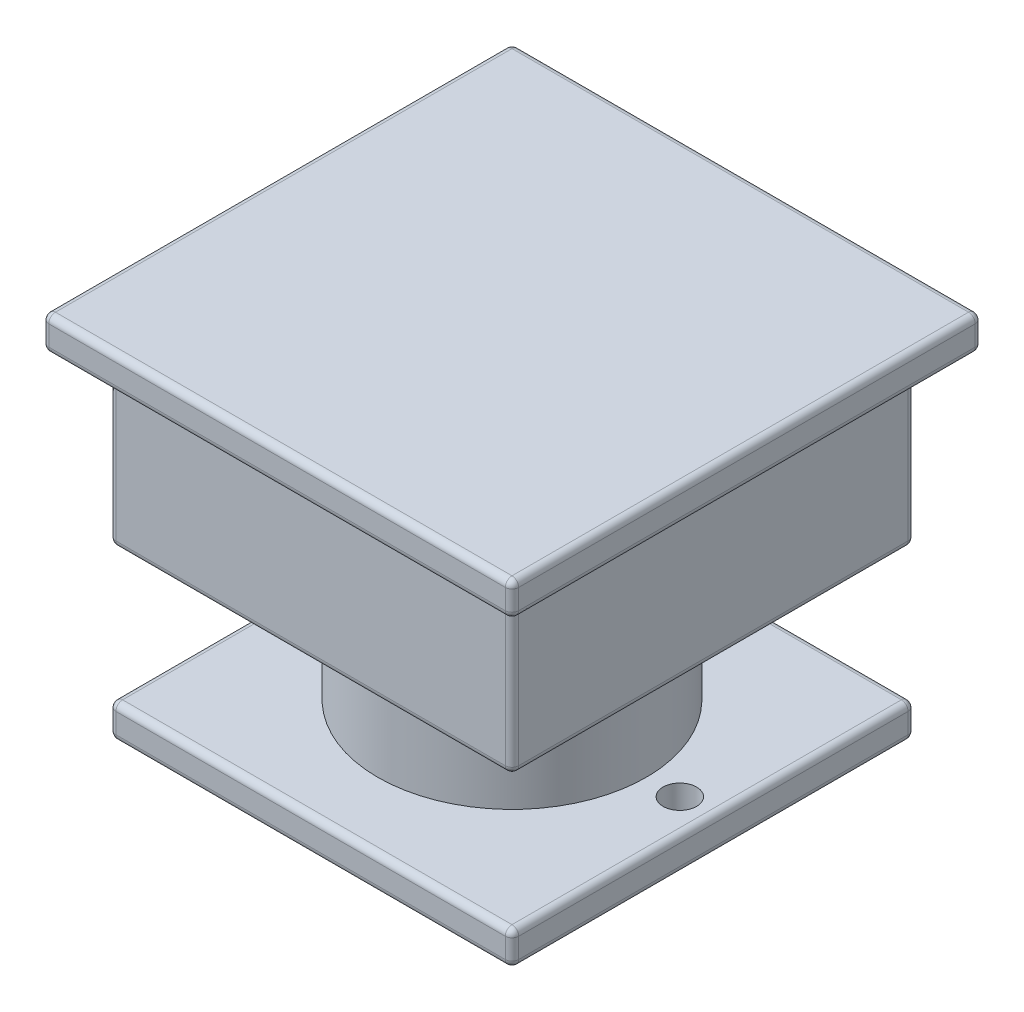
ISO-10303-21;
HEADER;
FILE_DESCRIPTION(('STEP AP214'),'2;1');
FILE_NAME('part.step','',(''),(''),'','','');
FILE_SCHEMA(('AUTOMOTIVE_DESIGN { 1 0 10303 214 1 1 1 1 }'));
ENDSEC;
DATA;
#1=APPLICATION_CONTEXT('core data for automotive mechanical design processes');
#2=APPLICATION_PROTOCOL_DEFINITION('international standard','automotive_design',2000,#1);
#3=PRODUCT_CONTEXT('',#1,'mechanical');
#4=PRODUCT('Part','Part','',(#3));
#5=PRODUCT_RELATED_PRODUCT_CATEGORY('part','',(#4));
#6=PRODUCT_DEFINITION_FORMATION('','',#4);
#7=PRODUCT_DEFINITION_CONTEXT('part definition',#1,'design');
#8=PRODUCT_DEFINITION('design','',#6,#7);
#9=PRODUCT_DEFINITION_SHAPE('','',#8);
#10=(LENGTH_UNIT() NAMED_UNIT(*) SI_UNIT(.MILLI.,.METRE.));
#11=(NAMED_UNIT(*) PLANE_ANGLE_UNIT() SI_UNIT($,.RADIAN.));
#12=(NAMED_UNIT(*) SI_UNIT($,.STERADIAN.) SOLID_ANGLE_UNIT());
#13=UNCERTAINTY_MEASURE_WITH_UNIT(LENGTH_MEASURE(1.E-05),#10,'distance_accuracy_value','');
#14=(GEOMETRIC_REPRESENTATION_CONTEXT(3) GLOBAL_UNCERTAINTY_ASSIGNED_CONTEXT((#13)) GLOBAL_UNIT_ASSIGNED_CONTEXT((#10,
#11,#12)) REPRESENTATION_CONTEXT('',''));
#15=CARTESIAN_POINT('',(0.,0.,0.));
#16=DIRECTION('',(0.,0.,1.));
#17=DIRECTION('',(1.,0.,0.));
#18=AXIS2_PLACEMENT_3D('',#15,#16,#17);
#19=CARTESIAN_POINT('',(0.,30.,0.));
#20=DIRECTION('',(0.,-1.,0.));
#21=DIRECTION('',(0.,0.,-1.));
#22=AXIS2_PLACEMENT_3D('',#19,#20,#21);
#23=CYLINDRICAL_SURFACE('',#22,20.);
#24=CARTESIAN_POINT('',(0.,5.,0.));
#25=DIRECTION('',(0.,1.,0.));
#26=DIRECTION('',(0.,0.,1.));
#27=AXIS2_PLACEMENT_3D('',#24,#25,#26);
#28=CIRCLE('',#27,20.);
#29=CARTESIAN_POINT('',(0.,5.,20.));
#30=VERTEX_POINT('',#29);
#31=EDGE_CURVE('E906',#30,#30,#28,.T.);
#32=ORIENTED_EDGE('',*,*,#31,.T.);
#33=EDGE_LOOP('',(#32));
#34=FACE_BOUND('',#33,.T.);
#35=CARTESIAN_POINT('',(0.,25.,0.));
#36=DIRECTION('',(0.,1.,0.));
#37=DIRECTION('',(0.,0.,1.));
#38=AXIS2_PLACEMENT_3D('',#35,#36,#37);
#39=CIRCLE('',#38,20.);
#40=CARTESIAN_POINT('',(0.,25.,20.));
#41=VERTEX_POINT('',#40);
#42=EDGE_CURVE('E903',#41,#41,#39,.T.);
#43=ORIENTED_EDGE('',*,*,#42,.F.);
#44=EDGE_LOOP('',(#43));
#45=FACE_BOUND('',#44,.T.);
#46=ADVANCED_FACE('F36',(#34,#45),#23,.T.);
#47=CARTESIAN_POINT('',(30.,5.,-30.));
#48=DIRECTION('',(-1.,0.,0.));
#49=DIRECTION('',(0.,0.,1.));
#50=AXIS2_PLACEMENT_3D('',#47,#48,#49);
#51=PLANE('',#50);
#52=DIRECTION('',(0.,0.,-1.));
#53=VECTOR('',#52,1.);
#54=CARTESIAN_POINT('',(30.,4.,30.));
#55=LINE('',#54,#53);
#56=CARTESIAN_POINT('',(30.,4.,-29.));
#57=VERTEX_POINT('',#56);
#58=CARTESIAN_POINT('',(30.,4.,29.));
#59=VERTEX_POINT('',#58);
#60=EDGE_CURVE('E354',#57,#59,#55,.F.);
#61=ORIENTED_EDGE('',*,*,#60,.T.);
#62=DIRECTION('',(0.,-1.,0.));
#63=VECTOR('',#62,1.);
#64=CARTESIAN_POINT('',(30.,5.,29.));
#65=LINE('',#64,#63);
#66=CARTESIAN_POINT('',(30.,1.,29.));
#67=VERTEX_POINT('',#66);
#68=EDGE_CURVE('E356',#59,#67,#65,.T.);
#69=ORIENTED_EDGE('',*,*,#68,.T.);
#70=DIRECTION('',(0.,0.,-1.));
#71=VECTOR('',#70,1.);
#72=CARTESIAN_POINT('',(30.,1.,-30.));
#73=LINE('',#72,#71);
#74=CARTESIAN_POINT('',(30.,1.,-29.));
#75=VERTEX_POINT('',#74);
#76=EDGE_CURVE('E350',#67,#75,#73,.T.);
#77=ORIENTED_EDGE('',*,*,#76,.T.);
#78=DIRECTION('',(0.,-1.,0.));
#79=VECTOR('',#78,1.);
#80=CARTESIAN_POINT('',(30.,5.,-29.));
#81=LINE('',#80,#79);
#82=EDGE_CURVE('E352',#75,#57,#81,.F.);
#83=ORIENTED_EDGE('',*,*,#82,.T.);
#84=EDGE_LOOP('',(#61,#69,#77,#83));
#85=FACE_BOUND('',#84,.T.);
#86=ADVANCED_FACE('F526',(#85),#51,.F.);
#87=CARTESIAN_POINT('',(-30.,5.,-30.));
#88=DIRECTION('',(0.,0.,1.));
#89=DIRECTION('',(1.,0.,0.));
#90=AXIS2_PLACEMENT_3D('',#87,#88,#89);
#91=PLANE('',#90);
#92=DIRECTION('',(-1.,0.,0.));
#93=VECTOR('',#92,1.);
#94=CARTESIAN_POINT('',(30.,4.,-30.));
#95=LINE('',#94,#93);
#96=CARTESIAN_POINT('',(-29.,4.,-30.));
#97=VERTEX_POINT('',#96);
#98=CARTESIAN_POINT('',(29.,4.,-30.));
#99=VERTEX_POINT('',#98);
#100=EDGE_CURVE('E327',#97,#99,#95,.F.);
#101=ORIENTED_EDGE('',*,*,#100,.T.);
#102=DIRECTION('',(0.,-1.,0.));
#103=VECTOR('',#102,1.);
#104=CARTESIAN_POINT('',(29.,5.,-30.));
#105=LINE('',#104,#103);
#106=CARTESIAN_POINT('',(29.,1.,-30.));
#107=VERTEX_POINT('',#106);
#108=EDGE_CURVE('E330',#99,#107,#105,.T.);
#109=ORIENTED_EDGE('',*,*,#108,.T.);
#110=DIRECTION('',(-1.,0.,0.));
#111=VECTOR('',#110,1.);
#112=CARTESIAN_POINT('',(-30.,1.,-30.));
#113=LINE('',#112,#111);
#114=CARTESIAN_POINT('',(-29.,1.,-30.));
#115=VERTEX_POINT('',#114);
#116=EDGE_CURVE('E325',#107,#115,#113,.T.);
#117=ORIENTED_EDGE('',*,*,#116,.T.);
#118=DIRECTION('',(0.,-1.,0.));
#119=VECTOR('',#118,1.);
#120=CARTESIAN_POINT('',(-29.,5.,-30.));
#121=LINE('',#120,#119);
#122=EDGE_CURVE('E323',#115,#97,#121,.F.);
#123=ORIENTED_EDGE('',*,*,#122,.T.);
#124=EDGE_LOOP('',(#101,#109,#117,#123));
#125=FACE_BOUND('',#124,.T.);
#126=ADVANCED_FACE('F618',(#125),#91,.F.);
#127=CARTESIAN_POINT('',(-30.,5.,-30.));
#128=DIRECTION('',(1.,0.,0.));
#129=DIRECTION('',(0.,0.,-1.));
#130=AXIS2_PLACEMENT_3D('',#127,#128,#129);
#131=PLANE('',#130);
#132=DIRECTION('',(0.,0.,1.));
#133=VECTOR('',#132,1.);
#134=CARTESIAN_POINT('',(-30.,4.,-30.));
#135=LINE('',#134,#133);
#136=CARTESIAN_POINT('',(-30.,4.,29.));
#137=VERTEX_POINT('',#136);
#138=CARTESIAN_POINT('',(-30.,4.,-29.));
#139=VERTEX_POINT('',#138);
#140=EDGE_CURVE('E363',#137,#139,#135,.F.);
#141=ORIENTED_EDGE('',*,*,#140,.T.);
#142=DIRECTION('',(0.,-1.,0.));
#143=VECTOR('',#142,1.);
#144=CARTESIAN_POINT('',(-30.,5.,-29.));
#145=LINE('',#144,#143);
#146=CARTESIAN_POINT('',(-30.,1.,-29.));
#147=VERTEX_POINT('',#146);
#148=EDGE_CURVE('E365',#139,#147,#145,.T.);
#149=ORIENTED_EDGE('',*,*,#148,.T.);
#150=DIRECTION('',(0.,0.,1.));
#151=VECTOR('',#150,1.);
#152=CARTESIAN_POINT('',(-30.,1.,-30.));
#153=LINE('',#152,#151);
#154=CARTESIAN_POINT('',(-30.,1.,29.));
#155=VERTEX_POINT('',#154);
#156=EDGE_CURVE('E359',#147,#155,#153,.T.);
#157=ORIENTED_EDGE('',*,*,#156,.T.);
#158=DIRECTION('',(0.,-1.,0.));
#159=VECTOR('',#158,1.);
#160=CARTESIAN_POINT('',(-30.,5.,29.));
#161=LINE('',#160,#159);
#162=EDGE_CURVE('E361',#155,#137,#161,.F.);
#163=ORIENTED_EDGE('',*,*,#162,.T.);
#164=EDGE_LOOP('',(#141,#149,#157,#163));
#165=FACE_BOUND('',#164,.T.);
#166=ADVANCED_FACE('F597',(#165),#131,.F.);
#167=CARTESIAN_POINT('',(-30.,5.,30.));
#168=DIRECTION('',(0.,0.,-1.));
#169=DIRECTION('',(-1.,0.,0.));
#170=AXIS2_PLACEMENT_3D('',#167,#168,#169);
#171=PLANE('',#170);
#172=DIRECTION('',(1.,0.,0.));
#173=VECTOR('',#172,1.);
#174=CARTESIAN_POINT('',(-30.,1.,30.));
#175=LINE('',#174,#173);
#176=CARTESIAN_POINT('',(-29.,1.,30.));
#177=VERTEX_POINT('',#176);
#178=CARTESIAN_POINT('',(29.,1.,30.));
#179=VERTEX_POINT('',#178);
#180=EDGE_CURVE('E343',#177,#179,#175,.T.);
#181=ORIENTED_EDGE('',*,*,#180,.T.);
#182=DIRECTION('',(0.,-1.,0.));
#183=VECTOR('',#182,1.);
#184=CARTESIAN_POINT('',(29.,5.,30.));
#185=LINE('',#184,#183);
#186=CARTESIAN_POINT('',(29.,4.,30.));
#187=VERTEX_POINT('',#186);
#188=EDGE_CURVE('E348',#179,#187,#185,.F.);
#189=ORIENTED_EDGE('',*,*,#188,.T.);
#190=DIRECTION('',(1.,0.,0.));
#191=VECTOR('',#190,1.);
#192=CARTESIAN_POINT('',(-30.,4.,30.));
#193=LINE('',#192,#191);
#194=CARTESIAN_POINT('',(-29.,4.,30.));
#195=VERTEX_POINT('',#194);
#196=EDGE_CURVE('E345',#187,#195,#193,.F.);
#197=ORIENTED_EDGE('',*,*,#196,.T.);
#198=DIRECTION('',(0.,-1.,0.));
#199=VECTOR('',#198,1.);
#200=CARTESIAN_POINT('',(-29.,5.,30.));
#201=LINE('',#200,#199);
#202=EDGE_CURVE('E341',#195,#177,#201,.T.);
#203=ORIENTED_EDGE('',*,*,#202,.T.);
#204=EDGE_LOOP('',(#181,#189,#197,#203));
#205=FACE_BOUND('',#204,.T.);
#206=ADVANCED_FACE('F555',(#205),#171,.F.);
#207=CARTESIAN_POINT('',(0.,5.,0.));
#208=DIRECTION('',(0.,1.,0.));
#209=DIRECTION('',(0.,0.,1.));
#210=AXIS2_PLACEMENT_3D('',#207,#208,#209);
#211=PLANE('',#210);
#212=CARTESIAN_POINT('',(-25.,5.,0.));
#213=DIRECTION('',(0.,1.,0.));
#214=DIRECTION('',(0.,0.,1.));
#215=AXIS2_PLACEMENT_3D('',#212,#213,#214);
#216=CIRCLE('',#215,2.5);
#217=CARTESIAN_POINT('',(-25.,4.99999999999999,-2.5));
#218=VERTEX_POINT('',#217);
#219=EDGE_CURVE('E1741',#218,#218,#216,.F.);
#220=ORIENTED_EDGE('',*,*,#219,.T.);
#221=EDGE_LOOP('',(#220));
#222=FACE_BOUND('',#221,.T.);
#223=CARTESIAN_POINT('',(25.,5.,0.));
#224=DIRECTION('',(0.,1.,0.));
#225=DIRECTION('',(0.,0.,1.));
#226=AXIS2_PLACEMENT_3D('',#223,#224,#225);
#227=CIRCLE('',#226,2.5);
#228=CARTESIAN_POINT('',(25.,4.99999999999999,-2.5));
#229=VERTEX_POINT('',#228);
#230=EDGE_CURVE('E1736',#229,#229,#227,.F.);
#231=ORIENTED_EDGE('',*,*,#230,.T.);
#232=EDGE_LOOP('',(#231));
#233=FACE_BOUND('',#232,.T.);
#234=DIRECTION('',(1.,0.,0.));
#235=VECTOR('',#234,1.);
#236=CARTESIAN_POINT('',(30.,5.,29.));
#237=LINE('',#236,#235);
#238=CARTESIAN_POINT('',(-29.,5.,29.));
#239=VERTEX_POINT('',#238);
#240=CARTESIAN_POINT('',(29.,5.,29.));
#241=VERTEX_POINT('',#240);
#242=EDGE_CURVE('E316',#239,#241,#237,.T.);
#243=ORIENTED_EDGE('',*,*,#242,.T.);
#244=DIRECTION('',(0.,0.,-1.));
#245=VECTOR('',#244,1.);
#246=CARTESIAN_POINT('',(29.,5.,-30.));
#247=LINE('',#246,#245);
#248=CARTESIAN_POINT('',(29.,5.,-29.));
#249=VERTEX_POINT('',#248);
#250=EDGE_CURVE('E321',#241,#249,#247,.T.);
#251=ORIENTED_EDGE('',*,*,#250,.T.);
#252=DIRECTION('',(-1.,0.,0.));
#253=VECTOR('',#252,1.);
#254=CARTESIAN_POINT('',(-30.,5.,-29.));
#255=LINE('',#254,#253);
#256=CARTESIAN_POINT('',(-29.,5.,-29.));
#257=VERTEX_POINT('',#256);
#258=EDGE_CURVE('E318',#249,#257,#255,.T.);
#259=ORIENTED_EDGE('',*,*,#258,.T.);
#260=DIRECTION('',(0.,0.,1.));
#261=VECTOR('',#260,1.);
#262=CARTESIAN_POINT('',(-29.,5.,30.));
#263=LINE('',#262,#261);
#264=EDGE_CURVE('E314',#257,#239,#263,.T.);
#265=ORIENTED_EDGE('',*,*,#264,.T.);
#266=EDGE_LOOP('',(#243,#251,#259,#265));
#267=FACE_BOUND('',#266,.T.);
#268=ORIENTED_EDGE('',*,*,#31,.F.);
#269=EDGE_LOOP('',(#268));
#270=FACE_BOUND('',#269,.T.);
#271=ADVANCED_FACE('F544',(#222,#233,#267,#270),#211,.T.);
#272=CARTESIAN_POINT('',(0.,0.,0.));
#273=DIRECTION('',(0.,1.,0.));
#274=DIRECTION('',(0.,0.,1.));
#275=AXIS2_PLACEMENT_3D('',#272,#273,#274);
#276=PLANE('',#275);
#277=CARTESIAN_POINT('',(25.,0.,15.));
#278=DIRECTION('',(0.,-1.,0.));
#279=DIRECTION('',(0.,0.,-1.));
#280=AXIS2_PLACEMENT_3D('',#277,#278,#279);
#281=CIRCLE('',#280,2.);
#282=CARTESIAN_POINT('',(25.,0.,13.));
#283=VERTEX_POINT('',#282);
#284=EDGE_CURVE('E1724',#283,#283,#281,.T.);
#285=ORIENTED_EDGE('',*,*,#284,.F.);
#286=EDGE_LOOP('',(#285));
#287=FACE_BOUND('',#286,.T.);
#288=CARTESIAN_POINT('',(13.,0.,15.));
#289=DIRECTION('',(0.,-1.,0.));
#290=DIRECTION('',(0.,0.,-1.));
#291=AXIS2_PLACEMENT_3D('',#288,#289,#290);
#292=CIRCLE('',#291,2.);
#293=CARTESIAN_POINT('',(13.,0.,13.));
#294=VERTEX_POINT('',#293);
#295=EDGE_CURVE('E1723',#294,#294,#292,.T.);
#296=ORIENTED_EDGE('',*,*,#295,.F.);
#297=EDGE_LOOP('',(#296));
#298=FACE_BOUND('',#297,.T.);
#299=CARTESIAN_POINT('',(13.,0.,25.));
#300=DIRECTION('',(0.,-1.,0.));
#301=DIRECTION('',(0.,0.,-1.));
#302=AXIS2_PLACEMENT_3D('',#299,#300,#301);
#303=CIRCLE('',#302,2.);
#304=CARTESIAN_POINT('',(13.,0.,23.));
#305=VERTEX_POINT('',#304);
#306=EDGE_CURVE('E1763',#305,#305,#303,.T.);
#307=ORIENTED_EDGE('',*,*,#306,.F.);
#308=EDGE_LOOP('',(#307));
#309=FACE_BOUND('',#308,.T.);
#310=CARTESIAN_POINT('',(25.,0.,25.));
#311=DIRECTION('',(0.,-1.,0.));
#312=DIRECTION('',(0.,0.,-1.));
#313=AXIS2_PLACEMENT_3D('',#310,#311,#312);
#314=CIRCLE('',#313,2.);
#315=CARTESIAN_POINT('',(25.,0.,23.));
#316=VERTEX_POINT('',#315);
#317=EDGE_CURVE('E1737',#316,#316,#314,.T.);
#318=ORIENTED_EDGE('',*,*,#317,.F.);
#319=EDGE_LOOP('',(#318));
#320=FACE_BOUND('',#319,.T.);
#321=CARTESIAN_POINT('',(-25.,0.,0.));
#322=DIRECTION('',(0.,-1.,0.));
#323=DIRECTION('',(0.,0.,-1.));
#324=AXIS2_PLACEMENT_3D('',#321,#322,#323);
#325=CIRCLE('',#324,2.5);
#326=CARTESIAN_POINT('',(-25.,0.,-2.5));
#327=VERTEX_POINT('',#326);
#328=EDGE_CURVE('E446',#327,#327,#325,.T.);
#329=ORIENTED_EDGE('',*,*,#328,.F.);
#330=EDGE_LOOP('',(#329));
#331=FACE_BOUND('',#330,.T.);
#332=CARTESIAN_POINT('',(25.,0.,0.));
#333=DIRECTION('',(0.,-1.,0.));
#334=DIRECTION('',(0.,0.,-1.));
#335=AXIS2_PLACEMENT_3D('',#332,#333,#334);
#336=CIRCLE('',#335,2.5);
#337=CARTESIAN_POINT('',(25.,0.,-2.5));
#338=VERTEX_POINT('',#337);
#339=EDGE_CURVE('E1744',#338,#338,#336,.T.);
#340=ORIENTED_EDGE('',*,*,#339,.F.);
#341=EDGE_LOOP('',(#340));
#342=FACE_BOUND('',#341,.T.);
#343=DIRECTION('',(-1.,0.,0.));
#344=VECTOR('',#343,1.);
#345=CARTESIAN_POINT('',(0.,0.,-29.));
#346=LINE('',#345,#344);
#347=CARTESIAN_POINT('',(-29.,0.,-29.));
#348=VERTEX_POINT('',#347);
#349=CARTESIAN_POINT('',(29.,0.,-29.));
#350=VERTEX_POINT('',#349);
#351=EDGE_CURVE('E336',#348,#350,#346,.F.);
#352=ORIENTED_EDGE('',*,*,#351,.T.);
#353=DIRECTION('',(0.,0.,-1.));
#354=VECTOR('',#353,1.);
#355=CARTESIAN_POINT('',(29.,0.,0.));
#356=LINE('',#355,#354);
#357=CARTESIAN_POINT('',(29.,0.,29.));
#358=VERTEX_POINT('',#357);
#359=EDGE_CURVE('E339',#350,#358,#356,.F.);
#360=ORIENTED_EDGE('',*,*,#359,.T.);
#361=DIRECTION('',(1.,0.,0.));
#362=VECTOR('',#361,1.);
#363=CARTESIAN_POINT('',(0.,0.,29.));
#364=LINE('',#363,#362);
#365=CARTESIAN_POINT('',(-29.,0.,29.));
#366=VERTEX_POINT('',#365);
#367=EDGE_CURVE('E334',#358,#366,#364,.F.);
#368=ORIENTED_EDGE('',*,*,#367,.T.);
#369=DIRECTION('',(0.,0.,1.));
#370=VECTOR('',#369,1.);
#371=CARTESIAN_POINT('',(-29.,0.,0.));
#372=LINE('',#371,#370);
#373=EDGE_CURVE('E332',#366,#348,#372,.F.);
#374=ORIENTED_EDGE('',*,*,#373,.T.);
#375=EDGE_LOOP('',(#352,#360,#368,#374));
#376=FACE_BOUND('',#375,.T.);
#377=ADVANCED_FACE('F565',(#287,#298,#309,#320,#331,#342,#376),#276,.F.);
#378=CARTESIAN_POINT('',(30.,25.,-30.));
#379=DIRECTION('',(-1.,0.,0.));
#380=DIRECTION('',(0.,0.,1.));
#381=AXIS2_PLACEMENT_3D('',#378,#379,#380);
#382=PLANE('',#381);
#383=DIRECTION('',(0.,0.,1.));
#384=VECTOR('',#383,1.);
#385=CARTESIAN_POINT('',(30.,49.,30.));
#386=LINE('',#385,#384);
#387=CARTESIAN_POINT('',(30.,49.,-29.));
#388=VERTEX_POINT('',#387);
#389=CARTESIAN_POINT('',(30.,49.,29.));
#390=VERTEX_POINT('',#389);
#391=EDGE_CURVE('E685',#388,#390,#386,.T.);
#392=ORIENTED_EDGE('',*,*,#391,.T.);
#393=DIRECTION('',(0.,1.,0.));
#394=VECTOR('',#393,1.);
#395=CARTESIAN_POINT('',(30.,25.,29.));
#396=LINE('',#395,#394);
#397=CARTESIAN_POINT('',(30.,26.,29.));
#398=VERTEX_POINT('',#397);
#399=EDGE_CURVE('E676',#390,#398,#396,.F.);
#400=ORIENTED_EDGE('',*,*,#399,.T.);
#401=DIRECTION('',(0.,0.,1.));
#402=VECTOR('',#401,1.);
#403=CARTESIAN_POINT('',(30.,26.,-30.));
#404=LINE('',#403,#402);
#405=CARTESIAN_POINT('',(30.,26.,-29.));
#406=VERTEX_POINT('',#405);
#407=EDGE_CURVE('E760',#398,#406,#404,.F.);
#408=ORIENTED_EDGE('',*,*,#407,.T.);
#409=DIRECTION('',(0.,1.,0.));
#410=VECTOR('',#409,1.);
#411=CARTESIAN_POINT('',(30.,25.,-29.));
#412=LINE('',#411,#410);
#413=EDGE_CURVE('E758',#406,#388,#412,.T.);
#414=ORIENTED_EDGE('',*,*,#413,.T.);
#415=EDGE_LOOP('',(#392,#400,#408,#414));
#416=FACE_BOUND('',#415,.T.);
#417=ADVANCED_FACE('F624',(#416),#382,.F.);
#418=CARTESIAN_POINT('',(-30.,25.,30.));
#419=DIRECTION('',(0.,0.,-1.));
#420=DIRECTION('',(-1.,0.,0.));
#421=AXIS2_PLACEMENT_3D('',#418,#419,#420);
#422=PLANE('',#421);
#423=DIRECTION('',(-1.,0.,0.));
#424=VECTOR('',#423,1.);
#425=CARTESIAN_POINT('',(-30.,26.,30.));
#426=LINE('',#425,#424);
#427=CARTESIAN_POINT('',(-29.,26.,30.));
#428=VERTEX_POINT('',#427);
#429=CARTESIAN_POINT('',(29.,26.,30.));
#430=VERTEX_POINT('',#429);
#431=EDGE_CURVE('E754',#428,#430,#426,.F.);
#432=ORIENTED_EDGE('',*,*,#431,.T.);
#433=DIRECTION('',(0.,1.,0.));
#434=VECTOR('',#433,1.);
#435=CARTESIAN_POINT('',(29.,25.,30.));
#436=LINE('',#435,#434);
#437=CARTESIAN_POINT('',(29.,49.,30.));
#438=VERTEX_POINT('',#437);
#439=EDGE_CURVE('E756',#430,#438,#436,.T.);
#440=ORIENTED_EDGE('',*,*,#439,.T.);
#441=DIRECTION('',(-1.,0.,0.));
#442=VECTOR('',#441,1.);
#443=CARTESIAN_POINT('',(-30.,49.,30.));
#444=LINE('',#443,#442);
#445=CARTESIAN_POINT('',(-29.,49.,30.));
#446=VERTEX_POINT('',#445);
#447=EDGE_CURVE('E686',#438,#446,#444,.T.);
#448=ORIENTED_EDGE('',*,*,#447,.T.);
#449=DIRECTION('',(0.,1.,0.));
#450=VECTOR('',#449,1.);
#451=CARTESIAN_POINT('',(-29.,25.,30.));
#452=LINE('',#451,#450);
#453=EDGE_CURVE('E752',#446,#428,#452,.F.);
#454=ORIENTED_EDGE('',*,*,#453,.T.);
#455=EDGE_LOOP('',(#432,#440,#448,#454));
#456=FACE_BOUND('',#455,.T.);
#457=ADVANCED_FACE('F1044',(#456),#422,.F.);
#458=CARTESIAN_POINT('',(-30.,25.,-30.));
#459=DIRECTION('',(1.,0.,0.));
#460=DIRECTION('',(0.,0.,-1.));
#461=AXIS2_PLACEMENT_3D('',#458,#459,#460);
#462=PLANE('',#461);
#463=DIRECTION('',(0.,0.,-1.));
#464=VECTOR('',#463,1.);
#465=CARTESIAN_POINT('',(-30.,49.,-30.));
#466=LINE('',#465,#464);
#467=CARTESIAN_POINT('',(-30.,49.,29.));
#468=VERTEX_POINT('',#467);
#469=CARTESIAN_POINT('',(-30.,49.,-29.));
#470=VERTEX_POINT('',#469);
#471=EDGE_CURVE('E301',#468,#470,#466,.T.);
#472=ORIENTED_EDGE('',*,*,#471,.T.);
#473=DIRECTION('',(0.,1.,0.));
#474=VECTOR('',#473,1.);
#475=CARTESIAN_POINT('',(-30.,25.,-29.));
#476=LINE('',#475,#474);
#477=CARTESIAN_POINT('',(-30.,26.,-29.));
#478=VERTEX_POINT('',#477);
#479=EDGE_CURVE('E750',#470,#478,#476,.F.);
#480=ORIENTED_EDGE('',*,*,#479,.T.);
#481=DIRECTION('',(0.,0.,-1.));
#482=VECTOR('',#481,1.);
#483=CARTESIAN_POINT('',(-30.,26.,-30.));
#484=LINE('',#483,#482);
#485=CARTESIAN_POINT('',(-30.,26.,29.));
#486=VERTEX_POINT('',#485);
#487=EDGE_CURVE('E748',#478,#486,#484,.F.);
#488=ORIENTED_EDGE('',*,*,#487,.T.);
#489=DIRECTION('',(0.,1.,0.));
#490=VECTOR('',#489,1.);
#491=CARTESIAN_POINT('',(-30.,25.,29.));
#492=LINE('',#491,#490);
#493=EDGE_CURVE('E746',#486,#468,#492,.T.);
#494=ORIENTED_EDGE('',*,*,#493,.T.);
#495=EDGE_LOOP('',(#472,#480,#488,#494));
#496=FACE_BOUND('',#495,.T.);
#497=ADVANCED_FACE('F901',(#496),#462,.F.);
#498=CARTESIAN_POINT('',(-30.,25.,-30.));
#499=DIRECTION('',(0.,0.,1.));
#500=DIRECTION('',(1.,0.,0.));
#501=AXIS2_PLACEMENT_3D('',#498,#499,#500);
#502=PLANE('',#501);
#503=DIRECTION('',(1.,0.,0.));
#504=VECTOR('',#503,1.);
#505=CARTESIAN_POINT('',(30.,49.,-30.));
#506=LINE('',#505,#504);
#507=CARTESIAN_POINT('',(-29.,49.,-30.));
#508=VERTEX_POINT('',#507);
#509=CARTESIAN_POINT('',(29.,49.,-30.));
#510=VERTEX_POINT('',#509);
#511=EDGE_CURVE('E701',#508,#510,#506,.T.);
#512=ORIENTED_EDGE('',*,*,#511,.T.);
#513=DIRECTION('',(0.,1.,0.));
#514=VECTOR('',#513,1.);
#515=CARTESIAN_POINT('',(29.,25.,-30.));
#516=LINE('',#515,#514);
#517=CARTESIAN_POINT('',(29.,26.,-30.));
#518=VERTEX_POINT('',#517);
#519=EDGE_CURVE('E744',#510,#518,#516,.F.);
#520=ORIENTED_EDGE('',*,*,#519,.T.);
#521=DIRECTION('',(1.,0.,0.));
#522=VECTOR('',#521,1.);
#523=CARTESIAN_POINT('',(-30.,26.,-30.));
#524=LINE('',#523,#522);
#525=CARTESIAN_POINT('',(-29.,26.,-30.));
#526=VERTEX_POINT('',#525);
#527=EDGE_CURVE('E742',#518,#526,#524,.F.);
#528=ORIENTED_EDGE('',*,*,#527,.T.);
#529=DIRECTION('',(0.,1.,0.));
#530=VECTOR('',#529,1.);
#531=CARTESIAN_POINT('',(-29.,25.,-30.));
#532=LINE('',#531,#530);
#533=EDGE_CURVE('E740',#526,#508,#532,.T.);
#534=ORIENTED_EDGE('',*,*,#533,.T.);
#535=EDGE_LOOP('',(#512,#520,#528,#534));
#536=FACE_BOUND('',#535,.T.);
#537=ADVANCED_FACE('F887',(#536),#502,.F.);
#538=CARTESIAN_POINT('',(0.,25.,0.));
#539=DIRECTION('',(0.,1.,0.));
#540=DIRECTION('',(0.,0.,1.));
#541=AXIS2_PLACEMENT_3D('',#538,#539,#540);
#542=PLANE('',#541);
#543=DIRECTION('',(0.,0.,-1.));
#544=VECTOR('',#543,1.);
#545=CARTESIAN_POINT('',(-29.,25.,0.));
#546=LINE('',#545,#544);
#547=CARTESIAN_POINT('',(-29.,25.,29.));
#548=VERTEX_POINT('',#547);
#549=CARTESIAN_POINT('',(-29.,25.,-29.));
#550=VERTEX_POINT('',#549);
#551=EDGE_CURVE('E735',#548,#550,#546,.T.);
#552=ORIENTED_EDGE('',*,*,#551,.T.);
#553=DIRECTION('',(1.,0.,0.));
#554=VECTOR('',#553,1.);
#555=CARTESIAN_POINT('',(0.,25.,-29.));
#556=LINE('',#555,#554);
#557=CARTESIAN_POINT('',(29.,25.,-29.));
#558=VERTEX_POINT('',#557);
#559=EDGE_CURVE('E737',#550,#558,#556,.T.);
#560=ORIENTED_EDGE('',*,*,#559,.T.);
#561=DIRECTION('',(0.,0.,1.));
#562=VECTOR('',#561,1.);
#563=CARTESIAN_POINT('',(29.,25.,0.));
#564=LINE('',#563,#562);
#565=CARTESIAN_POINT('',(29.,25.,29.));
#566=VERTEX_POINT('',#565);
#567=EDGE_CURVE('E731',#558,#566,#564,.T.);
#568=ORIENTED_EDGE('',*,*,#567,.T.);
#569=DIRECTION('',(-1.,0.,0.));
#570=VECTOR('',#569,1.);
#571=CARTESIAN_POINT('',(0.,25.,29.));
#572=LINE('',#571,#570);
#573=EDGE_CURVE('E733',#566,#548,#572,.T.);
#574=ORIENTED_EDGE('',*,*,#573,.T.);
#575=EDGE_LOOP('',(#552,#560,#568,#574));
#576=FACE_BOUND('',#575,.T.);
#577=ORIENTED_EDGE('',*,*,#42,.T.);
#578=EDGE_LOOP('',(#577));
#579=FACE_BOUND('',#578,.T.);
#580=ADVANCED_FACE('F868',(#576,#579),#542,.F.);
#581=CARTESIAN_POINT('',(35.,50.,-35.));
#582=DIRECTION('',(1.,0.,0.));
#583=DIRECTION('',(0.,0.,-1.));
#584=AXIS2_PLACEMENT_3D('',#581,#582,#583);
#585=PLANE('',#584);
#586=DIRECTION('',(0.,0.,-1.));
#587=VECTOR('',#586,1.);
#588=CARTESIAN_POINT('',(35.,51.,-35.));
#589=LINE('',#588,#587);
#590=CARTESIAN_POINT('',(35.,51.,34.));
#591=VERTEX_POINT('',#590);
#592=CARTESIAN_POINT('',(35.,51.,-34.));
#593=VERTEX_POINT('',#592);
#594=EDGE_CURVE('E275',#591,#593,#589,.T.);
#595=ORIENTED_EDGE('',*,*,#594,.T.);
#596=DIRECTION('',(0.,1.,0.));
#597=VECTOR('',#596,1.);
#598=CARTESIAN_POINT('',(35.,50.,-34.));
#599=LINE('',#598,#597);
#600=CARTESIAN_POINT('',(35.,54.,-34.));
#601=VERTEX_POINT('',#600);
#602=EDGE_CURVE('E372',#593,#601,#599,.T.);
#603=ORIENTED_EDGE('',*,*,#602,.T.);
#604=DIRECTION('',(0.,0.,-1.));
#605=VECTOR('',#604,1.);
#606=CARTESIAN_POINT('',(35.,54.,-35.));
#607=LINE('',#606,#605);
#608=CARTESIAN_POINT('',(35.,54.,34.));
#609=VERTEX_POINT('',#608);
#610=EDGE_CURVE('E370',#601,#609,#607,.F.);
#611=ORIENTED_EDGE('',*,*,#610,.T.);
#612=DIRECTION('',(0.,1.,0.));
#613=VECTOR('',#612,1.);
#614=CARTESIAN_POINT('',(35.,50.,34.));
#615=LINE('',#614,#613);
#616=EDGE_CURVE('E368',#609,#591,#615,.F.);
#617=ORIENTED_EDGE('',*,*,#616,.T.);
#618=EDGE_LOOP('',(#595,#603,#611,#617));
#619=FACE_BOUND('',#618,.T.);
#620=ADVANCED_FACE('F682',(#619),#585,.T.);
#621=CARTESIAN_POINT('',(-35.,50.,35.));
#622=DIRECTION('',(0.,0.,1.));
#623=DIRECTION('',(1.,0.,0.));
#624=AXIS2_PLACEMENT_3D('',#621,#622,#623);
#625=PLANE('',#624);
#626=DIRECTION('',(1.,0.,0.));
#627=VECTOR('',#626,1.);
#628=CARTESIAN_POINT('',(35.,51.,35.));
#629=LINE('',#628,#627);
#630=CARTESIAN_POINT('',(-34.,51.,35.));
#631=VERTEX_POINT('',#630);
#632=CARTESIAN_POINT('',(34.,51.,35.));
#633=VERTEX_POINT('',#632);
#634=EDGE_CURVE('E712',#631,#633,#629,.T.);
#635=ORIENTED_EDGE('',*,*,#634,.T.);
#636=DIRECTION('',(0.,1.,0.));
#637=VECTOR('',#636,1.);
#638=CARTESIAN_POINT('',(34.,50.,35.));
#639=LINE('',#638,#637);
#640=CARTESIAN_POINT('',(34.,54.,35.));
#641=VERTEX_POINT('',#640);
#642=EDGE_CURVE('E393',#633,#641,#639,.T.);
#643=ORIENTED_EDGE('',*,*,#642,.T.);
#644=DIRECTION('',(1.,0.,0.));
#645=VECTOR('',#644,1.);
#646=CARTESIAN_POINT('',(-35.,54.,35.));
#647=LINE('',#646,#645);
#648=CARTESIAN_POINT('',(-34.,54.,35.));
#649=VERTEX_POINT('',#648);
#650=EDGE_CURVE('E391',#641,#649,#647,.F.);
#651=ORIENTED_EDGE('',*,*,#650,.T.);
#652=DIRECTION('',(0.,1.,0.));
#653=VECTOR('',#652,1.);
#654=CARTESIAN_POINT('',(-34.,50.,35.));
#655=LINE('',#654,#653);
#656=EDGE_CURVE('E389',#649,#631,#655,.F.);
#657=ORIENTED_EDGE('',*,*,#656,.T.);
#658=EDGE_LOOP('',(#635,#643,#651,#657));
#659=FACE_BOUND('',#658,.T.);
#660=ADVANCED_FACE('F1011',(#659),#625,.T.);
#661=CARTESIAN_POINT('',(-35.,50.,-35.));
#662=DIRECTION('',(-1.,0.,0.));
#663=DIRECTION('',(0.,0.,1.));
#664=AXIS2_PLACEMENT_3D('',#661,#662,#663);
#665=PLANE('',#664);
#666=DIRECTION('',(0.,0.,1.));
#667=VECTOR('',#666,1.);
#668=CARTESIAN_POINT('',(-35.,51.,35.));
#669=LINE('',#668,#667);
#670=CARTESIAN_POINT('',(-35.,51.,-34.));
#671=VERTEX_POINT('',#670);
#672=CARTESIAN_POINT('',(-35.,51.,34.));
#673=VERTEX_POINT('',#672);
#674=EDGE_CURVE('E706',#671,#673,#669,.T.);
#675=ORIENTED_EDGE('',*,*,#674,.T.);
#676=DIRECTION('',(0.,1.,0.));
#677=VECTOR('',#676,1.);
#678=CARTESIAN_POINT('',(-35.,50.,34.));
#679=LINE('',#678,#677);
#680=CARTESIAN_POINT('',(-35.,54.,34.));
#681=VERTEX_POINT('',#680);
#682=EDGE_CURVE('E11',#673,#681,#679,.T.);
#683=ORIENTED_EDGE('',*,*,#682,.T.);
#684=DIRECTION('',(0.,0.,1.));
#685=VECTOR('',#684,1.);
#686=CARTESIAN_POINT('',(-35.,54.,-35.));
#687=LINE('',#686,#685);
#688=CARTESIAN_POINT('',(-35.,54.,-34.));
#689=VERTEX_POINT('',#688);
#690=EDGE_CURVE('E52',#681,#689,#687,.F.);
#691=ORIENTED_EDGE('',*,*,#690,.T.);
#692=DIRECTION('',(0.,1.,0.));
#693=VECTOR('',#692,1.);
#694=CARTESIAN_POINT('',(-35.,50.,-34.));
#695=LINE('',#694,#693);
#696=EDGE_CURVE('E45',#689,#671,#695,.F.);
#697=ORIENTED_EDGE('',*,*,#696,.T.);
#698=EDGE_LOOP('',(#675,#683,#691,#697));
#699=FACE_BOUND('',#698,.T.);
#700=ADVANCED_FACE('F923',(#699),#665,.T.);
#701=CARTESIAN_POINT('',(-35.,50.,-35.));
#702=DIRECTION('',(0.,0.,-1.));
#703=DIRECTION('',(-1.,0.,0.));
#704=AXIS2_PLACEMENT_3D('',#701,#702,#703);
#705=PLANE('',#704);
#706=DIRECTION('',(-1.,0.,0.));
#707=VECTOR('',#706,1.);
#708=CARTESIAN_POINT('',(-35.,54.,-35.));
#709=LINE('',#708,#707);
#710=CARTESIAN_POINT('',(-34.,54.,-35.));
#711=VERTEX_POINT('',#710);
#712=CARTESIAN_POINT('',(34.,54.,-35.));
#713=VERTEX_POINT('',#712);
#714=EDGE_CURVE('E374',#711,#713,#709,.F.);
#715=ORIENTED_EDGE('',*,*,#714,.T.);
#716=DIRECTION('',(0.,1.,0.));
#717=VECTOR('',#716,1.);
#718=CARTESIAN_POINT('',(34.,50.,-35.));
#719=LINE('',#718,#717);
#720=CARTESIAN_POINT('',(34.,51.,-35.));
#721=VERTEX_POINT('',#720);
#722=EDGE_CURVE('E378',#713,#721,#719,.F.);
#723=ORIENTED_EDGE('',*,*,#722,.T.);
#724=DIRECTION('',(-1.,0.,0.));
#725=VECTOR('',#724,1.);
#726=CARTESIAN_POINT('',(-35.,51.,-35.));
#727=LINE('',#726,#725);
#728=CARTESIAN_POINT('',(-34.,51.,-35.));
#729=VERTEX_POINT('',#728);
#730=EDGE_CURVE('E697',#721,#729,#727,.T.);
#731=ORIENTED_EDGE('',*,*,#730,.T.);
#732=DIRECTION('',(0.,1.,0.));
#733=VECTOR('',#732,1.);
#734=CARTESIAN_POINT('',(-34.,50.,-35.));
#735=LINE('',#734,#733);
#736=EDGE_CURVE('E376',#729,#711,#735,.T.);
#737=ORIENTED_EDGE('',*,*,#736,.T.);
#738=EDGE_LOOP('',(#715,#723,#731,#737));
#739=FACE_BOUND('',#738,.T.);
#740=ADVANCED_FACE('F995',(#739),#705,.T.);
#741=CARTESIAN_POINT('',(0.,50.,0.));
#742=DIRECTION('',(0.,1.,0.));
#743=DIRECTION('',(0.,0.,1.));
#744=AXIS2_PLACEMENT_3D('',#741,#742,#743);
#745=PLANE('',#744);
#746=DIRECTION('',(1.,0.,0.));
#747=VECTOR('',#746,1.);
#748=CARTESIAN_POINT('',(-30.,50.,-31.));
#749=LINE('',#748,#747);
#750=CARTESIAN_POINT('',(31.,50.,-31.));
#751=VERTEX_POINT('',#750);
#752=CARTESIAN_POINT('',(-31.,50.,-31.));
#753=VERTEX_POINT('',#752);
#754=EDGE_CURVE('E919',#751,#753,#749,.F.);
#755=ORIENTED_EDGE('',*,*,#754,.T.);
#756=DIRECTION('',(0.,0.,-1.));
#757=VECTOR('',#756,1.);
#758=CARTESIAN_POINT('',(-31.,50.,30.));
#759=LINE('',#758,#757);
#760=CARTESIAN_POINT('',(-31.,50.,31.));
#761=VERTEX_POINT('',#760);
#762=EDGE_CURVE('E899',#753,#761,#759,.F.);
#763=ORIENTED_EDGE('',*,*,#762,.T.);
#764=DIRECTION('',(-1.,0.,0.));
#765=VECTOR('',#764,1.);
#766=CARTESIAN_POINT('',(30.,50.,31.));
#767=LINE('',#766,#765);
#768=CARTESIAN_POINT('',(31.,50.,31.));
#769=VERTEX_POINT('',#768);
#770=EDGE_CURVE('E916',#761,#769,#767,.F.);
#771=ORIENTED_EDGE('',*,*,#770,.T.);
#772=DIRECTION('',(0.,0.,1.));
#773=VECTOR('',#772,1.);
#774=CARTESIAN_POINT('',(31.,50.,-30.));
#775=LINE('',#774,#773);
#776=EDGE_CURVE('E913',#769,#751,#775,.F.);
#777=ORIENTED_EDGE('',*,*,#776,.T.);
#778=EDGE_LOOP('',(#755,#763,#771,#777));
#779=FACE_BOUND('',#778,.T.);
#780=DIRECTION('',(1.,0.,0.));
#781=VECTOR('',#780,1.);
#782=CARTESIAN_POINT('',(-35.,50.,34.));
#783=LINE('',#782,#781);
#784=CARTESIAN_POINT('',(34.,50.,34.));
#785=VERTEX_POINT('',#784);
#786=CARTESIAN_POINT('',(-34.,50.,34.));
#787=VERTEX_POINT('',#786);
#788=EDGE_CURVE('E289',#785,#787,#783,.F.);
#789=ORIENTED_EDGE('',*,*,#788,.T.);
#790=DIRECTION('',(0.,0.,1.));
#791=VECTOR('',#790,1.);
#792=CARTESIAN_POINT('',(-34.,50.,-35.));
#793=LINE('',#792,#791);
#794=CARTESIAN_POINT('',(-34.,50.,-34.));
#795=VERTEX_POINT('',#794);
#796=EDGE_CURVE('E911',#787,#795,#793,.F.);
#797=ORIENTED_EDGE('',*,*,#796,.T.);
#798=DIRECTION('',(-1.,0.,0.));
#799=VECTOR('',#798,1.);
#800=CARTESIAN_POINT('',(35.,50.,-34.));
#801=LINE('',#800,#799);
#802=CARTESIAN_POINT('',(34.,50.,-34.));
#803=VERTEX_POINT('',#802);
#804=EDGE_CURVE('E292',#795,#803,#801,.F.);
#805=ORIENTED_EDGE('',*,*,#804,.T.);
#806=DIRECTION('',(0.,0.,-1.));
#807=VECTOR('',#806,1.);
#808=CARTESIAN_POINT('',(34.,50.,35.));
#809=LINE('',#808,#807);
#810=EDGE_CURVE('E273',#803,#785,#809,.F.);
#811=ORIENTED_EDGE('',*,*,#810,.T.);
#812=EDGE_LOOP('',(#789,#797,#805,#811));
#813=FACE_BOUND('',#812,.T.);
#814=ADVANCED_FACE('F287',(#779,#813),#745,.F.);
#815=CARTESIAN_POINT('',(0.,55.,0.));
#816=DIRECTION('',(0.,1.,0.));
#817=DIRECTION('',(0.,0.,1.));
#818=AXIS2_PLACEMENT_3D('',#815,#816,#817);
#819=PLANE('',#818);
#820=DIRECTION('',(1.,0.,0.));
#821=VECTOR('',#820,1.);
#822=CARTESIAN_POINT('',(0.,55.,34.));
#823=LINE('',#822,#821);
#824=CARTESIAN_POINT('',(-34.,55.,34.));
#825=VERTEX_POINT('',#824);
#826=CARTESIAN_POINT('',(34.,55.,34.));
#827=VERTEX_POINT('',#826);
#828=EDGE_CURVE('E384',#825,#827,#823,.T.);
#829=ORIENTED_EDGE('',*,*,#828,.T.);
#830=DIRECTION('',(0.,0.,-1.));
#831=VECTOR('',#830,1.);
#832=CARTESIAN_POINT('',(34.,55.,0.));
#833=LINE('',#832,#831);
#834=CARTESIAN_POINT('',(34.,55.,-34.));
#835=VERTEX_POINT('',#834);
#836=EDGE_CURVE('E386',#827,#835,#833,.T.);
#837=ORIENTED_EDGE('',*,*,#836,.T.);
#838=DIRECTION('',(-1.,0.,0.));
#839=VECTOR('',#838,1.);
#840=CARTESIAN_POINT('',(0.,55.,-34.));
#841=LINE('',#840,#839);
#842=CARTESIAN_POINT('',(-34.,55.,-34.));
#843=VERTEX_POINT('',#842);
#844=EDGE_CURVE('E380',#835,#843,#841,.T.);
#845=ORIENTED_EDGE('',*,*,#844,.T.);
#846=DIRECTION('',(0.,0.,1.));
#847=VECTOR('',#846,1.);
#848=CARTESIAN_POINT('',(-34.,55.,0.));
#849=LINE('',#848,#847);
#850=EDGE_CURVE('E382',#843,#825,#849,.T.);
#851=ORIENTED_EDGE('',*,*,#850,.T.);
#852=EDGE_LOOP('',(#829,#837,#845,#851));
#853=FACE_BOUND('',#852,.T.);
#854=ADVANCED_FACE('F788',(#853),#819,.T.);
#855=CARTESIAN_POINT('',(31.,49.,-30.));
#856=DIRECTION('',(0.,0.,-1.));
#857=DIRECTION('',(-1.,0.,0.));
#858=AXIS2_PLACEMENT_3D('',#855,#856,#857);
#859=CYLINDRICAL_SURFACE('',#858,1.);
#860=ORIENTED_EDGE('',*,*,#776,.F.);
#861=CARTESIAN_POINT('',(31.,49.,31.));
#862=DIRECTION('',(-0.894427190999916,0.,0.447213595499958));
#863=DIRECTION('',(0.447213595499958,0.,0.894427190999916));
#864=AXIS2_PLACEMENT_3D('',#861,#862,#863);
#865=ELLIPSE('',#864,2.23606797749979,1.);
#866=EDGE_CURVE('E721',#769,#390,#865,.T.);
#867=ORIENTED_EDGE('',*,*,#866,.T.);
#868=ORIENTED_EDGE('',*,*,#391,.F.);
#869=CARTESIAN_POINT('',(31.,49.,-31.));
#870=DIRECTION('',(0.894427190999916,0.,0.447213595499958));
#871=DIRECTION('',(-0.447213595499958,0.,0.894427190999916));
#872=AXIS2_PLACEMENT_3D('',#869,#870,#871);
#873=ELLIPSE('',#872,2.23606797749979,1.);
#874=EDGE_CURVE('E719',#388,#751,#873,.F.);
#875=ORIENTED_EDGE('',*,*,#874,.T.);
#876=EDGE_LOOP('',(#860,#867,#868,#875));
#877=FACE_BOUND('',#876,.T.);
#878=ADVANCED_FACE('F784',(#877),#859,.F.);
#879=CARTESIAN_POINT('',(-30.,49.,31.));
#880=DIRECTION('',(1.,0.,0.));
#881=DIRECTION('',(0.,0.,-1.));
#882=AXIS2_PLACEMENT_3D('',#879,#880,#881);
#883=CYLINDRICAL_SURFACE('',#882,1.);
#884=ORIENTED_EDGE('',*,*,#447,.F.);
#885=CARTESIAN_POINT('',(31.,49.,31.));
#886=DIRECTION('',(-0.447213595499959,0.,0.894427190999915));
#887=DIRECTION('',(0.894427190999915,0.,0.447213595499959));
#888=AXIS2_PLACEMENT_3D('',#885,#886,#887);
#889=ELLIPSE('',#888,2.23606797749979,1.);
#890=EDGE_CURVE('E716',#438,#769,#889,.F.);
#891=ORIENTED_EDGE('',*,*,#890,.T.);
#892=ORIENTED_EDGE('',*,*,#770,.F.);
#893=CARTESIAN_POINT('',(-31.,49.,31.));
#894=DIRECTION('',(-0.447213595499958,0.,-0.894427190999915));
#895=DIRECTION('',(-0.894427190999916,0.,0.447213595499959));
#896=AXIS2_PLACEMENT_3D('',#893,#894,#895);
#897=ELLIPSE('',#896,2.23606797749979,1.);
#898=EDGE_CURVE('E714',#761,#446,#897,.T.);
#899=ORIENTED_EDGE('',*,*,#898,.T.);
#900=EDGE_LOOP('',(#884,#891,#892,#899));
#901=FACE_BOUND('',#900,.T.);
#902=ADVANCED_FACE('F782',(#901),#883,.F.);
#903=CARTESIAN_POINT('',(-30.,49.,-31.));
#904=DIRECTION('',(-1.,0.,0.));
#905=DIRECTION('',(0.,0.,1.));
#906=AXIS2_PLACEMENT_3D('',#903,#904,#905);
#907=CYLINDRICAL_SURFACE('',#906,1.);
#908=ORIENTED_EDGE('',*,*,#754,.F.);
#909=CARTESIAN_POINT('',(31.,49.,-31.));
#910=DIRECTION('',(0.447213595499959,0.,0.894427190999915));
#911=DIRECTION('',(-0.894427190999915,0.,0.447213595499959));
#912=AXIS2_PLACEMENT_3D('',#909,#910,#911);
#913=ELLIPSE('',#912,2.23606797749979,1.);
#914=EDGE_CURVE('E725',#751,#510,#913,.T.);
#915=ORIENTED_EDGE('',*,*,#914,.T.);
#916=ORIENTED_EDGE('',*,*,#511,.F.);
#917=CARTESIAN_POINT('',(-31.,49.,-31.));
#918=DIRECTION('',(0.447213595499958,0.,-0.894427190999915));
#919=DIRECTION('',(0.894427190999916,0.,0.447213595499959));
#920=AXIS2_PLACEMENT_3D('',#917,#918,#919);
#921=ELLIPSE('',#920,2.23606797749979,1.);
#922=EDGE_CURVE('E723',#508,#753,#921,.F.);
#923=ORIENTED_EDGE('',*,*,#922,.T.);
#924=EDGE_LOOP('',(#908,#915,#916,#923));
#925=FACE_BOUND('',#924,.T.);
#926=ADVANCED_FACE('F643',(#925),#907,.F.);
#927=CARTESIAN_POINT('',(-31.,49.,-30.));
#928=DIRECTION('',(0.,0.,1.));
#929=DIRECTION('',(1.,0.,0.));
#930=AXIS2_PLACEMENT_3D('',#927,#928,#929);
#931=CYLINDRICAL_SURFACE('',#930,1.);
#932=ORIENTED_EDGE('',*,*,#762,.F.);
#933=CARTESIAN_POINT('',(-31.,49.,-31.));
#934=DIRECTION('',(0.894427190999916,0.,-0.447213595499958));
#935=DIRECTION('',(0.447213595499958,0.,0.894427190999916));
#936=AXIS2_PLACEMENT_3D('',#933,#934,#935);
#937=ELLIPSE('',#936,2.23606797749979,1.);
#938=EDGE_CURVE('E729',#753,#470,#937,.T.);
#939=ORIENTED_EDGE('',*,*,#938,.T.);
#940=ORIENTED_EDGE('',*,*,#471,.F.);
#941=CARTESIAN_POINT('',(-31.,49.,31.));
#942=DIRECTION('',(-0.894427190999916,0.,-0.447213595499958));
#943=DIRECTION('',(-0.447213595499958,0.,0.894427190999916));
#944=AXIS2_PLACEMENT_3D('',#941,#942,#943);
#945=ELLIPSE('',#944,2.23606797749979,1.);
#946=EDGE_CURVE('E727',#468,#761,#945,.F.);
#947=ORIENTED_EDGE('',*,*,#946,.T.);
#948=EDGE_LOOP('',(#932,#939,#940,#947));
#949=FACE_BOUND('',#948,.T.);
#950=ADVANCED_FACE('F639',(#949),#931,.F.);
#951=CARTESIAN_POINT('',(34.,51.,-35.));
#952=DIRECTION('',(0.,0.,1.));
#953=DIRECTION('',(1.,0.,0.));
#954=AXIS2_PLACEMENT_3D('',#951,#952,#953);
#955=CYLINDRICAL_SURFACE('',#954,1.);
#956=ORIENTED_EDGE('',*,*,#810,.F.);
#957=CARTESIAN_POINT('',(34.,51.,-34.));
#958=DIRECTION('',(0.,0.,1.));
#959=DIRECTION('',(1.,0.,0.));
#960=AXIS2_PLACEMENT_3D('',#957,#958,#959);
#961=CIRCLE('',#960,1.);
#962=EDGE_CURVE('E280',#803,#593,#961,.T.);
#963=ORIENTED_EDGE('',*,*,#962,.T.);
#964=ORIENTED_EDGE('',*,*,#594,.F.);
#965=CARTESIAN_POINT('',(34.,51.,34.));
#966=DIRECTION('',(0.,0.,1.));
#967=DIRECTION('',(1.,0.,0.));
#968=AXIS2_PLACEMENT_3D('',#965,#966,#967);
#969=CIRCLE('',#968,1.);
#970=EDGE_CURVE('E270',#591,#785,#969,.F.);
#971=ORIENTED_EDGE('',*,*,#970,.T.);
#972=EDGE_LOOP('',(#956,#963,#964,#971));
#973=FACE_BOUND('',#972,.T.);
#974=ADVANCED_FACE('F272',(#973),#955,.T.);
#975=CARTESIAN_POINT('',(-35.,51.,-34.));
#976=DIRECTION('',(1.,0.,0.));
#977=DIRECTION('',(0.,0.,-1.));
#978=AXIS2_PLACEMENT_3D('',#975,#976,#977);
#979=CYLINDRICAL_SURFACE('',#978,1.);
#980=ORIENTED_EDGE('',*,*,#730,.F.);
#981=CARTESIAN_POINT('',(34.,51.,-34.));
#982=DIRECTION('',(1.,0.,0.));
#983=DIRECTION('',(0.,0.,-1.));
#984=AXIS2_PLACEMENT_3D('',#981,#982,#983);
#985=CIRCLE('',#984,1.);
#986=EDGE_CURVE('E281',#721,#803,#985,.F.);
#987=ORIENTED_EDGE('',*,*,#986,.T.);
#988=ORIENTED_EDGE('',*,*,#804,.F.);
#989=CARTESIAN_POINT('',(-34.,51.,-34.));
#990=DIRECTION('',(1.,0.,0.));
#991=DIRECTION('',(0.,0.,-1.));
#992=AXIS2_PLACEMENT_3D('',#989,#990,#991);
#993=CIRCLE('',#992,1.);
#994=EDGE_CURVE('E674',#795,#729,#993,.T.);
#995=ORIENTED_EDGE('',*,*,#994,.T.);
#996=EDGE_LOOP('',(#980,#987,#988,#995));
#997=FACE_BOUND('',#996,.T.);
#998=ADVANCED_FACE('F695',(#997),#979,.T.);
#999=CARTESIAN_POINT('',(-35.,51.,34.));
#1000=DIRECTION('',(-1.,0.,0.));
#1001=DIRECTION('',(0.,0.,1.));
#1002=AXIS2_PLACEMENT_3D('',#999,#1000,#1001);
#1003=CYLINDRICAL_SURFACE('',#1002,1.);
#1004=ORIENTED_EDGE('',*,*,#788,.F.);
#1005=CARTESIAN_POINT('',(34.,51.,34.));
#1006=DIRECTION('',(-1.,0.,0.));
#1007=DIRECTION('',(0.,0.,1.));
#1008=AXIS2_PLACEMENT_3D('',#1005,#1006,#1007);
#1009=CIRCLE('',#1008,1.);
#1010=EDGE_CURVE('E297',#785,#633,#1009,.T.);
#1011=ORIENTED_EDGE('',*,*,#1010,.T.);
#1012=ORIENTED_EDGE('',*,*,#634,.F.);
#1013=CARTESIAN_POINT('',(-34.,51.,34.));
#1014=DIRECTION('',(-1.,0.,0.));
#1015=DIRECTION('',(0.,0.,1.));
#1016=AXIS2_PLACEMENT_3D('',#1013,#1014,#1015);
#1017=CIRCLE('',#1016,1.);
#1018=EDGE_CURVE('E300',#631,#787,#1017,.F.);
#1019=ORIENTED_EDGE('',*,*,#1018,.T.);
#1020=EDGE_LOOP('',(#1004,#1011,#1012,#1019));
#1021=FACE_BOUND('',#1020,.T.);
#1022=ADVANCED_FACE('F295',(#1021),#1003,.T.);
#1023=CARTESIAN_POINT('',(-34.,51.,-35.));
#1024=DIRECTION('',(0.,0.,-1.));
#1025=DIRECTION('',(-1.,0.,0.));
#1026=AXIS2_PLACEMENT_3D('',#1023,#1024,#1025);
#1027=CYLINDRICAL_SURFACE('',#1026,1.);
#1028=ORIENTED_EDGE('',*,*,#796,.F.);
#1029=CARTESIAN_POINT('',(-34.,51.,34.));
#1030=DIRECTION('',(0.,0.,-1.));
#1031=DIRECTION('',(-1.,0.,0.));
#1032=AXIS2_PLACEMENT_3D('',#1029,#1030,#1031);
#1033=CIRCLE('',#1032,1.);
#1034=EDGE_CURVE('E308',#787,#673,#1033,.T.);
#1035=ORIENTED_EDGE('',*,*,#1034,.T.);
#1036=ORIENTED_EDGE('',*,*,#674,.F.);
#1037=CARTESIAN_POINT('',(-34.,51.,-34.));
#1038=DIRECTION('',(0.,0.,-1.));
#1039=DIRECTION('',(-1.,0.,0.));
#1040=AXIS2_PLACEMENT_3D('',#1037,#1038,#1039);
#1041=CIRCLE('',#1040,1.);
#1042=EDGE_CURVE('E306',#671,#795,#1041,.F.);
#1043=ORIENTED_EDGE('',*,*,#1042,.T.);
#1044=EDGE_LOOP('',(#1028,#1035,#1036,#1043));
#1045=FACE_BOUND('',#1044,.T.);
#1046=ADVANCED_FACE('F664',(#1045),#1027,.T.);
#1047=CARTESIAN_POINT('',(-31.,48.,-31.));
#1048=CARTESIAN_POINT('',(-31.,48.,-31.));
#1049=CARTESIAN_POINT('',(-31.,48.,-31.));
#1050=CARTESIAN_POINT('',(-30.9564352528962,48.000017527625,-30.9128705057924));
#1051=CARTESIAN_POINT('',(-30.9346395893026,47.9998722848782,-30.9346395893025));
#1052=CARTESIAN_POINT('',(-30.9128705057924,48.000017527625,-30.9564352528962));
#1053=CARTESIAN_POINT('',(-30.9128593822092,48.0028482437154,-30.8257187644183));
#1054=CARTESIAN_POINT('',(-30.8690997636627,48.0056976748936,-30.8690997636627));
#1055=CARTESIAN_POINT('',(-30.8257187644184,48.0028482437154,-30.9128593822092));
#1056=CARTESIAN_POINT('',(-30.8264570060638,48.0142135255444,-30.6529140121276));
#1057=CARTESIAN_POINT('',(-30.740625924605,48.0284167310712,-30.740625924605));
#1058=CARTESIAN_POINT('',(-30.6529140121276,48.0142135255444,-30.8264570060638));
#1059=CARTESIAN_POINT('',(-30.7836272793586,48.0226994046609,-30.5672545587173));
#1060=CARTESIAN_POINT('',(-30.6773211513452,48.0453431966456,-30.6773211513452));
#1061=CARTESIAN_POINT('',(-30.5672545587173,48.0226994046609,-30.7836272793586));
#1062=CARTESIAN_POINT('',(-30.6994465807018,48.0452581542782,-30.3988931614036));
#1063=CARTESIAN_POINT('',(-30.5555346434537,48.0896272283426,-30.5555346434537));
#1064=CARTESIAN_POINT('',(-30.3988931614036,48.0452581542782,-30.6994465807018));
#1065=CARTESIAN_POINT('',(-30.6580828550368,48.0592349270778,-30.3161657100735));
#1066=CARTESIAN_POINT('',(-30.4966867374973,48.117049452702,-30.4966867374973));
#1067=CARTESIAN_POINT('',(-30.3161657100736,48.0592349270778,-30.6580828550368));
#1068=CARTESIAN_POINT('',(-30.5775545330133,48.0925900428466,-30.1551090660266));
#1069=CARTESIAN_POINT('',(-30.3859587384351,48.1809146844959,-30.3859587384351));
#1070=CARTESIAN_POINT('',(-30.1551090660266,48.0925900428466,-30.5775545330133));
#1071=CARTESIAN_POINT('',(-30.5383608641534,48.1118268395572,-30.0767217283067));
#1072=CARTESIAN_POINT('',(-30.3337242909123,48.2174543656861,-30.3337242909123));
#1073=CARTESIAN_POINT('',(-30.0767217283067,48.1118268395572,-30.5383608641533));
#1074=CARTESIAN_POINT('',(-30.4628601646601,48.1554173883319,-29.9257203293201));
#1075=CARTESIAN_POINT('',(-30.2382189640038,48.2974992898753,-30.2382189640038));
#1076=CARTESIAN_POINT('',(-29.9257203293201,48.1554173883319,-30.4628601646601));
#1077=CARTESIAN_POINT('',(-30.4265009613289,48.1795887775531,-29.8530019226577));
#1078=CARTESIAN_POINT('',(-30.1946145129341,48.3411295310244,-30.1946145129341));
#1079=CARTESIAN_POINT('',(-29.8530019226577,48.1795887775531,-30.4265009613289));
#1080=CARTESIAN_POINT('',(-30.3573159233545,48.232676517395,-29.7146318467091));
#1081=CARTESIAN_POINT('',(-30.1180504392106,48.4324534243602,-30.1180504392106));
#1082=CARTESIAN_POINT('',(-29.7146318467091,48.232676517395,-30.3573159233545));
#1083=CARTESIAN_POINT('',(-30.3244083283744,48.2613776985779,-29.6488166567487));
#1084=CARTESIAN_POINT('',(-30.084790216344,48.4802921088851,-30.084790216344));
#1085=CARTESIAN_POINT('',(-29.6488166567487,48.2613776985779,-30.3244083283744));
#1086=CARTESIAN_POINT('',(-30.2627207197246,48.3230661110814,-29.5254414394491));
#1087=CARTESIAN_POINT('',(-30.0299879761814,48.5762053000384,-30.0299879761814));
#1088=CARTESIAN_POINT('',(-29.5254414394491,48.3230661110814,-30.2627207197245));
#1089=CARTESIAN_POINT('',(-30.233824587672,48.3558186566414,-29.467649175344));
#1090=CARTESIAN_POINT('',(-30.0081912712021,48.6244295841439,-30.0081912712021));
#1091=CARTESIAN_POINT('',(-29.467649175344,48.3558186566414,-30.233824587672));
#1092=CARTESIAN_POINT('',(-30.1806903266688,48.425066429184,-29.3613806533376));
#1093=CARTESIAN_POINT('',(-29.9763193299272,48.7164632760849,-29.9763193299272));
#1094=CARTESIAN_POINT('',(-29.3613806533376,48.425066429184,-30.1806903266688));
#1095=CARTESIAN_POINT('',(-30.1563012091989,48.4613272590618,-29.3126024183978));
#1096=CARTESIAN_POINT('',(-29.9660448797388,48.7604059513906,-29.9660448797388));
#1097=CARTESIAN_POINT('',(-29.3126024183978,48.4613272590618,-30.1563012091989));
#1098=CARTESIAN_POINT('',(-30.1126340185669,48.5369647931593,-29.2252680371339));
#1099=CARTESIAN_POINT('',(-29.955572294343,48.8390075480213,-29.955572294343));
#1100=CARTESIAN_POINT('',(-29.2252680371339,48.5369647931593,-30.1126340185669));
#1101=CARTESIAN_POINT('',(-30.0931777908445,48.5761331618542,-29.1863555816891));
#1102=CARTESIAN_POINT('',(-29.9552314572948,48.8737622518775,-29.9552314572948));
#1103=CARTESIAN_POINT('',(-29.1863555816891,48.5761331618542,-30.0931777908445));
#1104=CARTESIAN_POINT('',(-30.0597347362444,48.656878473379,-29.1194694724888));
#1105=CARTESIAN_POINT('',(-29.9609397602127,48.9303283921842,-29.9609397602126));
#1106=CARTESIAN_POINT('',(-29.1194694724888,48.656878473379,-30.0597347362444));
#1107=CARTESIAN_POINT('',(-30.0455627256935,48.6982998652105,-29.0911254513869));
#1108=CARTESIAN_POINT('',(-29.9668935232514,48.9521891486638,-29.9668935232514));
#1109=CARTESIAN_POINT('',(-29.0911254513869,48.6982998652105,-30.0455627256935));
#1110=CARTESIAN_POINT('',(-30.0229305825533,48.7827744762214,-29.0458611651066));
#1111=CARTESIAN_POINT('',(-29.9799047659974,48.9826619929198,-29.9799047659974));
#1112=CARTESIAN_POINT('',(-29.0458611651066,48.7827744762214,-30.0229305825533));
#1113=CARTESIAN_POINT('',(-30.0143117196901,48.8257413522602,-29.0286234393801));
#1114=CARTESIAN_POINT('',(-29.9869014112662,48.9912881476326,-29.9869014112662));
#1115=CARTESIAN_POINT('',(-29.0286234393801,48.8257413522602,-30.0143117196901));
#1116=CARTESIAN_POINT('',(-30.0028930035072,48.9124887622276,-29.0057860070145));
#1117=CARTESIAN_POINT('',(-29.9969648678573,48.9999422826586,-29.9969648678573));
#1118=CARTESIAN_POINT('',(-29.0057860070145,48.9124887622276,-30.0028930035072));
#1119=CARTESIAN_POINT('',(-30.,48.9562443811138,-29.));
#1120=CARTESIAN_POINT('',(-30.,48.9999710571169,-30.));
#1121=CARTESIAN_POINT('',(-29.,48.9562443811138,-30.));
#1122=CARTESIAN_POINT('',(-30.,49.0437556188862,-29.));
#1123=CARTESIAN_POINT('',(-30.,49.0000289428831,-30.));
#1124=CARTESIAN_POINT('',(-29.,49.0437556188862,-30.));
#1125=CARTESIAN_POINT('',(-30.0028930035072,49.0875112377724,-29.0057860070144));
#1126=CARTESIAN_POINT('',(-29.9969648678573,49.0000577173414,-29.9969648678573));
#1127=CARTESIAN_POINT('',(-29.0057860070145,49.0875112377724,-30.0028930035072));
#1128=CARTESIAN_POINT('',(-30.0143117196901,49.1742586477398,-29.0286234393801));
#1129=CARTESIAN_POINT('',(-29.9869014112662,49.0087118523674,-29.9869014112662));
#1130=CARTESIAN_POINT('',(-29.0286234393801,49.1742586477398,-30.0143117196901));
#1131=CARTESIAN_POINT('',(-30.0229305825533,49.2172255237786,-29.0458611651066));
#1132=CARTESIAN_POINT('',(-29.9799047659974,49.0173380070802,-29.9799047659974));
#1133=CARTESIAN_POINT('',(-29.0458611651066,49.2172255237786,-30.0229305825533));
#1134=CARTESIAN_POINT('',(-30.0455627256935,49.3017001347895,-29.0911254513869));
#1135=CARTESIAN_POINT('',(-29.9668935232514,49.0478108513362,-29.9668935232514));
#1136=CARTESIAN_POINT('',(-29.0911254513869,49.3017001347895,-30.0455627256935));
#1137=CARTESIAN_POINT('',(-30.0597347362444,49.343121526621,-29.1194694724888));
#1138=CARTESIAN_POINT('',(-29.9609397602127,49.0696716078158,-29.9609397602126));
#1139=CARTESIAN_POINT('',(-29.1194694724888,49.343121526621,-30.0597347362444));
#1140=CARTESIAN_POINT('',(-30.0931777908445,49.4238668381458,-29.1863555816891));
#1141=CARTESIAN_POINT('',(-29.9552314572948,49.1262377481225,-29.9552314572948));
#1142=CARTESIAN_POINT('',(-29.1863555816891,49.4238668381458,-30.0931777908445));
#1143=CARTESIAN_POINT('',(-30.1126340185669,49.4630352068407,-29.2252680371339));
#1144=CARTESIAN_POINT('',(-29.955572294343,49.1609924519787,-29.955572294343));
#1145=CARTESIAN_POINT('',(-29.2252680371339,49.4630352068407,-30.1126340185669));
#1146=CARTESIAN_POINT('',(-30.1563012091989,49.5386727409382,-29.3126024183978));
#1147=CARTESIAN_POINT('',(-29.9660448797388,49.2395940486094,-29.9660448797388));
#1148=CARTESIAN_POINT('',(-29.3126024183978,49.5386727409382,-30.1563012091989));
#1149=CARTESIAN_POINT('',(-30.1806903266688,49.574933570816,-29.3613806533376));
#1150=CARTESIAN_POINT('',(-29.9763193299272,49.2835367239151,-29.9763193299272));
#1151=CARTESIAN_POINT('',(-29.3613806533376,49.574933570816,-30.1806903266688));
#1152=CARTESIAN_POINT('',(-30.233824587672,49.6441813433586,-29.467649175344));
#1153=CARTESIAN_POINT('',(-30.0081912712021,49.3755704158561,-30.0081912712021));
#1154=CARTESIAN_POINT('',(-29.467649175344,49.6441813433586,-30.233824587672));
#1155=CARTESIAN_POINT('',(-30.2627207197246,49.6769338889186,-29.5254414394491));
#1156=CARTESIAN_POINT('',(-30.0299879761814,49.4237946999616,-30.0299879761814));
#1157=CARTESIAN_POINT('',(-29.5254414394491,49.6769338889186,-30.2627207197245));
#1158=CARTESIAN_POINT('',(-30.3244083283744,49.7386223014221,-29.6488166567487));
#1159=CARTESIAN_POINT('',(-30.084790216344,49.5197078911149,-30.084790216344));
#1160=CARTESIAN_POINT('',(-29.6488166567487,49.7386223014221,-30.3244083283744));
#1161=CARTESIAN_POINT('',(-30.3573159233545,49.767323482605,-29.7146318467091));
#1162=CARTESIAN_POINT('',(-30.1180504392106,49.5675465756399,-30.1180504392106));
#1163=CARTESIAN_POINT('',(-29.7146318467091,49.767323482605,-30.3573159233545));
#1164=CARTESIAN_POINT('',(-30.4265009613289,49.8204112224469,-29.8530019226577));
#1165=CARTESIAN_POINT('',(-30.1946145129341,49.6588704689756,-30.1946145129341));
#1166=CARTESIAN_POINT('',(-29.8530019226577,49.8204112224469,-30.4265009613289));
#1167=CARTESIAN_POINT('',(-30.4628601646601,49.8445826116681,-29.9257203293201));
#1168=CARTESIAN_POINT('',(-30.2382189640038,49.7025007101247,-30.2382189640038));
#1169=CARTESIAN_POINT('',(-29.9257203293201,49.8445826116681,-30.4628601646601));
#1170=CARTESIAN_POINT('',(-30.5383608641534,49.8881731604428,-30.0767217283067));
#1171=CARTESIAN_POINT('',(-30.3337242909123,49.7825456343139,-30.3337242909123));
#1172=CARTESIAN_POINT('',(-30.0767217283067,49.8881731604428,-30.5383608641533));
#1173=CARTESIAN_POINT('',(-30.5775545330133,49.9074099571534,-30.1551090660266));
#1174=CARTESIAN_POINT('',(-30.3859587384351,49.8190853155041,-30.3859587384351));
#1175=CARTESIAN_POINT('',(-30.1551090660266,49.9074099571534,-30.5775545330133));
#1176=CARTESIAN_POINT('',(-30.6580828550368,49.9407650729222,-30.3161657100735));
#1177=CARTESIAN_POINT('',(-30.4966867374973,49.882950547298,-30.4966867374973));
#1178=CARTESIAN_POINT('',(-30.3161657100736,49.9407650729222,-30.6580828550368));
#1179=CARTESIAN_POINT('',(-30.6994465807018,49.9547418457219,-30.3988931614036));
#1180=CARTESIAN_POINT('',(-30.5555346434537,49.9103727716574,-30.5555346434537));
#1181=CARTESIAN_POINT('',(-30.3988931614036,49.9547418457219,-30.6994465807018));
#1182=CARTESIAN_POINT('',(-30.7836272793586,49.9773005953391,-30.5672545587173));
#1183=CARTESIAN_POINT('',(-30.6773211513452,49.9546568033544,-30.6773211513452));
#1184=CARTESIAN_POINT('',(-30.5672545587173,49.9773005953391,-30.7836272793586));
#1185=CARTESIAN_POINT('',(-30.8264570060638,49.9857864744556,-30.6529140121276));
#1186=CARTESIAN_POINT('',(-30.740625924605,49.9715832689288,-30.740625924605));
#1187=CARTESIAN_POINT('',(-30.6529140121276,49.9857864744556,-30.8264570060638));
#1188=CARTESIAN_POINT('',(-30.9128593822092,49.9971517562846,-30.8257187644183));
#1189=CARTESIAN_POINT('',(-30.8690997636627,49.9943023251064,-30.8690997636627));
#1190=CARTESIAN_POINT('',(-30.8257187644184,49.9971517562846,-30.9128593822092));
#1191=CARTESIAN_POINT('',(-30.9564352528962,49.999982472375,-30.9128705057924));
#1192=CARTESIAN_POINT('',(-30.9346395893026,50.0001277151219,-30.9346395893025));
#1193=CARTESIAN_POINT('',(-30.9128705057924,49.999982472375,-30.9564352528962));
#1194=CARTESIAN_POINT('',(-31.,50.,-31.));
#1195=CARTESIAN_POINT('',(-31.,50.,-31.));
#1196=CARTESIAN_POINT('',(-31.,50.,-31.));
#1197=(BOUNDED_SURFACE() B_SPLINE_SURFACE(3,2,((#1047,#1048,#1049),(#1050,#1051,#1052),(#1053,
#1054,#1055),(#1056,#1057,#1058),(#1059,#1060,#1061),(#1062,#1063,#1064),(#1065,#1066,#1067),
(#1068,#1069,#1070),(#1071,#1072,#1073),(#1074,#1075,#1076),(#1077,#1078,#1079),(#1080,#1081,
#1082),(#1083,#1084,#1085),(#1086,#1087,#1088),(#1089,#1090,#1091),(#1092,#1093,#1094),(#1095,
#1096,#1097),(#1098,#1099,#1100),(#1101,#1102,#1103),(#1104,#1105,#1106),(#1107,#1108,#1109),
(#1110,#1111,#1112),(#1113,#1114,#1115),(#1116,#1117,#1118),(#1119,#1120,#1121),(#1122,#1123,
#1124),(#1125,#1126,#1127),(#1128,#1129,#1130),(#1131,#1132,#1133),(#1134,#1135,#1136),(#1137,
#1138,#1139),(#1140,#1141,#1142),(#1143,#1144,#1145),(#1146,#1147,#1148),(#1149,#1150,#1151),
(#1152,#1153,#1154),(#1155,#1156,#1157),(#1158,#1159,#1160),(#1161,#1162,#1163),(#1164,#1165,
#1166),(#1167,#1168,#1169),(#1170,#1171,#1172),(#1173,#1174,#1175),(#1176,#1177,#1178),(#1179,
#1180,#1181),(#1182,#1183,#1184),(#1185,#1186,#1187),(#1188,#1189,#1190),(#1191,#1192,#1193),
(#1194,#1195,#1196)),.UNSPECIFIED.,.F.,.F.,.F.) B_SPLINE_SURFACE_WITH_KNOTS((4,2,2,2,2,2,2,2,2,
2,2,2,2,2,2,2,2,2,2,2,2,2,2,2,4),(3,3),(0.,0.369580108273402,0.736018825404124,1.0963112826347,
1.4477281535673,1.78795940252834,2.11526406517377,2.4286248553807,2.72790068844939,
3.01395926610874,3.28875495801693,3.55529950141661,3.81747095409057,4.07964240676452,
4.34618695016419,4.62098264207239,4.90704121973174,5.20631705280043,5.51967784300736,
5.84698250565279,6.18721375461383,6.53863062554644,6.89892308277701,7.26536179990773,
7.63494190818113),(0.,1.),
.UNSPECIFIED.) GEOMETRIC_REPRESENTATION_ITEM() RATIONAL_B_SPLINE_SURFACE(((1.,1.,1.),(1.,
1.00000566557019,1.),(1.,0.998576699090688,1.),(1.,0.992910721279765,1.),(1.,0.988697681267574,
1.),(1.,0.97761712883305,1.),(1.,0.970795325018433,1.),(1.,0.954789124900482,1.),(1.,
0.945667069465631,1.),(1.,0.92548796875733,1.),(1.,0.914501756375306,1.),(1.,0.891169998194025,
1.),(1.,0.878891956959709,1.),(1.,0.853706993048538,1.),(1.,0.84084914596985,1.),(1.,
0.81538745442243,1.),(1.,0.802798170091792,1.),(1.,0.77888073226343,1.),(1.,0.767521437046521,
1.),(1.,0.747118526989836,1.),(1.,0.738001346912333,1.),(1.,0.723039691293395,1.),(1.,
0.717105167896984,1.),(1.,0.709170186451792,1.),(1.,0.707106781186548,1.),(1.,0.707106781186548,
1.),(1.,0.709170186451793,1.),(1.,0.717105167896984,1.),(1.,0.723039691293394,1.),(1.,
0.738001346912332,1.),(1.,0.747118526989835,1.),(1.,0.767521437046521,1.),(1.,0.778880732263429,
1.),(1.,0.802798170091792,1.),(1.,0.81538745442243,1.),(1.,0.84084914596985,1.),(1.,
0.853706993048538,1.),(1.,0.878891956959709,1.),(1.,0.891169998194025,1.),(1.,0.914501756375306,
1.),(1.,0.92548796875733,1.),(1.,0.945667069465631,1.),(1.,0.954789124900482,1.),(1.,
0.970795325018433,1.),(1.,0.97761712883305,1.),(1.,0.988697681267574,1.),(1.,0.992910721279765,
1.),(1.,0.998576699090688,1.),(1.,1.00000566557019,1.),(1.,1.,1.))) REPRESENTATION_ITEM('') SURFACE());
#1198=ORIENTED_EDGE('',*,*,#938,.F.);
#1199=ORIENTED_EDGE('',*,*,#922,.F.);
#1200=CARTESIAN_POINT('',(-29.,49.,-29.));
#1201=DIRECTION('',(0.,-1.,0.));
#1202=DIRECTION('',(0.,0.,-1.));
#1203=AXIS2_PLACEMENT_3D('',#1200,#1201,#1202);
#1204=CIRCLE('',#1203,1.);
#1205=EDGE_CURVE('E672',#470,#508,#1204,.T.);
#1206=ORIENTED_EDGE('',*,*,#1205,.F.);
#1207=EDGE_LOOP('',(#1198,#1199,#1206));
#1208=FACE_BOUND('',#1207,.T.);
#1209=ADVANCED_FACE('F656',(#1208),#1197,.T.);
#1210=CARTESIAN_POINT('',(-29.,25.,-29.));
#1211=DIRECTION('',(0.,1.,0.));
#1212=DIRECTION('',(0.,0.,1.));
#1213=AXIS2_PLACEMENT_3D('',#1210,#1211,#1212);
#1214=CYLINDRICAL_SURFACE('',#1213,1.);
#1215=ORIENTED_EDGE('',*,*,#1205,.T.);
#1216=ORIENTED_EDGE('',*,*,#533,.F.);
#1217=CARTESIAN_POINT('',(-29.,26.,-29.));
#1218=DIRECTION('',(0.,-1.,0.));
#1219=DIRECTION('',(0.,0.,-1.));
#1220=AXIS2_PLACEMENT_3D('',#1217,#1218,#1219);
#1221=CIRCLE('',#1220,1.);
#1222=EDGE_CURVE('E800',#478,#526,#1221,.T.);
#1223=ORIENTED_EDGE('',*,*,#1222,.F.);
#1224=ORIENTED_EDGE('',*,*,#479,.F.);
#1225=EDGE_LOOP('',(#1215,#1216,#1223,#1224));
#1226=FACE_BOUND('',#1225,.T.);
#1227=ADVANCED_FACE('F663',(#1226),#1214,.T.);
#1228=CARTESIAN_POINT('',(31.,48.,-31.));
#1229=CARTESIAN_POINT('',(31.,48.,-31.));
#1230=CARTESIAN_POINT('',(31.,48.,-31.));
#1231=CARTESIAN_POINT('',(30.9128705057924,48.000017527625,-30.9564352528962));
#1232=CARTESIAN_POINT('',(30.9346395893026,47.9998722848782,-30.9346395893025));
#1233=CARTESIAN_POINT('',(30.9564352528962,48.000017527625,-30.9128705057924));
#1234=CARTESIAN_POINT('',(30.8257187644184,48.0028482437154,-30.9128593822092));
#1235=CARTESIAN_POINT('',(30.8690997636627,48.0056976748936,-30.8690997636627));
#1236=CARTESIAN_POINT('',(30.9128593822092,48.0028482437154,-30.8257187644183));
#1237=CARTESIAN_POINT('',(30.6529140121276,48.0142135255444,-30.8264570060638));
#1238=CARTESIAN_POINT('',(30.740625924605,48.0284167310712,-30.740625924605));
#1239=CARTESIAN_POINT('',(30.8264570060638,48.0142135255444,-30.6529140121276));
#1240=CARTESIAN_POINT('',(30.5672545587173,48.0226994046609,-30.7836272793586));
#1241=CARTESIAN_POINT('',(30.6773211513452,48.0453431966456,-30.6773211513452));
#1242=CARTESIAN_POINT('',(30.7836272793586,48.0226994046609,-30.5672545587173));
#1243=CARTESIAN_POINT('',(30.3988931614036,48.0452581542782,-30.6994465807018));
#1244=CARTESIAN_POINT('',(30.5555346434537,48.0896272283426,-30.5555346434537));
#1245=CARTESIAN_POINT('',(30.6994465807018,48.0452581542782,-30.3988931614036));
#1246=CARTESIAN_POINT('',(30.3161657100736,48.0592349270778,-30.6580828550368));
#1247=CARTESIAN_POINT('',(30.4966867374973,48.117049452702,-30.4966867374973));
#1248=CARTESIAN_POINT('',(30.6580828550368,48.0592349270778,-30.3161657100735));
#1249=CARTESIAN_POINT('',(30.1551090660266,48.0925900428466,-30.5775545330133));
#1250=CARTESIAN_POINT('',(30.3859587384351,48.1809146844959,-30.3859587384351));
#1251=CARTESIAN_POINT('',(30.5775545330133,48.0925900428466,-30.1551090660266));
#1252=CARTESIAN_POINT('',(30.0767217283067,48.1118268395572,-30.5383608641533));
#1253=CARTESIAN_POINT('',(30.3337242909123,48.2174543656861,-30.3337242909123));
#1254=CARTESIAN_POINT('',(30.5383608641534,48.1118268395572,-30.0767217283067));
#1255=CARTESIAN_POINT('',(29.9257203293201,48.1554173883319,-30.4628601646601));
#1256=CARTESIAN_POINT('',(30.2382189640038,48.2974992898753,-30.2382189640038));
#1257=CARTESIAN_POINT('',(30.4628601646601,48.1554173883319,-29.9257203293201));
#1258=CARTESIAN_POINT('',(29.8530019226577,48.1795887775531,-30.4265009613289));
#1259=CARTESIAN_POINT('',(30.1946145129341,48.3411295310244,-30.1946145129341));
#1260=CARTESIAN_POINT('',(30.4265009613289,48.1795887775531,-29.8530019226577));
#1261=CARTESIAN_POINT('',(29.7146318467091,48.232676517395,-30.3573159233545));
#1262=CARTESIAN_POINT('',(30.1180504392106,48.4324534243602,-30.1180504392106));
#1263=CARTESIAN_POINT('',(30.3573159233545,48.232676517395,-29.7146318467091));
#1264=CARTESIAN_POINT('',(29.6488166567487,48.2613776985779,-30.3244083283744));
#1265=CARTESIAN_POINT('',(30.084790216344,48.4802921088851,-30.084790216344));
#1266=CARTESIAN_POINT('',(30.3244083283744,48.2613776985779,-29.6488166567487));
#1267=CARTESIAN_POINT('',(29.5254414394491,48.3230661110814,-30.2627207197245));
#1268=CARTESIAN_POINT('',(30.0299879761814,48.5762053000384,-30.0299879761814));
#1269=CARTESIAN_POINT('',(30.2627207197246,48.3230661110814,-29.5254414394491));
#1270=CARTESIAN_POINT('',(29.467649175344,48.3558186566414,-30.233824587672));
#1271=CARTESIAN_POINT('',(30.0081912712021,48.6244295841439,-30.0081912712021));
#1272=CARTESIAN_POINT('',(30.233824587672,48.3558186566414,-29.467649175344));
#1273=CARTESIAN_POINT('',(29.3613806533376,48.425066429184,-30.1806903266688));
#1274=CARTESIAN_POINT('',(29.9763193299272,48.7164632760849,-29.9763193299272));
#1275=CARTESIAN_POINT('',(30.1806903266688,48.425066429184,-29.3613806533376));
#1276=CARTESIAN_POINT('',(29.3126024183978,48.4613272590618,-30.1563012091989));
#1277=CARTESIAN_POINT('',(29.9660448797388,48.7604059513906,-29.9660448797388));
#1278=CARTESIAN_POINT('',(30.1563012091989,48.4613272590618,-29.3126024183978));
#1279=CARTESIAN_POINT('',(29.2252680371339,48.5369647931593,-30.1126340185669));
#1280=CARTESIAN_POINT('',(29.955572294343,48.8390075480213,-29.955572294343));
#1281=CARTESIAN_POINT('',(30.1126340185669,48.5369647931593,-29.2252680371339));
#1282=CARTESIAN_POINT('',(29.1863555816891,48.5761331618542,-30.0931777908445));
#1283=CARTESIAN_POINT('',(29.9552314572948,48.8737622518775,-29.9552314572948));
#1284=CARTESIAN_POINT('',(30.0931777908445,48.5761331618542,-29.1863555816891));
#1285=CARTESIAN_POINT('',(29.1194694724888,48.656878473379,-30.0597347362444));
#1286=CARTESIAN_POINT('',(29.9609397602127,48.9303283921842,-29.9609397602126));
#1287=CARTESIAN_POINT('',(30.0597347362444,48.656878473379,-29.1194694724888));
#1288=CARTESIAN_POINT('',(29.0911254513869,48.6982998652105,-30.0455627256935));
#1289=CARTESIAN_POINT('',(29.9668935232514,48.9521891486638,-29.9668935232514));
#1290=CARTESIAN_POINT('',(30.0455627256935,48.6982998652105,-29.0911254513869));
#1291=CARTESIAN_POINT('',(29.0458611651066,48.7827744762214,-30.0229305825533));
#1292=CARTESIAN_POINT('',(29.9799047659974,48.9826619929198,-29.9799047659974));
#1293=CARTESIAN_POINT('',(30.0229305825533,48.7827744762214,-29.0458611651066));
#1294=CARTESIAN_POINT('',(29.0286234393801,48.8257413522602,-30.0143117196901));
#1295=CARTESIAN_POINT('',(29.9869014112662,48.9912881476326,-29.9869014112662));
#1296=CARTESIAN_POINT('',(30.0143117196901,48.8257413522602,-29.0286234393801));
#1297=CARTESIAN_POINT('',(29.0057860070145,48.9124887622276,-30.0028930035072));
#1298=CARTESIAN_POINT('',(29.9969648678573,48.9999422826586,-29.9969648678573));
#1299=CARTESIAN_POINT('',(30.0028930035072,48.9124887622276,-29.0057860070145));
#1300=CARTESIAN_POINT('',(29.,48.9562443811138,-30.));
#1301=CARTESIAN_POINT('',(30.,48.9999710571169,-30.));
#1302=CARTESIAN_POINT('',(30.,48.9562443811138,-29.));
#1303=CARTESIAN_POINT('',(29.,49.0437556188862,-30.));
#1304=CARTESIAN_POINT('',(30.,49.0000289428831,-30.));
#1305=CARTESIAN_POINT('',(30.,49.0437556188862,-29.));
#1306=CARTESIAN_POINT('',(29.0057860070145,49.0875112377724,-30.0028930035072));
#1307=CARTESIAN_POINT('',(29.9969648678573,49.0000577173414,-29.9969648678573));
#1308=CARTESIAN_POINT('',(30.0028930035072,49.0875112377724,-29.0057860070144));
#1309=CARTESIAN_POINT('',(29.0286234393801,49.1742586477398,-30.0143117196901));
#1310=CARTESIAN_POINT('',(29.9869014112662,49.0087118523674,-29.9869014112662));
#1311=CARTESIAN_POINT('',(30.0143117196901,49.1742586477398,-29.0286234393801));
#1312=CARTESIAN_POINT('',(29.0458611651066,49.2172255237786,-30.0229305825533));
#1313=CARTESIAN_POINT('',(29.9799047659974,49.0173380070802,-29.9799047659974));
#1314=CARTESIAN_POINT('',(30.0229305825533,49.2172255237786,-29.0458611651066));
#1315=CARTESIAN_POINT('',(29.0911254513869,49.3017001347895,-30.0455627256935));
#1316=CARTESIAN_POINT('',(29.9668935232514,49.0478108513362,-29.9668935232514));
#1317=CARTESIAN_POINT('',(30.0455627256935,49.3017001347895,-29.0911254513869));
#1318=CARTESIAN_POINT('',(29.1194694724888,49.343121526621,-30.0597347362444));
#1319=CARTESIAN_POINT('',(29.9609397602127,49.0696716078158,-29.9609397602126));
#1320=CARTESIAN_POINT('',(30.0597347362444,49.343121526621,-29.1194694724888));
#1321=CARTESIAN_POINT('',(29.1863555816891,49.4238668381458,-30.0931777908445));
#1322=CARTESIAN_POINT('',(29.9552314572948,49.1262377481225,-29.9552314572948));
#1323=CARTESIAN_POINT('',(30.0931777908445,49.4238668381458,-29.1863555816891));
#1324=CARTESIAN_POINT('',(29.2252680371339,49.4630352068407,-30.1126340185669));
#1325=CARTESIAN_POINT('',(29.955572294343,49.1609924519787,-29.955572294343));
#1326=CARTESIAN_POINT('',(30.1126340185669,49.4630352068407,-29.2252680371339));
#1327=CARTESIAN_POINT('',(29.3126024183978,49.5386727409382,-30.1563012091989));
#1328=CARTESIAN_POINT('',(29.9660448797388,49.2395940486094,-29.9660448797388));
#1329=CARTESIAN_POINT('',(30.1563012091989,49.5386727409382,-29.3126024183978));
#1330=CARTESIAN_POINT('',(29.3613806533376,49.574933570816,-30.1806903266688));
#1331=CARTESIAN_POINT('',(29.9763193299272,49.2835367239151,-29.9763193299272));
#1332=CARTESIAN_POINT('',(30.1806903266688,49.574933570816,-29.3613806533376));
#1333=CARTESIAN_POINT('',(29.467649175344,49.6441813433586,-30.233824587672));
#1334=CARTESIAN_POINT('',(30.0081912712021,49.3755704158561,-30.0081912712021));
#1335=CARTESIAN_POINT('',(30.233824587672,49.6441813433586,-29.467649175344));
#1336=CARTESIAN_POINT('',(29.5254414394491,49.6769338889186,-30.2627207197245));
#1337=CARTESIAN_POINT('',(30.0299879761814,49.4237946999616,-30.0299879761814));
#1338=CARTESIAN_POINT('',(30.2627207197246,49.6769338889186,-29.5254414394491));
#1339=CARTESIAN_POINT('',(29.6488166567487,49.7386223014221,-30.3244083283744));
#1340=CARTESIAN_POINT('',(30.084790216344,49.5197078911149,-30.084790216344));
#1341=CARTESIAN_POINT('',(30.3244083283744,49.7386223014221,-29.6488166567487));
#1342=CARTESIAN_POINT('',(29.7146318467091,49.767323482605,-30.3573159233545));
#1343=CARTESIAN_POINT('',(30.1180504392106,49.5675465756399,-30.1180504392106));
#1344=CARTESIAN_POINT('',(30.3573159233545,49.767323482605,-29.7146318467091));
#1345=CARTESIAN_POINT('',(29.8530019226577,49.8204112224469,-30.4265009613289));
#1346=CARTESIAN_POINT('',(30.1946145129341,49.6588704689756,-30.1946145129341));
#1347=CARTESIAN_POINT('',(30.4265009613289,49.8204112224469,-29.8530019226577));
#1348=CARTESIAN_POINT('',(29.9257203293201,49.8445826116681,-30.4628601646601));
#1349=CARTESIAN_POINT('',(30.2382189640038,49.7025007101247,-30.2382189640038));
#1350=CARTESIAN_POINT('',(30.4628601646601,49.8445826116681,-29.9257203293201));
#1351=CARTESIAN_POINT('',(30.0767217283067,49.8881731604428,-30.5383608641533));
#1352=CARTESIAN_POINT('',(30.3337242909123,49.7825456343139,-30.3337242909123));
#1353=CARTESIAN_POINT('',(30.5383608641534,49.8881731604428,-30.0767217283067));
#1354=CARTESIAN_POINT('',(30.1551090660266,49.9074099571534,-30.5775545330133));
#1355=CARTESIAN_POINT('',(30.3859587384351,49.8190853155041,-30.3859587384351));
#1356=CARTESIAN_POINT('',(30.5775545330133,49.9074099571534,-30.1551090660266));
#1357=CARTESIAN_POINT('',(30.3161657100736,49.9407650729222,-30.6580828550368));
#1358=CARTESIAN_POINT('',(30.4966867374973,49.882950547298,-30.4966867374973));
#1359=CARTESIAN_POINT('',(30.6580828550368,49.9407650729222,-30.3161657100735));
#1360=CARTESIAN_POINT('',(30.3988931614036,49.9547418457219,-30.6994465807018));
#1361=CARTESIAN_POINT('',(30.5555346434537,49.9103727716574,-30.5555346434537));
#1362=CARTESIAN_POINT('',(30.6994465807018,49.9547418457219,-30.3988931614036));
#1363=CARTESIAN_POINT('',(30.5672545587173,49.9773005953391,-30.7836272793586));
#1364=CARTESIAN_POINT('',(30.6773211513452,49.9546568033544,-30.6773211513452));
#1365=CARTESIAN_POINT('',(30.7836272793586,49.9773005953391,-30.5672545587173));
#1366=CARTESIAN_POINT('',(30.6529140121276,49.9857864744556,-30.8264570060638));
#1367=CARTESIAN_POINT('',(30.740625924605,49.9715832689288,-30.740625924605));
#1368=CARTESIAN_POINT('',(30.8264570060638,49.9857864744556,-30.6529140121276));
#1369=CARTESIAN_POINT('',(30.8257187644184,49.9971517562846,-30.9128593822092));
#1370=CARTESIAN_POINT('',(30.8690997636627,49.9943023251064,-30.8690997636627));
#1371=CARTESIAN_POINT('',(30.9128593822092,49.9971517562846,-30.8257187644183));
#1372=CARTESIAN_POINT('',(30.9128705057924,49.999982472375,-30.9564352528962));
#1373=CARTESIAN_POINT('',(30.9346395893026,50.0001277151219,-30.9346395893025));
#1374=CARTESIAN_POINT('',(30.9564352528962,49.999982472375,-30.9128705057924));
#1375=CARTESIAN_POINT('',(31.,50.,-31.));
#1376=CARTESIAN_POINT('',(31.,50.,-31.));
#1377=CARTESIAN_POINT('',(31.,50.,-31.));
#1378=(BOUNDED_SURFACE() B_SPLINE_SURFACE(3,2,((#1228,#1229,#1230),(#1231,#1232,#1233),(#1234,
#1235,#1236),(#1237,#1238,#1239),(#1240,#1241,#1242),(#1243,#1244,#1245),(#1246,#1247,#1248),
(#1249,#1250,#1251),(#1252,#1253,#1254),(#1255,#1256,#1257),(#1258,#1259,#1260),(#1261,#1262,
#1263),(#1264,#1265,#1266),(#1267,#1268,#1269),(#1270,#1271,#1272),(#1273,#1274,#1275),(#1276,
#1277,#1278),(#1279,#1280,#1281),(#1282,#1283,#1284),(#1285,#1286,#1287),(#1288,#1289,#1290),
(#1291,#1292,#1293),(#1294,#1295,#1296),(#1297,#1298,#1299),(#1300,#1301,#1302),(#1303,#1304,
#1305),(#1306,#1307,#1308),(#1309,#1310,#1311),(#1312,#1313,#1314),(#1315,#1316,#1317),(#1318,
#1319,#1320),(#1321,#1322,#1323),(#1324,#1325,#1326),(#1327,#1328,#1329),(#1330,#1331,#1332),
(#1333,#1334,#1335),(#1336,#1337,#1338),(#1339,#1340,#1341),(#1342,#1343,#1344),(#1345,#1346,
#1347),(#1348,#1349,#1350),(#1351,#1352,#1353),(#1354,#1355,#1356),(#1357,#1358,#1359),(#1360,
#1361,#1362),(#1363,#1364,#1365),(#1366,#1367,#1368),(#1369,#1370,#1371),(#1372,#1373,#1374),
(#1375,#1376,#1377)),.UNSPECIFIED.,.F.,.F.,.F.) B_SPLINE_SURFACE_WITH_KNOTS((4,2,2,2,2,2,2,2,2,
2,2,2,2,2,2,2,2,2,2,2,2,2,2,2,4),(3,3),(0.,0.369580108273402,0.736018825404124,1.0963112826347,
1.4477281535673,1.78795940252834,2.11526406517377,2.4286248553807,2.72790068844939,
3.01395926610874,3.28875495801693,3.55529950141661,3.81747095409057,4.07964240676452,
4.34618695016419,4.62098264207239,4.90704121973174,5.20631705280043,5.51967784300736,
5.84698250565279,6.18721375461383,6.53863062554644,6.89892308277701,7.26536179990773,
7.63494190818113),(0.,1.),
.UNSPECIFIED.) GEOMETRIC_REPRESENTATION_ITEM() RATIONAL_B_SPLINE_SURFACE(((1.,1.,1.),(1.,
1.00000566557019,1.),(1.,0.998576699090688,1.),(1.,0.992910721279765,1.),(1.,0.988697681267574,
1.),(1.,0.97761712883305,1.),(1.,0.970795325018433,1.),(1.,0.954789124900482,1.),(1.,
0.945667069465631,1.),(1.,0.92548796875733,1.),(1.,0.914501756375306,1.),(1.,0.891169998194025,
1.),(1.,0.878891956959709,1.),(1.,0.853706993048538,1.),(1.,0.84084914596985,1.),(1.,
0.81538745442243,1.),(1.,0.802798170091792,1.),(1.,0.77888073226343,1.),(1.,0.767521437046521,
1.),(1.,0.747118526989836,1.),(1.,0.738001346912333,1.),(1.,0.723039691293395,1.),(1.,
0.717105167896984,1.),(1.,0.709170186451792,1.),(1.,0.707106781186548,1.),(1.,0.707106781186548,
1.),(1.,0.709170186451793,1.),(1.,0.717105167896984,1.),(1.,0.723039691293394,1.),(1.,
0.738001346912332,1.),(1.,0.747118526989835,1.),(1.,0.767521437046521,1.),(1.,0.778880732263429,
1.),(1.,0.802798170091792,1.),(1.,0.81538745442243,1.),(1.,0.84084914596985,1.),(1.,
0.853706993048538,1.),(1.,0.878891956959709,1.),(1.,0.891169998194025,1.),(1.,0.914501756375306,
1.),(1.,0.92548796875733,1.),(1.,0.945667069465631,1.),(1.,0.954789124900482,1.),(1.,
0.970795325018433,1.),(1.,0.97761712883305,1.),(1.,0.988697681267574,1.),(1.,0.992910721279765,
1.),(1.,0.998576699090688,1.),(1.,1.00000566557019,1.),(1.,1.,1.))) REPRESENTATION_ITEM('') SURFACE());
#1379=ORIENTED_EDGE('',*,*,#914,.F.);
#1380=ORIENTED_EDGE('',*,*,#874,.F.);
#1381=CARTESIAN_POINT('',(29.,49.,-29.));
#1382=DIRECTION('',(0.,-1.,0.));
#1383=DIRECTION('',(0.,0.,-1.));
#1384=AXIS2_PLACEMENT_3D('',#1381,#1382,#1383);
#1385=CIRCLE('',#1384,1.);
#1386=EDGE_CURVE('E802',#510,#388,#1385,.T.);
#1387=ORIENTED_EDGE('',*,*,#1386,.F.);
#1388=EDGE_LOOP('',(#1379,#1380,#1387));
#1389=FACE_BOUND('',#1388,.T.);
#1390=ADVANCED_FACE('F792',(#1389),#1378,.T.);
#1391=CARTESIAN_POINT('',(-29.,26.,-29.));
#1392=DIRECTION('',(0.,0.,1.));
#1393=DIRECTION('',(1.,0.,0.));
#1394=AXIS2_PLACEMENT_3D('',#1391,#1392,#1393);
#1395=SPHERICAL_SURFACE('',#1394,1.);
#1396=CARTESIAN_POINT('',(-29.,26.,-29.));
#1397=DIRECTION('',(0.,0.,-1.));
#1398=DIRECTION('',(-1.,0.,0.));
#1399=AXIS2_PLACEMENT_3D('',#1396,#1397,#1398);
#1400=CIRCLE('',#1399,1.);
#1401=EDGE_CURVE('E810',#478,#550,#1400,.F.);
#1402=ORIENTED_EDGE('',*,*,#1401,.F.);
#1403=ORIENTED_EDGE('',*,*,#1222,.T.);
#1404=CARTESIAN_POINT('',(-29.,26.,-29.));
#1405=DIRECTION('',(-1.,0.,0.));
#1406=DIRECTION('',(0.,0.,1.));
#1407=AXIS2_PLACEMENT_3D('',#1404,#1405,#1406);
#1408=CIRCLE('',#1407,1.);
#1409=EDGE_CURVE('E807',#550,#526,#1408,.F.);
#1410=ORIENTED_EDGE('',*,*,#1409,.F.);
#1411=EDGE_LOOP('',(#1402,#1403,#1410));
#1412=FACE_BOUND('',#1411,.T.);
#1413=ADVANCED_FACE('F796',(#1412),#1395,.T.);
#1414=CARTESIAN_POINT('',(-31.,48.,31.));
#1415=CARTESIAN_POINT('',(-31.,48.,31.));
#1416=CARTESIAN_POINT('',(-31.,48.,31.));
#1417=CARTESIAN_POINT('',(-30.9128705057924,48.000017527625,30.9564352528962));
#1418=CARTESIAN_POINT('',(-30.9346395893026,47.9998722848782,30.9346395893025));
#1419=CARTESIAN_POINT('',(-30.9564352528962,48.000017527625,30.9128705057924));
#1420=CARTESIAN_POINT('',(-30.8257187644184,48.0028482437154,30.9128593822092));
#1421=CARTESIAN_POINT('',(-30.8690997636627,48.0056976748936,30.8690997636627));
#1422=CARTESIAN_POINT('',(-30.9128593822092,48.0028482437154,30.8257187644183));
#1423=CARTESIAN_POINT('',(-30.6529140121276,48.0142135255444,30.8264570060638));
#1424=CARTESIAN_POINT('',(-30.740625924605,48.0284167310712,30.740625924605));
#1425=CARTESIAN_POINT('',(-30.8264570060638,48.0142135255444,30.6529140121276));
#1426=CARTESIAN_POINT('',(-30.5672545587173,48.0226994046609,30.7836272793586));
#1427=CARTESIAN_POINT('',(-30.6773211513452,48.0453431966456,30.6773211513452));
#1428=CARTESIAN_POINT('',(-30.7836272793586,48.0226994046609,30.5672545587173));
#1429=CARTESIAN_POINT('',(-30.3988931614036,48.0452581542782,30.6994465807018));
#1430=CARTESIAN_POINT('',(-30.5555346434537,48.0896272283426,30.5555346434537));
#1431=CARTESIAN_POINT('',(-30.6994465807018,48.0452581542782,30.3988931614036));
#1432=CARTESIAN_POINT('',(-30.3161657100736,48.0592349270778,30.6580828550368));
#1433=CARTESIAN_POINT('',(-30.4966867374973,48.117049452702,30.4966867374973));
#1434=CARTESIAN_POINT('',(-30.6580828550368,48.0592349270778,30.3161657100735));
#1435=CARTESIAN_POINT('',(-30.1551090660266,48.0925900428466,30.5775545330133));
#1436=CARTESIAN_POINT('',(-30.3859587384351,48.1809146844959,30.3859587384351));
#1437=CARTESIAN_POINT('',(-30.5775545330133,48.0925900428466,30.1551090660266));
#1438=CARTESIAN_POINT('',(-30.0767217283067,48.1118268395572,30.5383608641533));
#1439=CARTESIAN_POINT('',(-30.3337242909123,48.2174543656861,30.3337242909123));
#1440=CARTESIAN_POINT('',(-30.5383608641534,48.1118268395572,30.0767217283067));
#1441=CARTESIAN_POINT('',(-29.9257203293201,48.1554173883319,30.4628601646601));
#1442=CARTESIAN_POINT('',(-30.2382189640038,48.2974992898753,30.2382189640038));
#1443=CARTESIAN_POINT('',(-30.4628601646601,48.1554173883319,29.9257203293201));
#1444=CARTESIAN_POINT('',(-29.8530019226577,48.1795887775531,30.4265009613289));
#1445=CARTESIAN_POINT('',(-30.1946145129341,48.3411295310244,30.1946145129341));
#1446=CARTESIAN_POINT('',(-30.4265009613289,48.1795887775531,29.8530019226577));
#1447=CARTESIAN_POINT('',(-29.7146318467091,48.232676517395,30.3573159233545));
#1448=CARTESIAN_POINT('',(-30.1180504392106,48.4324534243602,30.1180504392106));
#1449=CARTESIAN_POINT('',(-30.3573159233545,48.232676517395,29.7146318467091));
#1450=CARTESIAN_POINT('',(-29.6488166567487,48.2613776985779,30.3244083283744));
#1451=CARTESIAN_POINT('',(-30.084790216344,48.4802921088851,30.084790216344));
#1452=CARTESIAN_POINT('',(-30.3244083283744,48.2613776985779,29.6488166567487));
#1453=CARTESIAN_POINT('',(-29.5254414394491,48.3230661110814,30.2627207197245));
#1454=CARTESIAN_POINT('',(-30.0299879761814,48.5762053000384,30.0299879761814));
#1455=CARTESIAN_POINT('',(-30.2627207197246,48.3230661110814,29.5254414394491));
#1456=CARTESIAN_POINT('',(-29.467649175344,48.3558186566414,30.233824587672));
#1457=CARTESIAN_POINT('',(-30.0081912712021,48.6244295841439,30.0081912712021));
#1458=CARTESIAN_POINT('',(-30.233824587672,48.3558186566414,29.467649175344));
#1459=CARTESIAN_POINT('',(-29.3613806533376,48.425066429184,30.1806903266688));
#1460=CARTESIAN_POINT('',(-29.9763193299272,48.7164632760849,29.9763193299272));
#1461=CARTESIAN_POINT('',(-30.1806903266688,48.425066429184,29.3613806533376));
#1462=CARTESIAN_POINT('',(-29.3126024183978,48.4613272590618,30.1563012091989));
#1463=CARTESIAN_POINT('',(-29.9660448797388,48.7604059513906,29.9660448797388));
#1464=CARTESIAN_POINT('',(-30.1563012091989,48.4613272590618,29.3126024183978));
#1465=CARTESIAN_POINT('',(-29.2252680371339,48.5369647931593,30.1126340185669));
#1466=CARTESIAN_POINT('',(-29.955572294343,48.8390075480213,29.955572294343));
#1467=CARTESIAN_POINT('',(-30.1126340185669,48.5369647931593,29.2252680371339));
#1468=CARTESIAN_POINT('',(-29.1863555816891,48.5761331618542,30.0931777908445));
#1469=CARTESIAN_POINT('',(-29.9552314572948,48.8737622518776,29.9552314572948));
#1470=CARTESIAN_POINT('',(-30.0931777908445,48.5761331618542,29.1863555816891));
#1471=CARTESIAN_POINT('',(-29.1194694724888,48.656878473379,30.0597347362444));
#1472=CARTESIAN_POINT('',(-29.9609397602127,48.9303283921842,29.9609397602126));
#1473=CARTESIAN_POINT('',(-30.0597347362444,48.656878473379,29.1194694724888));
#1474=CARTESIAN_POINT('',(-29.0911254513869,48.6982998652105,30.0455627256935));
#1475=CARTESIAN_POINT('',(-29.9668935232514,48.9521891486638,29.9668935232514));
#1476=CARTESIAN_POINT('',(-30.0455627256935,48.6982998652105,29.0911254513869));
#1477=CARTESIAN_POINT('',(-29.0458611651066,48.7827744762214,30.0229305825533));
#1478=CARTESIAN_POINT('',(-29.9799047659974,48.9826619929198,29.9799047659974));
#1479=CARTESIAN_POINT('',(-30.0229305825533,48.7827744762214,29.0458611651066));
#1480=CARTESIAN_POINT('',(-29.0286234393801,48.8257413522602,30.0143117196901));
#1481=CARTESIAN_POINT('',(-29.9869014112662,48.9912881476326,29.9869014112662));
#1482=CARTESIAN_POINT('',(-30.0143117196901,48.8257413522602,29.0286234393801));
#1483=CARTESIAN_POINT('',(-29.0057860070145,48.9124887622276,30.0028930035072));
#1484=CARTESIAN_POINT('',(-29.9969648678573,48.9999422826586,29.9969648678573));
#1485=CARTESIAN_POINT('',(-30.0028930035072,48.9124887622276,29.0057860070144));
#1486=CARTESIAN_POINT('',(-29.,48.9562443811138,30.));
#1487=CARTESIAN_POINT('',(-30.,48.9999710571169,30.));
#1488=CARTESIAN_POINT('',(-30.,48.9562443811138,29.));
#1489=CARTESIAN_POINT('',(-29.,49.0437556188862,30.));
#1490=CARTESIAN_POINT('',(-30.,49.0000289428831,30.));
#1491=CARTESIAN_POINT('',(-30.,49.0437556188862,29.));
#1492=CARTESIAN_POINT('',(-29.0057860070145,49.0875112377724,30.0028930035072));
#1493=CARTESIAN_POINT('',(-29.9969648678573,49.0000577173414,29.9969648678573));
#1494=CARTESIAN_POINT('',(-30.0028930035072,49.0875112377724,29.0057860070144));
#1495=CARTESIAN_POINT('',(-29.0286234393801,49.1742586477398,30.0143117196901));
#1496=CARTESIAN_POINT('',(-29.9869014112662,49.0087118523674,29.9869014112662));
#1497=CARTESIAN_POINT('',(-30.0143117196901,49.1742586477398,29.0286234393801));
#1498=CARTESIAN_POINT('',(-29.0458611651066,49.2172255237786,30.0229305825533));
#1499=CARTESIAN_POINT('',(-29.9799047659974,49.0173380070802,29.9799047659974));
#1500=CARTESIAN_POINT('',(-30.0229305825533,49.2172255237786,29.0458611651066));
#1501=CARTESIAN_POINT('',(-29.0911254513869,49.3017001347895,30.0455627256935));
#1502=CARTESIAN_POINT('',(-29.9668935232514,49.0478108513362,29.9668935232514));
#1503=CARTESIAN_POINT('',(-30.0455627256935,49.3017001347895,29.0911254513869));
#1504=CARTESIAN_POINT('',(-29.1194694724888,49.343121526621,30.0597347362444));
#1505=CARTESIAN_POINT('',(-29.9609397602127,49.0696716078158,29.9609397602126));
#1506=CARTESIAN_POINT('',(-30.0597347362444,49.343121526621,29.1194694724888));
#1507=CARTESIAN_POINT('',(-29.1863555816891,49.4238668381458,30.0931777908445));
#1508=CARTESIAN_POINT('',(-29.9552314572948,49.1262377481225,29.9552314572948));
#1509=CARTESIAN_POINT('',(-30.0931777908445,49.4238668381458,29.1863555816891));
#1510=CARTESIAN_POINT('',(-29.2252680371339,49.4630352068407,30.1126340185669));
#1511=CARTESIAN_POINT('',(-29.955572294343,49.1609924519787,29.955572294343));
#1512=CARTESIAN_POINT('',(-30.1126340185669,49.4630352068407,29.2252680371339));
#1513=CARTESIAN_POINT('',(-29.3126024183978,49.5386727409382,30.1563012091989));
#1514=CARTESIAN_POINT('',(-29.9660448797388,49.2395940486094,29.9660448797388));
#1515=CARTESIAN_POINT('',(-30.1563012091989,49.5386727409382,29.3126024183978));
#1516=CARTESIAN_POINT('',(-29.3613806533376,49.574933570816,30.1806903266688));
#1517=CARTESIAN_POINT('',(-29.9763193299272,49.2835367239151,29.9763193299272));
#1518=CARTESIAN_POINT('',(-30.1806903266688,49.574933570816,29.3613806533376));
#1519=CARTESIAN_POINT('',(-29.467649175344,49.6441813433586,30.233824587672));
#1520=CARTESIAN_POINT('',(-30.0081912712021,49.3755704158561,30.0081912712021));
#1521=CARTESIAN_POINT('',(-30.233824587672,49.6441813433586,29.467649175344));
#1522=CARTESIAN_POINT('',(-29.5254414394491,49.6769338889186,30.2627207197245));
#1523=CARTESIAN_POINT('',(-30.0299879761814,49.4237946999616,30.0299879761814));
#1524=CARTESIAN_POINT('',(-30.2627207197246,49.6769338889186,29.5254414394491));
#1525=CARTESIAN_POINT('',(-29.6488166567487,49.7386223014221,30.3244083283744));
#1526=CARTESIAN_POINT('',(-30.084790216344,49.5197078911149,30.084790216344));
#1527=CARTESIAN_POINT('',(-30.3244083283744,49.7386223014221,29.6488166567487));
#1528=CARTESIAN_POINT('',(-29.7146318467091,49.767323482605,30.3573159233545));
#1529=CARTESIAN_POINT('',(-30.1180504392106,49.5675465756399,30.1180504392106));
#1530=CARTESIAN_POINT('',(-30.3573159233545,49.767323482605,29.7146318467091));
#1531=CARTESIAN_POINT('',(-29.8530019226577,49.8204112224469,30.4265009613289));
#1532=CARTESIAN_POINT('',(-30.1946145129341,49.6588704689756,30.1946145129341));
#1533=CARTESIAN_POINT('',(-30.4265009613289,49.8204112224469,29.8530019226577));
#1534=CARTESIAN_POINT('',(-29.9257203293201,49.8445826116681,30.4628601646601));
#1535=CARTESIAN_POINT('',(-30.2382189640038,49.7025007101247,30.2382189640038));
#1536=CARTESIAN_POINT('',(-30.4628601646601,49.8445826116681,29.9257203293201));
#1537=CARTESIAN_POINT('',(-30.0767217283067,49.8881731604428,30.5383608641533));
#1538=CARTESIAN_POINT('',(-30.3337242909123,49.7825456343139,30.3337242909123));
#1539=CARTESIAN_POINT('',(-30.5383608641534,49.8881731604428,30.0767217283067));
#1540=CARTESIAN_POINT('',(-30.1551090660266,49.9074099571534,30.5775545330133));
#1541=CARTESIAN_POINT('',(-30.3859587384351,49.8190853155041,30.3859587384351));
#1542=CARTESIAN_POINT('',(-30.5775545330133,49.9074099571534,30.1551090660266));
#1543=CARTESIAN_POINT('',(-30.3161657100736,49.9407650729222,30.6580828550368));
#1544=CARTESIAN_POINT('',(-30.4966867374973,49.882950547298,30.4966867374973));
#1545=CARTESIAN_POINT('',(-30.6580828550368,49.9407650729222,30.3161657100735));
#1546=CARTESIAN_POINT('',(-30.3988931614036,49.9547418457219,30.6994465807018));
#1547=CARTESIAN_POINT('',(-30.5555346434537,49.9103727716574,30.5555346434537));
#1548=CARTESIAN_POINT('',(-30.6994465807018,49.9547418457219,30.3988931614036));
#1549=CARTESIAN_POINT('',(-30.5672545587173,49.9773005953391,30.7836272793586));
#1550=CARTESIAN_POINT('',(-30.6773211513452,49.9546568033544,30.6773211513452));
#1551=CARTESIAN_POINT('',(-30.7836272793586,49.9773005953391,30.5672545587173));
#1552=CARTESIAN_POINT('',(-30.6529140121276,49.9857864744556,30.8264570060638));
#1553=CARTESIAN_POINT('',(-30.740625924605,49.9715832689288,30.740625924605));
#1554=CARTESIAN_POINT('',(-30.8264570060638,49.9857864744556,30.6529140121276));
#1555=CARTESIAN_POINT('',(-30.8257187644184,49.9971517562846,30.9128593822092));
#1556=CARTESIAN_POINT('',(-30.8690997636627,49.9943023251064,30.8690997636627));
#1557=CARTESIAN_POINT('',(-30.9128593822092,49.9971517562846,30.8257187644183));
#1558=CARTESIAN_POINT('',(-30.9128705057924,49.999982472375,30.9564352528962));
#1559=CARTESIAN_POINT('',(-30.9346395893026,50.0001277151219,30.9346395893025));
#1560=CARTESIAN_POINT('',(-30.9564352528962,49.999982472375,30.9128705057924));
#1561=CARTESIAN_POINT('',(-31.,50.,31.));
#1562=CARTESIAN_POINT('',(-31.,50.,31.));
#1563=CARTESIAN_POINT('',(-31.,50.,31.));
#1564=(BOUNDED_SURFACE() B_SPLINE_SURFACE(3,2,((#1414,#1415,#1416),(#1417,#1418,#1419),(#1420,
#1421,#1422),(#1423,#1424,#1425),(#1426,#1427,#1428),(#1429,#1430,#1431),(#1432,#1433,#1434),
(#1435,#1436,#1437),(#1438,#1439,#1440),(#1441,#1442,#1443),(#1444,#1445,#1446),(#1447,#1448,
#1449),(#1450,#1451,#1452),(#1453,#1454,#1455),(#1456,#1457,#1458),(#1459,#1460,#1461),(#1462,
#1463,#1464),(#1465,#1466,#1467),(#1468,#1469,#1470),(#1471,#1472,#1473),(#1474,#1475,#1476),
(#1477,#1478,#1479),(#1480,#1481,#1482),(#1483,#1484,#1485),(#1486,#1487,#1488),(#1489,#1490,
#1491),(#1492,#1493,#1494),(#1495,#1496,#1497),(#1498,#1499,#1500),(#1501,#1502,#1503),(#1504,
#1505,#1506),(#1507,#1508,#1509),(#1510,#1511,#1512),(#1513,#1514,#1515),(#1516,#1517,#1518),
(#1519,#1520,#1521),(#1522,#1523,#1524),(#1525,#1526,#1527),(#1528,#1529,#1530),(#1531,#1532,
#1533),(#1534,#1535,#1536),(#1537,#1538,#1539),(#1540,#1541,#1542),(#1543,#1544,#1545),(#1546,
#1547,#1548),(#1549,#1550,#1551),(#1552,#1553,#1554),(#1555,#1556,#1557),(#1558,#1559,#1560),
(#1561,#1562,#1563)),.UNSPECIFIED.,.F.,.F.,.F.) B_SPLINE_SURFACE_WITH_KNOTS((4,2,2,2,2,2,2,2,2,
2,2,2,2,2,2,2,2,2,2,2,2,2,2,2,4),(3,3),(0.,0.369580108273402,0.736018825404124,1.0963112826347,
1.4477281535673,1.78795940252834,2.11526406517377,2.4286248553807,2.72790068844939,
3.01395926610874,3.28875495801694,3.55529950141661,3.81747095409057,4.07964240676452,
4.34618695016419,4.62098264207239,4.90704121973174,5.20631705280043,5.51967784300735,
5.84698250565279,6.18721375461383,6.53863062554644,6.89892308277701,7.26536179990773,
7.63494190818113),(0.,1.),
.UNSPECIFIED.) GEOMETRIC_REPRESENTATION_ITEM() RATIONAL_B_SPLINE_SURFACE(((1.,1.,1.),(1.,
1.00000566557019,1.),(1.,0.998576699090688,1.),(1.,0.992910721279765,1.),(1.,0.988697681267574,
1.),(1.,0.97761712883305,1.),(1.,0.970795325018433,1.),(1.,0.954789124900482,1.),(1.,
0.945667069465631,1.),(1.,0.92548796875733,1.),(1.,0.914501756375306,1.),(1.,0.891169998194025,
1.),(1.,0.878891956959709,1.),(1.,0.853706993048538,1.),(1.,0.84084914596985,1.),(1.,
0.81538745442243,1.),(1.,0.802798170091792,1.),(1.,0.778880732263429,1.),(1.,0.767521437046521,
1.),(1.,0.747118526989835,1.),(1.,0.738001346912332,1.),(1.,0.723039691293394,1.),(1.,
0.717105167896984,1.),(1.,0.709170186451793,1.),(1.,0.707106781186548,1.),(1.,0.707106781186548,
1.),(1.,0.709170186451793,1.),(1.,0.717105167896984,1.),(1.,0.723039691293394,1.),(1.,
0.738001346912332,1.),(1.,0.747118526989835,1.),(1.,0.767521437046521,1.),(1.,0.778880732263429,
1.),(1.,0.802798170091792,1.),(1.,0.81538745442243,1.),(1.,0.84084914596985,1.),(1.,
0.853706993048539,1.),(1.,0.878891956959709,1.),(1.,0.891169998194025,1.),(1.,0.914501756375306,
1.),(1.,0.92548796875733,1.),(1.,0.945667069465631,1.),(1.,0.954789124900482,1.),(1.,
0.970795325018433,1.),(1.,0.97761712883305,1.),(1.,0.988697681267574,1.),(1.,0.992910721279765,
1.),(1.,0.998576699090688,1.),(1.,1.00000566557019,1.),(1.,1.,1.))) REPRESENTATION_ITEM('') SURFACE());
#1565=ORIENTED_EDGE('',*,*,#898,.F.);
#1566=ORIENTED_EDGE('',*,*,#946,.F.);
#1567=CARTESIAN_POINT('',(-29.,49.,29.));
#1568=DIRECTION('',(0.,-1.,0.));
#1569=DIRECTION('',(0.,0.,-1.));
#1570=AXIS2_PLACEMENT_3D('',#1567,#1568,#1569);
#1571=CIRCLE('',#1570,1.);
#1572=EDGE_CURVE('E813',#446,#468,#1571,.T.);
#1573=ORIENTED_EDGE('',*,*,#1572,.F.);
#1574=EDGE_LOOP('',(#1565,#1566,#1573));
#1575=FACE_BOUND('',#1574,.T.);
#1576=ADVANCED_FACE('F649',(#1575),#1564,.T.);
#1577=CARTESIAN_POINT('',(29.,25.,-29.));
#1578=DIRECTION('',(0.,1.,0.));
#1579=DIRECTION('',(0.,0.,1.));
#1580=AXIS2_PLACEMENT_3D('',#1577,#1578,#1579);
#1581=CYLINDRICAL_SURFACE('',#1580,1.);
#1582=ORIENTED_EDGE('',*,*,#1386,.T.);
#1583=ORIENTED_EDGE('',*,*,#413,.F.);
#1584=CARTESIAN_POINT('',(29.,26.,-29.));
#1585=DIRECTION('',(0.,-1.,0.));
#1586=DIRECTION('',(0.,0.,-1.));
#1587=AXIS2_PLACEMENT_3D('',#1584,#1585,#1586);
#1588=CIRCLE('',#1587,1.);
#1589=EDGE_CURVE('E816',#518,#406,#1588,.T.);
#1590=ORIENTED_EDGE('',*,*,#1589,.F.);
#1591=ORIENTED_EDGE('',*,*,#519,.F.);
#1592=EDGE_LOOP('',(#1582,#1583,#1590,#1591));
#1593=FACE_BOUND('',#1592,.T.);
#1594=ADVANCED_FACE('F857',(#1593),#1581,.T.);
#1595=CARTESIAN_POINT('',(0.,26.,-29.));
#1596=DIRECTION('',(1.,0.,0.));
#1597=DIRECTION('',(0.,0.,-1.));
#1598=AXIS2_PLACEMENT_3D('',#1595,#1596,#1597);
#1599=CYLINDRICAL_SURFACE('',#1598,1.);
#1600=ORIENTED_EDGE('',*,*,#1409,.T.);
#1601=ORIENTED_EDGE('',*,*,#527,.F.);
#1602=CARTESIAN_POINT('',(29.,26.,-29.));
#1603=DIRECTION('',(1.,0.,0.));
#1604=DIRECTION('',(0.,0.,-1.));
#1605=AXIS2_PLACEMENT_3D('',#1602,#1603,#1604);
#1606=CIRCLE('',#1605,1.);
#1607=EDGE_CURVE('E819',#558,#518,#1606,.T.);
#1608=ORIENTED_EDGE('',*,*,#1607,.F.);
#1609=ORIENTED_EDGE('',*,*,#559,.F.);
#1610=EDGE_LOOP('',(#1600,#1601,#1608,#1609));
#1611=FACE_BOUND('',#1610,.T.);
#1612=ADVANCED_FACE('F866',(#1611),#1599,.T.);
#1613=CARTESIAN_POINT('',(-29.,26.,0.));
#1614=DIRECTION('',(0.,0.,-1.));
#1615=DIRECTION('',(-1.,0.,0.));
#1616=AXIS2_PLACEMENT_3D('',#1613,#1614,#1615);
#1617=CYLINDRICAL_SURFACE('',#1616,1.);
#1618=ORIENTED_EDGE('',*,*,#1401,.T.);
#1619=ORIENTED_EDGE('',*,*,#551,.F.);
#1620=CARTESIAN_POINT('',(-29.,26.,29.));
#1621=DIRECTION('',(0.,0.,1.));
#1622=DIRECTION('',(1.,0.,0.));
#1623=AXIS2_PLACEMENT_3D('',#1620,#1621,#1622);
#1624=CIRCLE('',#1623,1.);
#1625=EDGE_CURVE('E822',#486,#548,#1624,.T.);
#1626=ORIENTED_EDGE('',*,*,#1625,.F.);
#1627=ORIENTED_EDGE('',*,*,#487,.F.);
#1628=EDGE_LOOP('',(#1618,#1619,#1626,#1627));
#1629=FACE_BOUND('',#1628,.T.);
#1630=ADVANCED_FACE('F877',(#1629),#1617,.T.);
#1631=CARTESIAN_POINT('',(-29.,25.,29.));
#1632=DIRECTION('',(0.,1.,0.));
#1633=DIRECTION('',(0.,0.,1.));
#1634=AXIS2_PLACEMENT_3D('',#1631,#1632,#1633);
#1635=CYLINDRICAL_SURFACE('',#1634,1.);
#1636=ORIENTED_EDGE('',*,*,#1572,.T.);
#1637=ORIENTED_EDGE('',*,*,#493,.F.);
#1638=CARTESIAN_POINT('',(-29.,26.,29.));
#1639=DIRECTION('',(0.,-1.,0.));
#1640=DIRECTION('',(0.,0.,-1.));
#1641=AXIS2_PLACEMENT_3D('',#1638,#1639,#1640);
#1642=CIRCLE('',#1641,1.);
#1643=EDGE_CURVE('E825',#428,#486,#1642,.T.);
#1644=ORIENTED_EDGE('',*,*,#1643,.F.);
#1645=ORIENTED_EDGE('',*,*,#453,.F.);
#1646=EDGE_LOOP('',(#1636,#1637,#1644,#1645));
#1647=FACE_BOUND('',#1646,.T.);
#1648=ADVANCED_FACE('F1151',(#1647),#1635,.T.);
#1649=CARTESIAN_POINT('',(29.,26.,-29.));
#1650=DIRECTION('',(0.,0.,1.));
#1651=DIRECTION('',(1.,0.,0.));
#1652=AXIS2_PLACEMENT_3D('',#1649,#1650,#1651);
#1653=SPHERICAL_SURFACE('',#1652,1.);
#1654=ORIENTED_EDGE('',*,*,#1607,.T.);
#1655=ORIENTED_EDGE('',*,*,#1589,.T.);
#1656=CARTESIAN_POINT('',(29.,26.,-29.));
#1657=DIRECTION('',(0.,0.,-1.));
#1658=DIRECTION('',(-1.,0.,0.));
#1659=AXIS2_PLACEMENT_3D('',#1656,#1657,#1658);
#1660=CIRCLE('',#1659,1.);
#1661=EDGE_CURVE('E828',#558,#406,#1660,.F.);
#1662=ORIENTED_EDGE('',*,*,#1661,.F.);
#1663=EDGE_LOOP('',(#1654,#1655,#1662));
#1664=FACE_BOUND('',#1663,.T.);
#1665=ADVANCED_FACE('F861',(#1664),#1653,.T.);
#1666=CARTESIAN_POINT('',(-29.,26.,29.));
#1667=DIRECTION('',(0.,0.,1.));
#1668=DIRECTION('',(1.,0.,0.));
#1669=AXIS2_PLACEMENT_3D('',#1666,#1667,#1668);
#1670=SPHERICAL_SURFACE('',#1669,1.);
#1671=ORIENTED_EDGE('',*,*,#1643,.T.);
#1672=ORIENTED_EDGE('',*,*,#1625,.T.);
#1673=CARTESIAN_POINT('',(-29.,26.,29.));
#1674=DIRECTION('',(-1.,0.,0.));
#1675=DIRECTION('',(0.,0.,1.));
#1676=AXIS2_PLACEMENT_3D('',#1673,#1674,#1675);
#1677=CIRCLE('',#1676,1.);
#1678=EDGE_CURVE('E831',#428,#548,#1677,.F.);
#1679=ORIENTED_EDGE('',*,*,#1678,.F.);
#1680=EDGE_LOOP('',(#1671,#1672,#1679));
#1681=FACE_BOUND('',#1680,.T.);
#1682=ADVANCED_FACE('F1132',(#1681),#1670,.T.);
#1683=CARTESIAN_POINT('',(29.,26.,0.));
#1684=DIRECTION('',(0.,0.,1.));
#1685=DIRECTION('',(1.,0.,0.));
#1686=AXIS2_PLACEMENT_3D('',#1683,#1684,#1685);
#1687=CYLINDRICAL_SURFACE('',#1686,1.);
#1688=ORIENTED_EDGE('',*,*,#1661,.T.);
#1689=ORIENTED_EDGE('',*,*,#407,.F.);
#1690=CARTESIAN_POINT('',(29.,26.,29.));
#1691=DIRECTION('',(0.,0.,1.));
#1692=DIRECTION('',(1.,0.,0.));
#1693=AXIS2_PLACEMENT_3D('',#1690,#1691,#1692);
#1694=CIRCLE('',#1693,1.);
#1695=EDGE_CURVE('E834',#566,#398,#1694,.T.);
#1696=ORIENTED_EDGE('',*,*,#1695,.F.);
#1697=ORIENTED_EDGE('',*,*,#567,.F.);
#1698=EDGE_LOOP('',(#1688,#1689,#1696,#1697));
#1699=FACE_BOUND('',#1698,.T.);
#1700=ADVANCED_FACE('F850',(#1699),#1687,.T.);
#1701=CARTESIAN_POINT('',(0.,26.,29.));
#1702=DIRECTION('',(-1.,0.,0.));
#1703=DIRECTION('',(0.,0.,1.));
#1704=AXIS2_PLACEMENT_3D('',#1701,#1702,#1703);
#1705=CYLINDRICAL_SURFACE('',#1704,1.);
#1706=ORIENTED_EDGE('',*,*,#1678,.T.);
#1707=ORIENTED_EDGE('',*,*,#573,.F.);
#1708=CARTESIAN_POINT('',(29.,26.,29.));
#1709=DIRECTION('',(1.,0.,0.));
#1710=DIRECTION('',(0.,0.,-1.));
#1711=AXIS2_PLACEMENT_3D('',#1708,#1709,#1710);
#1712=CIRCLE('',#1711,1.);
#1713=EDGE_CURVE('E836',#430,#566,#1712,.T.);
#1714=ORIENTED_EDGE('',*,*,#1713,.F.);
#1715=ORIENTED_EDGE('',*,*,#431,.F.);
#1716=EDGE_LOOP('',(#1706,#1707,#1714,#1715));
#1717=FACE_BOUND('',#1716,.T.);
#1718=ADVANCED_FACE('F1111',(#1717),#1705,.T.);
#1719=CARTESIAN_POINT('',(29.,26.,29.));
#1720=DIRECTION('',(0.,0.,1.));
#1721=DIRECTION('',(1.,0.,0.));
#1722=AXIS2_PLACEMENT_3D('',#1719,#1720,#1721);
#1723=SPHERICAL_SURFACE('',#1722,1.);
#1724=ORIENTED_EDGE('',*,*,#1713,.T.);
#1725=ORIENTED_EDGE('',*,*,#1695,.T.);
#1726=CARTESIAN_POINT('',(29.,26.,29.));
#1727=DIRECTION('',(0.,-1.,0.));
#1728=DIRECTION('',(0.,0.,-1.));
#1729=AXIS2_PLACEMENT_3D('',#1726,#1727,#1728);
#1730=CIRCLE('',#1729,1.);
#1731=EDGE_CURVE('E765',#430,#398,#1730,.F.);
#1732=ORIENTED_EDGE('',*,*,#1731,.F.);
#1733=EDGE_LOOP('',(#1724,#1725,#1732));
#1734=FACE_BOUND('',#1733,.T.);
#1735=ADVANCED_FACE('F846',(#1734),#1723,.T.);
#1736=CARTESIAN_POINT('',(29.,25.,29.));
#1737=DIRECTION('',(0.,1.,0.));
#1738=DIRECTION('',(0.,0.,1.));
#1739=AXIS2_PLACEMENT_3D('',#1736,#1737,#1738);
#1740=CYLINDRICAL_SURFACE('',#1739,1.);
#1741=ORIENTED_EDGE('',*,*,#1731,.T.);
#1742=ORIENTED_EDGE('',*,*,#399,.F.);
#1743=CARTESIAN_POINT('',(29.,49.,29.));
#1744=DIRECTION('',(0.,1.,0.));
#1745=DIRECTION('',(0.,0.,1.));
#1746=AXIS2_PLACEMENT_3D('',#1743,#1744,#1745);
#1747=CIRCLE('',#1746,1.);
#1748=EDGE_CURVE('E442',#438,#390,#1747,.T.);
#1749=ORIENTED_EDGE('',*,*,#1748,.F.);
#1750=ORIENTED_EDGE('',*,*,#439,.F.);
#1751=EDGE_LOOP('',(#1741,#1742,#1749,#1750));
#1752=FACE_BOUND('',#1751,.T.);
#1753=ADVANCED_FACE('F778',(#1752),#1740,.T.);
#1754=CARTESIAN_POINT('',(31.,48.,31.));
#1755=CARTESIAN_POINT('',(31.,48.,31.));
#1756=CARTESIAN_POINT('',(31.,48.,31.));
#1757=CARTESIAN_POINT('',(30.9564352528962,48.000017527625,30.9128705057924));
#1758=CARTESIAN_POINT('',(30.9346395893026,47.9998722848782,30.9346395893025));
#1759=CARTESIAN_POINT('',(30.9128705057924,48.000017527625,30.9564352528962));
#1760=CARTESIAN_POINT('',(30.9128593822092,48.0028482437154,30.8257187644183));
#1761=CARTESIAN_POINT('',(30.8690997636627,48.0056976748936,30.8690997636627));
#1762=CARTESIAN_POINT('',(30.8257187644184,48.0028482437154,30.9128593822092));
#1763=CARTESIAN_POINT('',(30.8264570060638,48.0142135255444,30.6529140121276));
#1764=CARTESIAN_POINT('',(30.740625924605,48.0284167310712,30.740625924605));
#1765=CARTESIAN_POINT('',(30.6529140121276,48.0142135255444,30.8264570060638));
#1766=CARTESIAN_POINT('',(30.7836272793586,48.0226994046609,30.5672545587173));
#1767=CARTESIAN_POINT('',(30.6773211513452,48.0453431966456,30.6773211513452));
#1768=CARTESIAN_POINT('',(30.5672545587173,48.0226994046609,30.7836272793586));
#1769=CARTESIAN_POINT('',(30.6994465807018,48.0452581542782,30.3988931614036));
#1770=CARTESIAN_POINT('',(30.5555346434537,48.0896272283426,30.5555346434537));
#1771=CARTESIAN_POINT('',(30.3988931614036,48.0452581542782,30.6994465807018));
#1772=CARTESIAN_POINT('',(30.6580828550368,48.0592349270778,30.3161657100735));
#1773=CARTESIAN_POINT('',(30.4966867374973,48.117049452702,30.4966867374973));
#1774=CARTESIAN_POINT('',(30.3161657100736,48.0592349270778,30.6580828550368));
#1775=CARTESIAN_POINT('',(30.5775545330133,48.0925900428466,30.1551090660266));
#1776=CARTESIAN_POINT('',(30.3859587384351,48.1809146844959,30.3859587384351));
#1777=CARTESIAN_POINT('',(30.1551090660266,48.0925900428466,30.5775545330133));
#1778=CARTESIAN_POINT('',(30.5383608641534,48.1118268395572,30.0767217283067));
#1779=CARTESIAN_POINT('',(30.3337242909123,48.2174543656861,30.3337242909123));
#1780=CARTESIAN_POINT('',(30.0767217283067,48.1118268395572,30.5383608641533));
#1781=CARTESIAN_POINT('',(30.4628601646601,48.1554173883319,29.9257203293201));
#1782=CARTESIAN_POINT('',(30.2382189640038,48.2974992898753,30.2382189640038));
#1783=CARTESIAN_POINT('',(29.9257203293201,48.1554173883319,30.4628601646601));
#1784=CARTESIAN_POINT('',(30.4265009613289,48.1795887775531,29.8530019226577));
#1785=CARTESIAN_POINT('',(30.1946145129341,48.3411295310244,30.1946145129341));
#1786=CARTESIAN_POINT('',(29.8530019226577,48.1795887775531,30.4265009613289));
#1787=CARTESIAN_POINT('',(30.3573159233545,48.232676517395,29.7146318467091));
#1788=CARTESIAN_POINT('',(30.1180504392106,48.4324534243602,30.1180504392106));
#1789=CARTESIAN_POINT('',(29.7146318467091,48.232676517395,30.3573159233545));
#1790=CARTESIAN_POINT('',(30.3244083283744,48.2613776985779,29.6488166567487));
#1791=CARTESIAN_POINT('',(30.084790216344,48.4802921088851,30.084790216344));
#1792=CARTESIAN_POINT('',(29.6488166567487,48.2613776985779,30.3244083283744));
#1793=CARTESIAN_POINT('',(30.2627207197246,48.3230661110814,29.5254414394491));
#1794=CARTESIAN_POINT('',(30.0299879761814,48.5762053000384,30.0299879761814));
#1795=CARTESIAN_POINT('',(29.5254414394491,48.3230661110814,30.2627207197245));
#1796=CARTESIAN_POINT('',(30.233824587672,48.3558186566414,29.467649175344));
#1797=CARTESIAN_POINT('',(30.0081912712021,48.6244295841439,30.0081912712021));
#1798=CARTESIAN_POINT('',(29.467649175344,48.3558186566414,30.233824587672));
#1799=CARTESIAN_POINT('',(30.1806903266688,48.425066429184,29.3613806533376));
#1800=CARTESIAN_POINT('',(29.9763193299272,48.7164632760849,29.9763193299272));
#1801=CARTESIAN_POINT('',(29.3613806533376,48.425066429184,30.1806903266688));
#1802=CARTESIAN_POINT('',(30.1563012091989,48.4613272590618,29.3126024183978));
#1803=CARTESIAN_POINT('',(29.9660448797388,48.7604059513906,29.9660448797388));
#1804=CARTESIAN_POINT('',(29.3126024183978,48.4613272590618,30.1563012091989));
#1805=CARTESIAN_POINT('',(30.1126340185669,48.5369647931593,29.2252680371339));
#1806=CARTESIAN_POINT('',(29.955572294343,48.8390075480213,29.955572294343));
#1807=CARTESIAN_POINT('',(29.2252680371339,48.5369647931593,30.1126340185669));
#1808=CARTESIAN_POINT('',(30.0931777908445,48.5761331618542,29.1863555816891));
#1809=CARTESIAN_POINT('',(29.9552314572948,48.8737622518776,29.9552314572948));
#1810=CARTESIAN_POINT('',(29.1863555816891,48.5761331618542,30.0931777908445));
#1811=CARTESIAN_POINT('',(30.0597347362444,48.656878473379,29.1194694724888));
#1812=CARTESIAN_POINT('',(29.9609397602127,48.9303283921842,29.9609397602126));
#1813=CARTESIAN_POINT('',(29.1194694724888,48.656878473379,30.0597347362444));
#1814=CARTESIAN_POINT('',(30.0455627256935,48.6982998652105,29.0911254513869));
#1815=CARTESIAN_POINT('',(29.9668935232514,48.9521891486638,29.9668935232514));
#1816=CARTESIAN_POINT('',(29.0911254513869,48.6982998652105,30.0455627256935));
#1817=CARTESIAN_POINT('',(30.0229305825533,48.7827744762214,29.0458611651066));
#1818=CARTESIAN_POINT('',(29.9799047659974,48.9826619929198,29.9799047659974));
#1819=CARTESIAN_POINT('',(29.0458611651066,48.7827744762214,30.0229305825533));
#1820=CARTESIAN_POINT('',(30.0143117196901,48.8257413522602,29.0286234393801));
#1821=CARTESIAN_POINT('',(29.9869014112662,48.9912881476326,29.9869014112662));
#1822=CARTESIAN_POINT('',(29.0286234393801,48.8257413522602,30.0143117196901));
#1823=CARTESIAN_POINT('',(30.0028930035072,48.9124887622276,29.0057860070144));
#1824=CARTESIAN_POINT('',(29.9969648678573,48.9999422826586,29.9969648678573));
#1825=CARTESIAN_POINT('',(29.0057860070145,48.9124887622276,30.0028930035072));
#1826=CARTESIAN_POINT('',(30.,48.9562443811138,29.));
#1827=CARTESIAN_POINT('',(30.,48.9999710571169,30.));
#1828=CARTESIAN_POINT('',(29.,48.9562443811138,30.));
#1829=CARTESIAN_POINT('',(30.,49.0437556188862,29.));
#1830=CARTESIAN_POINT('',(30.,49.0000289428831,30.));
#1831=CARTESIAN_POINT('',(29.,49.0437556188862,30.));
#1832=CARTESIAN_POINT('',(30.0028930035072,49.0875112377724,29.0057860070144));
#1833=CARTESIAN_POINT('',(29.9969648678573,49.0000577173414,29.9969648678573));
#1834=CARTESIAN_POINT('',(29.0057860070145,49.0875112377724,30.0028930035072));
#1835=CARTESIAN_POINT('',(30.0143117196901,49.1742586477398,29.0286234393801));
#1836=CARTESIAN_POINT('',(29.9869014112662,49.0087118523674,29.9869014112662));
#1837=CARTESIAN_POINT('',(29.0286234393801,49.1742586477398,30.0143117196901));
#1838=CARTESIAN_POINT('',(30.0229305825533,49.2172255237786,29.0458611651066));
#1839=CARTESIAN_POINT('',(29.9799047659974,49.0173380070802,29.9799047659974));
#1840=CARTESIAN_POINT('',(29.0458611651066,49.2172255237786,30.0229305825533));
#1841=CARTESIAN_POINT('',(30.0455627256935,49.3017001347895,29.0911254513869));
#1842=CARTESIAN_POINT('',(29.9668935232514,49.0478108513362,29.9668935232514));
#1843=CARTESIAN_POINT('',(29.0911254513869,49.3017001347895,30.0455627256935));
#1844=CARTESIAN_POINT('',(30.0597347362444,49.343121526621,29.1194694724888));
#1845=CARTESIAN_POINT('',(29.9609397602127,49.0696716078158,29.9609397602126));
#1846=CARTESIAN_POINT('',(29.1194694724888,49.343121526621,30.0597347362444));
#1847=CARTESIAN_POINT('',(30.0931777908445,49.4238668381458,29.1863555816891));
#1848=CARTESIAN_POINT('',(29.9552314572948,49.1262377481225,29.9552314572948));
#1849=CARTESIAN_POINT('',(29.1863555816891,49.4238668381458,30.0931777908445));
#1850=CARTESIAN_POINT('',(30.1126340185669,49.4630352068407,29.2252680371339));
#1851=CARTESIAN_POINT('',(29.955572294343,49.1609924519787,29.955572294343));
#1852=CARTESIAN_POINT('',(29.2252680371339,49.4630352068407,30.1126340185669));
#1853=CARTESIAN_POINT('',(30.1563012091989,49.5386727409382,29.3126024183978));
#1854=CARTESIAN_POINT('',(29.9660448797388,49.2395940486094,29.9660448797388));
#1855=CARTESIAN_POINT('',(29.3126024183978,49.5386727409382,30.1563012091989));
#1856=CARTESIAN_POINT('',(30.1806903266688,49.574933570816,29.3613806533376));
#1857=CARTESIAN_POINT('',(29.9763193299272,49.2835367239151,29.9763193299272));
#1858=CARTESIAN_POINT('',(29.3613806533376,49.574933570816,30.1806903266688));
#1859=CARTESIAN_POINT('',(30.233824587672,49.6441813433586,29.467649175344));
#1860=CARTESIAN_POINT('',(30.0081912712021,49.3755704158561,30.0081912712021));
#1861=CARTESIAN_POINT('',(29.467649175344,49.6441813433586,30.233824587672));
#1862=CARTESIAN_POINT('',(30.2627207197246,49.6769338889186,29.5254414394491));
#1863=CARTESIAN_POINT('',(30.0299879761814,49.4237946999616,30.0299879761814));
#1864=CARTESIAN_POINT('',(29.5254414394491,49.6769338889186,30.2627207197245));
#1865=CARTESIAN_POINT('',(30.3244083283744,49.7386223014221,29.6488166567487));
#1866=CARTESIAN_POINT('',(30.084790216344,49.5197078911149,30.084790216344));
#1867=CARTESIAN_POINT('',(29.6488166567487,49.7386223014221,30.3244083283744));
#1868=CARTESIAN_POINT('',(30.3573159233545,49.767323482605,29.7146318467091));
#1869=CARTESIAN_POINT('',(30.1180504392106,49.5675465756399,30.1180504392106));
#1870=CARTESIAN_POINT('',(29.7146318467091,49.767323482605,30.3573159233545));
#1871=CARTESIAN_POINT('',(30.4265009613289,49.8204112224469,29.8530019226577));
#1872=CARTESIAN_POINT('',(30.1946145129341,49.6588704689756,30.1946145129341));
#1873=CARTESIAN_POINT('',(29.8530019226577,49.8204112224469,30.4265009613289));
#1874=CARTESIAN_POINT('',(30.4628601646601,49.8445826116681,29.9257203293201));
#1875=CARTESIAN_POINT('',(30.2382189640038,49.7025007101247,30.2382189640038));
#1876=CARTESIAN_POINT('',(29.9257203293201,49.8445826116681,30.4628601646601));
#1877=CARTESIAN_POINT('',(30.5383608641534,49.8881731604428,30.0767217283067));
#1878=CARTESIAN_POINT('',(30.3337242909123,49.7825456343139,30.3337242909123));
#1879=CARTESIAN_POINT('',(30.0767217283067,49.8881731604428,30.5383608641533));
#1880=CARTESIAN_POINT('',(30.5775545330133,49.9074099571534,30.1551090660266));
#1881=CARTESIAN_POINT('',(30.3859587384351,49.8190853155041,30.3859587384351));
#1882=CARTESIAN_POINT('',(30.1551090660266,49.9074099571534,30.5775545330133));
#1883=CARTESIAN_POINT('',(30.6580828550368,49.9407650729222,30.3161657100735));
#1884=CARTESIAN_POINT('',(30.4966867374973,49.882950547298,30.4966867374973));
#1885=CARTESIAN_POINT('',(30.3161657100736,49.9407650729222,30.6580828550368));
#1886=CARTESIAN_POINT('',(30.6994465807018,49.9547418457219,30.3988931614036));
#1887=CARTESIAN_POINT('',(30.5555346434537,49.9103727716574,30.5555346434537));
#1888=CARTESIAN_POINT('',(30.3988931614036,49.9547418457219,30.6994465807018));
#1889=CARTESIAN_POINT('',(30.7836272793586,49.9773005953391,30.5672545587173));
#1890=CARTESIAN_POINT('',(30.6773211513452,49.9546568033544,30.6773211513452));
#1891=CARTESIAN_POINT('',(30.5672545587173,49.9773005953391,30.7836272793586));
#1892=CARTESIAN_POINT('',(30.8264570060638,49.9857864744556,30.6529140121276));
#1893=CARTESIAN_POINT('',(30.740625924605,49.9715832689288,30.740625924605));
#1894=CARTESIAN_POINT('',(30.6529140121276,49.9857864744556,30.8264570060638));
#1895=CARTESIAN_POINT('',(30.9128593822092,49.9971517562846,30.8257187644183));
#1896=CARTESIAN_POINT('',(30.8690997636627,49.9943023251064,30.8690997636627));
#1897=CARTESIAN_POINT('',(30.8257187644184,49.9971517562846,30.9128593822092));
#1898=CARTESIAN_POINT('',(30.9564352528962,49.999982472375,30.9128705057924));
#1899=CARTESIAN_POINT('',(30.9346395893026,50.0001277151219,30.9346395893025));
#1900=CARTESIAN_POINT('',(30.9128705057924,49.999982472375,30.9564352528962));
#1901=CARTESIAN_POINT('',(31.,50.,31.));
#1902=CARTESIAN_POINT('',(31.,50.,31.));
#1903=CARTESIAN_POINT('',(31.,50.,31.));
#1904=(BOUNDED_SURFACE() B_SPLINE_SURFACE(3,2,((#1754,#1755,#1756),(#1757,#1758,#1759),(#1760,
#1761,#1762),(#1763,#1764,#1765),(#1766,#1767,#1768),(#1769,#1770,#1771),(#1772,#1773,#1774),
(#1775,#1776,#1777),(#1778,#1779,#1780),(#1781,#1782,#1783),(#1784,#1785,#1786),(#1787,#1788,
#1789),(#1790,#1791,#1792),(#1793,#1794,#1795),(#1796,#1797,#1798),(#1799,#1800,#1801),(#1802,
#1803,#1804),(#1805,#1806,#1807),(#1808,#1809,#1810),(#1811,#1812,#1813),(#1814,#1815,#1816),
(#1817,#1818,#1819),(#1820,#1821,#1822),(#1823,#1824,#1825),(#1826,#1827,#1828),(#1829,#1830,
#1831),(#1832,#1833,#1834),(#1835,#1836,#1837),(#1838,#1839,#1840),(#1841,#1842,#1843),(#1844,
#1845,#1846),(#1847,#1848,#1849),(#1850,#1851,#1852),(#1853,#1854,#1855),(#1856,#1857,#1858),
(#1859,#1860,#1861),(#1862,#1863,#1864),(#1865,#1866,#1867),(#1868,#1869,#1870),(#1871,#1872,
#1873),(#1874,#1875,#1876),(#1877,#1878,#1879),(#1880,#1881,#1882),(#1883,#1884,#1885),(#1886,
#1887,#1888),(#1889,#1890,#1891),(#1892,#1893,#1894),(#1895,#1896,#1897),(#1898,#1899,#1900),
(#1901,#1902,#1903)),.UNSPECIFIED.,.F.,.F.,.F.) B_SPLINE_SURFACE_WITH_KNOTS((4,2,2,2,2,2,2,2,2,
2,2,2,2,2,2,2,2,2,2,2,2,2,2,2,4),(3,3),(0.,0.369580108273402,0.736018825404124,1.0963112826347,
1.4477281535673,1.78795940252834,2.11526406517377,2.4286248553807,2.72790068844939,
3.01395926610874,3.28875495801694,3.55529950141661,3.81747095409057,4.07964240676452,
4.34618695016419,4.62098264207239,4.90704121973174,5.20631705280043,5.51967784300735,
5.84698250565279,6.18721375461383,6.53863062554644,6.89892308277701,7.26536179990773,
7.63494190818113),(0.,1.),
.UNSPECIFIED.) GEOMETRIC_REPRESENTATION_ITEM() RATIONAL_B_SPLINE_SURFACE(((1.,1.,1.),(1.,
1.00000566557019,1.),(1.,0.998576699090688,1.),(1.,0.992910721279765,1.),(1.,0.988697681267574,
1.),(1.,0.97761712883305,1.),(1.,0.970795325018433,1.),(1.,0.954789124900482,1.),(1.,
0.945667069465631,1.),(1.,0.92548796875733,1.),(1.,0.914501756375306,1.),(1.,0.891169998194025,
1.),(1.,0.878891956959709,1.),(1.,0.853706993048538,1.),(1.,0.84084914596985,1.),(1.,
0.81538745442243,1.),(1.,0.802798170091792,1.),(1.,0.778880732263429,1.),(1.,0.767521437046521,
1.),(1.,0.747118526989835,1.),(1.,0.738001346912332,1.),(1.,0.723039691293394,1.),(1.,
0.717105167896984,1.),(1.,0.709170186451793,1.),(1.,0.707106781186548,1.),(1.,0.707106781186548,
1.),(1.,0.709170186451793,1.),(1.,0.717105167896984,1.),(1.,0.723039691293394,1.),(1.,
0.738001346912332,1.),(1.,0.747118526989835,1.),(1.,0.767521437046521,1.),(1.,0.778880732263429,
1.),(1.,0.802798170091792,1.),(1.,0.81538745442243,1.),(1.,0.84084914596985,1.),(1.,
0.853706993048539,1.),(1.,0.878891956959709,1.),(1.,0.891169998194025,1.),(1.,0.914501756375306,
1.),(1.,0.92548796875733,1.),(1.,0.945667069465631,1.),(1.,0.954789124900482,1.),(1.,
0.970795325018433,1.),(1.,0.97761712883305,1.),(1.,0.988697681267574,1.),(1.,0.992910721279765,
1.),(1.,0.998576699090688,1.),(1.,1.00000566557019,1.),(1.,1.,1.))) REPRESENTATION_ITEM('') SURFACE());
#1905=ORIENTED_EDGE('',*,*,#1748,.T.);
#1906=ORIENTED_EDGE('',*,*,#866,.F.);
#1907=ORIENTED_EDGE('',*,*,#890,.F.);
#1908=EDGE_LOOP('',(#1905,#1906,#1907));
#1909=FACE_BOUND('',#1908,.T.);
#1910=ADVANCED_FACE('F770',(#1909),#1904,.T.);
#1911=CARTESIAN_POINT('',(-34.,51.,34.));
#1912=DIRECTION('',(0.,0.,1.));
#1913=DIRECTION('',(1.,0.,0.));
#1914=AXIS2_PLACEMENT_3D('',#1911,#1912,#1913);
#1915=SPHERICAL_SURFACE('',#1914,1.);
#1916=ORIENTED_EDGE('',*,*,#1034,.F.);
#1917=ORIENTED_EDGE('',*,*,#1018,.F.);
#1918=CARTESIAN_POINT('',(-34.,51.,34.));
#1919=DIRECTION('',(0.,1.,0.));
#1920=DIRECTION('',(0.,0.,1.));
#1921=AXIS2_PLACEMENT_3D('',#1918,#1919,#1920);
#1922=CIRCLE('',#1921,1.);
#1923=EDGE_CURVE('E439',#673,#631,#1922,.T.);
#1924=ORIENTED_EDGE('',*,*,#1923,.F.);
#1925=EDGE_LOOP('',(#1916,#1917,#1924));
#1926=FACE_BOUND('',#1925,.T.);
#1927=ADVANCED_FACE('F777',(#1926),#1915,.T.);
#1928=CARTESIAN_POINT('',(-34.,50.,34.));
#1929=DIRECTION('',(0.,1.,0.));
#1930=DIRECTION('',(0.,0.,1.));
#1931=AXIS2_PLACEMENT_3D('',#1928,#1929,#1930);
#1932=CYLINDRICAL_SURFACE('',#1931,1.);
#1933=ORIENTED_EDGE('',*,*,#1923,.T.);
#1934=ORIENTED_EDGE('',*,*,#656,.F.);
#1935=CARTESIAN_POINT('',(-34.,54.,34.));
#1936=DIRECTION('',(0.,1.,0.));
#1937=DIRECTION('',(0.,0.,1.));
#1938=AXIS2_PLACEMENT_3D('',#1935,#1936,#1937);
#1939=CIRCLE('',#1938,1.);
#1940=EDGE_CURVE('E436',#681,#649,#1939,.T.);
#1941=ORIENTED_EDGE('',*,*,#1940,.F.);
#1942=ORIENTED_EDGE('',*,*,#682,.F.);
#1943=EDGE_LOOP('',(#1933,#1934,#1941,#1942));
#1944=FACE_BOUND('',#1943,.T.);
#1945=ADVANCED_FACE('F930',(#1944),#1932,.T.);
#1946=CARTESIAN_POINT('',(34.,51.,34.));
#1947=DIRECTION('',(0.,0.,1.));
#1948=DIRECTION('',(1.,0.,0.));
#1949=AXIS2_PLACEMENT_3D('',#1946,#1947,#1948);
#1950=SPHERICAL_SURFACE('',#1949,1.);
#1951=ORIENTED_EDGE('',*,*,#1010,.F.);
#1952=ORIENTED_EDGE('',*,*,#970,.F.);
#1953=CARTESIAN_POINT('',(34.,51.,34.));
#1954=DIRECTION('',(0.,1.,0.));
#1955=DIRECTION('',(0.,0.,1.));
#1956=AXIS2_PLACEMENT_3D('',#1953,#1954,#1955);
#1957=CIRCLE('',#1956,1.);
#1958=EDGE_CURVE('E304',#633,#591,#1957,.T.);
#1959=ORIENTED_EDGE('',*,*,#1958,.F.);
#1960=EDGE_LOOP('',(#1951,#1952,#1959));
#1961=FACE_BOUND('',#1960,.T.);
#1962=ADVANCED_FACE('F303',(#1961),#1950,.T.);
#1963=CARTESIAN_POINT('',(-34.,54.,34.));
#1964=DIRECTION('',(0.,0.,1.));
#1965=DIRECTION('',(1.,0.,0.));
#1966=AXIS2_PLACEMENT_3D('',#1963,#1964,#1965);
#1967=SPHERICAL_SURFACE('',#1966,1.);
#1968=CARTESIAN_POINT('',(-34.,54.,34.));
#1969=DIRECTION('',(0.,0.,1.));
#1970=DIRECTION('',(1.,0.,0.));
#1971=AXIS2_PLACEMENT_3D('',#1968,#1969,#1970);
#1972=CIRCLE('',#1971,1.);
#1973=EDGE_CURVE('E429',#681,#825,#1972,.F.);
#1974=ORIENTED_EDGE('',*,*,#1973,.F.);
#1975=ORIENTED_EDGE('',*,*,#1940,.T.);
#1976=CARTESIAN_POINT('',(-34.,54.,34.));
#1977=DIRECTION('',(-1.,0.,0.));
#1978=DIRECTION('',(0.,0.,1.));
#1979=AXIS2_PLACEMENT_3D('',#1976,#1977,#1978);
#1980=CIRCLE('',#1979,1.);
#1981=EDGE_CURVE('E432',#825,#649,#1980,.F.);
#1982=ORIENTED_EDGE('',*,*,#1981,.F.);
#1983=EDGE_LOOP('',(#1974,#1975,#1982));
#1984=FACE_BOUND('',#1983,.T.);
#1985=ADVANCED_FACE('F934',(#1984),#1967,.T.);
#1986=CARTESIAN_POINT('',(-34.,51.,-34.));
#1987=DIRECTION('',(0.,0.,1.));
#1988=DIRECTION('',(1.,0.,0.));
#1989=AXIS2_PLACEMENT_3D('',#1986,#1987,#1988);
#1990=SPHERICAL_SURFACE('',#1989,1.);
#1991=ORIENTED_EDGE('',*,*,#994,.F.);
#1992=ORIENTED_EDGE('',*,*,#1042,.F.);
#1993=CARTESIAN_POINT('',(-34.,51.,-34.));
#1994=DIRECTION('',(0.,1.,0.));
#1995=DIRECTION('',(0.,0.,1.));
#1996=AXIS2_PLACEMENT_3D('',#1993,#1994,#1995);
#1997=CIRCLE('',#1996,1.);
#1998=EDGE_CURVE('E426',#729,#671,#1997,.T.);
#1999=ORIENTED_EDGE('',*,*,#1998,.F.);
#2000=EDGE_LOOP('',(#1991,#1992,#1999));
#2001=FACE_BOUND('',#2000,.T.);
#2002=ADVANCED_FACE('F949',(#2001),#1990,.T.);
#2003=CARTESIAN_POINT('',(34.,50.,34.));
#2004=DIRECTION('',(0.,1.,0.));
#2005=DIRECTION('',(0.,0.,1.));
#2006=AXIS2_PLACEMENT_3D('',#2003,#2004,#2005);
#2007=CYLINDRICAL_SURFACE('',#2006,1.);
#2008=ORIENTED_EDGE('',*,*,#1958,.T.);
#2009=ORIENTED_EDGE('',*,*,#616,.F.);
#2010=CARTESIAN_POINT('',(34.,54.,34.));
#2011=DIRECTION('',(0.,1.,0.));
#2012=DIRECTION('',(0.,0.,1.));
#2013=AXIS2_PLACEMENT_3D('',#2010,#2011,#2012);
#2014=CIRCLE('',#2013,1.);
#2015=EDGE_CURVE('E423',#641,#609,#2014,.T.);
#2016=ORIENTED_EDGE('',*,*,#2015,.F.);
#2017=ORIENTED_EDGE('',*,*,#642,.F.);
#2018=EDGE_LOOP('',(#2008,#2009,#2016,#2017));
#2019=FACE_BOUND('',#2018,.T.);
#2020=ADVANCED_FACE('F1365',(#2019),#2007,.T.);
#2021=CARTESIAN_POINT('',(0.,54.,34.));
#2022=DIRECTION('',(1.,0.,0.));
#2023=DIRECTION('',(0.,0.,-1.));
#2024=AXIS2_PLACEMENT_3D('',#2021,#2022,#2023);
#2025=CYLINDRICAL_SURFACE('',#2024,1.);
#2026=ORIENTED_EDGE('',*,*,#1981,.T.);
#2027=ORIENTED_EDGE('',*,*,#650,.F.);
#2028=CARTESIAN_POINT('',(34.,54.,34.));
#2029=DIRECTION('',(1.,0.,0.));
#2030=DIRECTION('',(0.,0.,-1.));
#2031=AXIS2_PLACEMENT_3D('',#2028,#2029,#2030);
#2032=CIRCLE('',#2031,1.);
#2033=EDGE_CURVE('E420',#827,#641,#2032,.T.);
#2034=ORIENTED_EDGE('',*,*,#2033,.F.);
#2035=ORIENTED_EDGE('',*,*,#828,.F.);
#2036=EDGE_LOOP('',(#2026,#2027,#2034,#2035));
#2037=FACE_BOUND('',#2036,.T.);
#2038=ADVANCED_FACE('F1376',(#2037),#2025,.T.);
#2039=CARTESIAN_POINT('',(-34.,54.,0.));
#2040=DIRECTION('',(0.,0.,1.));
#2041=DIRECTION('',(1.,0.,0.));
#2042=AXIS2_PLACEMENT_3D('',#2039,#2040,#2041);
#2043=CYLINDRICAL_SURFACE('',#2042,1.);
#2044=ORIENTED_EDGE('',*,*,#1973,.T.);
#2045=ORIENTED_EDGE('',*,*,#850,.F.);
#2046=CARTESIAN_POINT('',(-34.,54.,-34.));
#2047=DIRECTION('',(0.,0.,-1.));
#2048=DIRECTION('',(-1.,0.,0.));
#2049=AXIS2_PLACEMENT_3D('',#2046,#2047,#2048);
#2050=CIRCLE('',#2049,1.);
#2051=EDGE_CURVE('E417',#689,#843,#2050,.T.);
#2052=ORIENTED_EDGE('',*,*,#2051,.F.);
#2053=ORIENTED_EDGE('',*,*,#690,.F.);
#2054=EDGE_LOOP('',(#2044,#2045,#2052,#2053));
#2055=FACE_BOUND('',#2054,.T.);
#2056=ADVANCED_FACE('F939',(#2055),#2043,.T.);
#2057=CARTESIAN_POINT('',(-34.,50.,-34.));
#2058=DIRECTION('',(0.,1.,0.));
#2059=DIRECTION('',(0.,0.,1.));
#2060=AXIS2_PLACEMENT_3D('',#2057,#2058,#2059);
#2061=CYLINDRICAL_SURFACE('',#2060,1.);
#2062=ORIENTED_EDGE('',*,*,#1998,.T.);
#2063=ORIENTED_EDGE('',*,*,#696,.F.);
#2064=CARTESIAN_POINT('',(-34.,54.,-34.));
#2065=DIRECTION('',(0.,1.,0.));
#2066=DIRECTION('',(0.,0.,1.));
#2067=AXIS2_PLACEMENT_3D('',#2064,#2065,#2066);
#2068=CIRCLE('',#2067,1.);
#2069=EDGE_CURVE('E414',#711,#689,#2068,.T.);
#2070=ORIENTED_EDGE('',*,*,#2069,.F.);
#2071=ORIENTED_EDGE('',*,*,#736,.F.);
#2072=EDGE_LOOP('',(#2062,#2063,#2070,#2071));
#2073=FACE_BOUND('',#2072,.T.);
#2074=ADVANCED_FACE('F947',(#2073),#2061,.T.);
#2075=CARTESIAN_POINT('',(34.,54.,34.));
#2076=DIRECTION('',(0.,0.,1.));
#2077=DIRECTION('',(1.,0.,0.));
#2078=AXIS2_PLACEMENT_3D('',#2075,#2076,#2077);
#2079=SPHERICAL_SURFACE('',#2078,1.);
#2080=ORIENTED_EDGE('',*,*,#2033,.T.);
#2081=ORIENTED_EDGE('',*,*,#2015,.T.);
#2082=CARTESIAN_POINT('',(34.,54.,34.));
#2083=DIRECTION('',(0.,0.,1.));
#2084=DIRECTION('',(1.,0.,0.));
#2085=AXIS2_PLACEMENT_3D('',#2082,#2083,#2084);
#2086=CIRCLE('',#2085,1.);
#2087=EDGE_CURVE('E411',#827,#609,#2086,.F.);
#2088=ORIENTED_EDGE('',*,*,#2087,.F.);
#2089=EDGE_LOOP('',(#2080,#2081,#2088));
#2090=FACE_BOUND('',#2089,.T.);
#2091=ADVANCED_FACE('F1406',(#2090),#2079,.T.);
#2092=CARTESIAN_POINT('',(-34.,54.,-34.));
#2093=DIRECTION('',(0.,0.,1.));
#2094=DIRECTION('',(1.,0.,0.));
#2095=AXIS2_PLACEMENT_3D('',#2092,#2093,#2094);
#2096=SPHERICAL_SURFACE('',#2095,1.);
#2097=ORIENTED_EDGE('',*,*,#2069,.T.);
#2098=ORIENTED_EDGE('',*,*,#2051,.T.);
#2099=CARTESIAN_POINT('',(-34.,54.,-34.));
#2100=DIRECTION('',(-1.,0.,0.));
#2101=DIRECTION('',(0.,0.,1.));
#2102=AXIS2_PLACEMENT_3D('',#2099,#2100,#2101);
#2103=CIRCLE('',#2102,1.);
#2104=EDGE_CURVE('E408',#711,#843,#2103,.F.);
#2105=ORIENTED_EDGE('',*,*,#2104,.F.);
#2106=EDGE_LOOP('',(#2097,#2098,#2105));
#2107=FACE_BOUND('',#2106,.T.);
#2108=ADVANCED_FACE('F943',(#2107),#2096,.T.);
#2109=CARTESIAN_POINT('',(34.,54.,0.));
#2110=DIRECTION('',(0.,0.,-1.));
#2111=DIRECTION('',(-1.,0.,0.));
#2112=AXIS2_PLACEMENT_3D('',#2109,#2110,#2111);
#2113=CYLINDRICAL_SURFACE('',#2112,1.);
#2114=ORIENTED_EDGE('',*,*,#2087,.T.);
#2115=ORIENTED_EDGE('',*,*,#610,.F.);
#2116=CARTESIAN_POINT('',(34.,54.,-34.));
#2117=DIRECTION('',(0.,0.,-1.));
#2118=DIRECTION('',(-1.,0.,0.));
#2119=AXIS2_PLACEMENT_3D('',#2116,#2117,#2118);
#2120=CIRCLE('',#2119,1.);
#2121=EDGE_CURVE('E405',#835,#601,#2120,.T.);
#2122=ORIENTED_EDGE('',*,*,#2121,.F.);
#2123=ORIENTED_EDGE('',*,*,#836,.F.);
#2124=EDGE_LOOP('',(#2114,#2115,#2122,#2123));
#2125=FACE_BOUND('',#2124,.T.);
#2126=ADVANCED_FACE('F1426',(#2125),#2113,.T.);
#2127=CARTESIAN_POINT('',(0.,54.,-34.));
#2128=DIRECTION('',(-1.,0.,0.));
#2129=DIRECTION('',(0.,0.,1.));
#2130=AXIS2_PLACEMENT_3D('',#2127,#2128,#2129);
#2131=CYLINDRICAL_SURFACE('',#2130,1.);
#2132=ORIENTED_EDGE('',*,*,#2104,.T.);
#2133=ORIENTED_EDGE('',*,*,#844,.F.);
#2134=CARTESIAN_POINT('',(34.,54.,-34.));
#2135=DIRECTION('',(1.,0.,0.));
#2136=DIRECTION('',(0.,0.,-1.));
#2137=AXIS2_PLACEMENT_3D('',#2134,#2135,#2136);
#2138=CIRCLE('',#2137,1.);
#2139=EDGE_CURVE('E403',#713,#835,#2138,.T.);
#2140=ORIENTED_EDGE('',*,*,#2139,.F.);
#2141=ORIENTED_EDGE('',*,*,#714,.F.);
#2142=EDGE_LOOP('',(#2132,#2133,#2140,#2141));
#2143=FACE_BOUND('',#2142,.T.);
#2144=ADVANCED_FACE('F1435',(#2143),#2131,.T.);
#2145=CARTESIAN_POINT('',(34.,54.,-34.));
#2146=DIRECTION('',(0.,0.,1.));
#2147=DIRECTION('',(1.,0.,0.));
#2148=AXIS2_PLACEMENT_3D('',#2145,#2146,#2147);
#2149=SPHERICAL_SURFACE('',#2148,1.);
#2150=ORIENTED_EDGE('',*,*,#2139,.T.);
#2151=ORIENTED_EDGE('',*,*,#2121,.T.);
#2152=CARTESIAN_POINT('',(34.,54.,-34.));
#2153=DIRECTION('',(0.,1.,0.));
#2154=DIRECTION('',(0.,0.,1.));
#2155=AXIS2_PLACEMENT_3D('',#2152,#2153,#2154);
#2156=CIRCLE('',#2155,1.);
#2157=EDGE_CURVE('E400',#713,#601,#2156,.F.);
#2158=ORIENTED_EDGE('',*,*,#2157,.F.);
#2159=EDGE_LOOP('',(#2150,#2151,#2158));
#2160=FACE_BOUND('',#2159,.T.);
#2161=ADVANCED_FACE('F1445',(#2160),#2149,.T.);
#2162=CARTESIAN_POINT('',(34.,50.,-34.));
#2163=DIRECTION('',(0.,1.,0.));
#2164=DIRECTION('',(0.,0.,1.));
#2165=AXIS2_PLACEMENT_3D('',#2162,#2163,#2164);
#2166=CYLINDRICAL_SURFACE('',#2165,1.);
#2167=ORIENTED_EDGE('',*,*,#2157,.T.);
#2168=ORIENTED_EDGE('',*,*,#602,.F.);
#2169=CARTESIAN_POINT('',(34.,51.,-34.));
#2170=DIRECTION('',(0.,-1.,0.));
#2171=DIRECTION('',(0.,0.,-1.));
#2172=AXIS2_PLACEMENT_3D('',#2169,#2170,#2171);
#2173=CIRCLE('',#2172,1.);
#2174=EDGE_CURVE('E397',#721,#593,#2173,.T.);
#2175=ORIENTED_EDGE('',*,*,#2174,.F.);
#2176=ORIENTED_EDGE('',*,*,#722,.F.);
#2177=EDGE_LOOP('',(#2167,#2168,#2175,#2176));
#2178=FACE_BOUND('',#2177,.T.);
#2179=ADVANCED_FACE('F690',(#2178),#2166,.T.);
#2180=CARTESIAN_POINT('',(34.,51.,-34.));
#2181=DIRECTION('',(0.,0.,1.));
#2182=DIRECTION('',(1.,0.,0.));
#2183=AXIS2_PLACEMENT_3D('',#2180,#2181,#2182);
#2184=SPHERICAL_SURFACE('',#2183,1.);
#2185=ORIENTED_EDGE('',*,*,#2174,.T.);
#2186=ORIENTED_EDGE('',*,*,#962,.F.);
#2187=ORIENTED_EDGE('',*,*,#986,.F.);
#2188=EDGE_LOOP('',(#2185,#2186,#2187));
#2189=FACE_BOUND('',#2188,.T.);
#2190=ADVANCED_FACE('F667',(#2189),#2184,.T.);
#2191=CARTESIAN_POINT('',(-30.,1.,29.));
#2192=DIRECTION('',(1.,0.,0.));
#2193=DIRECTION('',(0.,0.,-1.));
#2194=AXIS2_PLACEMENT_3D('',#2191,#2192,#2193);
#2195=CYLINDRICAL_SURFACE('',#2194,1.);
#2196=CARTESIAN_POINT('',(29.,1.,29.));
#2197=DIRECTION('',(1.,0.,0.));
#2198=DIRECTION('',(0.,0.,-1.));
#2199=AXIS2_PLACEMENT_3D('',#2196,#2197,#2198);
#2200=CIRCLE('',#2199,1.);
#2201=EDGE_CURVE('E40',#179,#358,#2200,.T.);
#2202=ORIENTED_EDGE('',*,*,#2201,.F.);
#2203=ORIENTED_EDGE('',*,*,#180,.F.);
#2204=CARTESIAN_POINT('',(-29.,1.,29.));
#2205=DIRECTION('',(-1.,0.,0.));
#2206=DIRECTION('',(0.,0.,1.));
#2207=AXIS2_PLACEMENT_3D('',#2204,#2205,#2206);
#2208=CIRCLE('',#2207,1.);
#2209=EDGE_CURVE('E504',#366,#177,#2208,.T.);
#2210=ORIENTED_EDGE('',*,*,#2209,.F.);
#2211=ORIENTED_EDGE('',*,*,#367,.F.);
#2212=EDGE_LOOP('',(#2202,#2203,#2210,#2211));
#2213=FACE_BOUND('',#2212,.T.);
#2214=ADVANCED_FACE('F38',(#2213),#2195,.T.);
#2215=CARTESIAN_POINT('',(29.,1.,29.));
#2216=DIRECTION('',(0.,0.,1.));
#2217=DIRECTION('',(1.,0.,0.));
#2218=AXIS2_PLACEMENT_3D('',#2215,#2216,#2217);
#2219=SPHERICAL_SURFACE('',#2218,1.);
#2220=CARTESIAN_POINT('',(29.,1.,29.));
#2221=DIRECTION('',(0.,-1.,0.));
#2222=DIRECTION('',(0.,0.,-1.));
#2223=AXIS2_PLACEMENT_3D('',#2220,#2221,#2222);
#2224=CIRCLE('',#2223,1.);
#2225=EDGE_CURVE('E499',#179,#67,#2224,.F.);
#2226=ORIENTED_EDGE('',*,*,#2225,.F.);
#2227=ORIENTED_EDGE('',*,*,#2201,.T.);
#2228=CARTESIAN_POINT('',(29.,1.,29.));
#2229=DIRECTION('',(0.,0.,1.));
#2230=DIRECTION('',(1.,0.,0.));
#2231=AXIS2_PLACEMENT_3D('',#2228,#2229,#2230);
#2232=CIRCLE('',#2231,1.);
#2233=EDGE_CURVE('E502',#67,#358,#2232,.F.);
#2234=ORIENTED_EDGE('',*,*,#2233,.F.);
#2235=EDGE_LOOP('',(#2226,#2227,#2234));
#2236=FACE_BOUND('',#2235,.T.);
#2237=ADVANCED_FACE('F515',(#2236),#2219,.T.);
#2238=CARTESIAN_POINT('',(-29.,1.,29.));
#2239=DIRECTION('',(0.,0.,1.));
#2240=DIRECTION('',(1.,0.,0.));
#2241=AXIS2_PLACEMENT_3D('',#2238,#2239,#2240);
#2242=SPHERICAL_SURFACE('',#2241,1.);
#2243=CARTESIAN_POINT('',(-29.,1.,29.));
#2244=DIRECTION('',(0.,0.,1.));
#2245=DIRECTION('',(1.,0.,0.));
#2246=AXIS2_PLACEMENT_3D('',#2243,#2244,#2245);
#2247=CIRCLE('',#2246,1.);
#2248=EDGE_CURVE('E493',#366,#155,#2247,.F.);
#2249=ORIENTED_EDGE('',*,*,#2248,.F.);
#2250=ORIENTED_EDGE('',*,*,#2209,.T.);
#2251=CARTESIAN_POINT('',(-29.,1.,29.));
#2252=DIRECTION('',(0.,-1.,0.));
#2253=DIRECTION('',(0.,0.,-1.));
#2254=AXIS2_PLACEMENT_3D('',#2251,#2252,#2253);
#2255=CIRCLE('',#2254,1.);
#2256=EDGE_CURVE('E496',#155,#177,#2255,.F.);
#2257=ORIENTED_EDGE('',*,*,#2256,.F.);
#2258=EDGE_LOOP('',(#2249,#2250,#2257));
#2259=FACE_BOUND('',#2258,.T.);
#2260=ADVANCED_FACE('F557',(#2259),#2242,.T.);
#2261=CARTESIAN_POINT('',(29.,1.,-30.));
#2262=DIRECTION('',(0.,0.,-1.));
#2263=DIRECTION('',(-1.,0.,0.));
#2264=AXIS2_PLACEMENT_3D('',#2261,#2262,#2263);
#2265=CYLINDRICAL_SURFACE('',#2264,1.);
#2266=ORIENTED_EDGE('',*,*,#2233,.T.);
#2267=ORIENTED_EDGE('',*,*,#359,.F.);
#2268=CARTESIAN_POINT('',(29.,1.,-29.));
#2269=DIRECTION('',(0.,0.,-1.));
#2270=DIRECTION('',(-1.,0.,0.));
#2271=AXIS2_PLACEMENT_3D('',#2268,#2269,#2270);
#2272=CIRCLE('',#2271,1.);
#2273=EDGE_CURVE('E488',#75,#350,#2272,.T.);
#2274=ORIENTED_EDGE('',*,*,#2273,.F.);
#2275=ORIENTED_EDGE('',*,*,#76,.F.);
#2276=EDGE_LOOP('',(#2266,#2267,#2274,#2275));
#2277=FACE_BOUND('',#2276,.T.);
#2278=ADVANCED_FACE('F522',(#2277),#2265,.T.);
#2279=CARTESIAN_POINT('',(29.,5.,29.));
#2280=DIRECTION('',(0.,-1.,0.));
#2281=DIRECTION('',(0.,0.,-1.));
#2282=AXIS2_PLACEMENT_3D('',#2279,#2280,#2281);
#2283=CYLINDRICAL_SURFACE('',#2282,1.);
#2284=ORIENTED_EDGE('',*,*,#2225,.T.);
#2285=ORIENTED_EDGE('',*,*,#68,.F.);
#2286=CARTESIAN_POINT('',(29.,4.,29.));
#2287=DIRECTION('',(0.,1.,0.));
#2288=DIRECTION('',(0.,0.,1.));
#2289=AXIS2_PLACEMENT_3D('',#2286,#2287,#2288);
#2290=CIRCLE('',#2289,1.);
#2291=EDGE_CURVE('E485',#187,#59,#2290,.T.);
#2292=ORIENTED_EDGE('',*,*,#2291,.F.);
#2293=ORIENTED_EDGE('',*,*,#188,.F.);
#2294=EDGE_LOOP('',(#2284,#2285,#2292,#2293));
#2295=FACE_BOUND('',#2294,.T.);
#2296=ADVANCED_FACE('F532',(#2295),#2283,.T.);
#2297=CARTESIAN_POINT('',(0.,4.,29.));
#2298=DIRECTION('',(-1.,0.,0.));
#2299=DIRECTION('',(0.,0.,1.));
#2300=AXIS2_PLACEMENT_3D('',#2297,#2298,#2299);
#2301=CYLINDRICAL_SURFACE('',#2300,1.);
#2302=CARTESIAN_POINT('',(-29.,4.,29.));
#2303=DIRECTION('',(-1.,0.,0.));
#2304=DIRECTION('',(0.,0.,1.));
#2305=AXIS2_PLACEMENT_3D('',#2302,#2303,#2304);
#2306=CIRCLE('',#2305,1.);
#2307=EDGE_CURVE('E479',#195,#239,#2306,.T.);
#2308=ORIENTED_EDGE('',*,*,#2307,.F.);
#2309=ORIENTED_EDGE('',*,*,#196,.F.);
#2310=CARTESIAN_POINT('',(29.,4.,29.));
#2311=DIRECTION('',(1.,0.,0.));
#2312=DIRECTION('',(0.,0.,-1.));
#2313=AXIS2_PLACEMENT_3D('',#2310,#2311,#2312);
#2314=CIRCLE('',#2313,1.);
#2315=EDGE_CURVE('E482',#241,#187,#2314,.T.);
#2316=ORIENTED_EDGE('',*,*,#2315,.F.);
#2317=ORIENTED_EDGE('',*,*,#242,.F.);
#2318=EDGE_LOOP('',(#2308,#2309,#2316,#2317));
#2319=FACE_BOUND('',#2318,.T.);
#2320=ADVANCED_FACE('F552',(#2319),#2301,.T.);
#2321=CARTESIAN_POINT('',(-29.,5.,29.));
#2322=DIRECTION('',(0.,-1.,0.));
#2323=DIRECTION('',(0.,0.,-1.));
#2324=AXIS2_PLACEMENT_3D('',#2321,#2322,#2323);
#2325=CYLINDRICAL_SURFACE('',#2324,1.);
#2326=ORIENTED_EDGE('',*,*,#2256,.T.);
#2327=ORIENTED_EDGE('',*,*,#202,.F.);
#2328=CARTESIAN_POINT('',(-29.,4.,29.));
#2329=DIRECTION('',(0.,1.,0.));
#2330=DIRECTION('',(0.,0.,1.));
#2331=AXIS2_PLACEMENT_3D('',#2328,#2329,#2330);
#2332=CIRCLE('',#2331,1.);
#2333=EDGE_CURVE('E477',#137,#195,#2332,.T.);
#2334=ORIENTED_EDGE('',*,*,#2333,.F.);
#2335=ORIENTED_EDGE('',*,*,#162,.F.);
#2336=EDGE_LOOP('',(#2326,#2327,#2334,#2335));
#2337=FACE_BOUND('',#2336,.T.);
#2338=ADVANCED_FACE('F595',(#2337),#2325,.T.);
#2339=CARTESIAN_POINT('',(-29.,1.,-30.));
#2340=DIRECTION('',(0.,0.,1.));
#2341=DIRECTION('',(1.,0.,0.));
#2342=AXIS2_PLACEMENT_3D('',#2339,#2340,#2341);
#2343=CYLINDRICAL_SURFACE('',#2342,1.);
#2344=ORIENTED_EDGE('',*,*,#2248,.T.);
#2345=ORIENTED_EDGE('',*,*,#156,.F.);
#2346=CARTESIAN_POINT('',(-29.,1.,-29.));
#2347=DIRECTION('',(0.,0.,-1.));
#2348=DIRECTION('',(-1.,0.,0.));
#2349=AXIS2_PLACEMENT_3D('',#2346,#2347,#2348);
#2350=CIRCLE('',#2349,1.);
#2351=EDGE_CURVE('E474',#348,#147,#2350,.T.);
#2352=ORIENTED_EDGE('',*,*,#2351,.F.);
#2353=ORIENTED_EDGE('',*,*,#373,.F.);
#2354=EDGE_LOOP('',(#2344,#2345,#2352,#2353));
#2355=FACE_BOUND('',#2354,.T.);
#2356=ADVANCED_FACE('F562',(#2355),#2343,.T.);
#2357=CARTESIAN_POINT('',(-30.,1.,-29.));
#2358=DIRECTION('',(-1.,0.,0.));
#2359=DIRECTION('',(0.,0.,1.));
#2360=AXIS2_PLACEMENT_3D('',#2357,#2358,#2359);
#2361=CYLINDRICAL_SURFACE('',#2360,1.);
#2362=CARTESIAN_POINT('',(29.,1.,-29.));
#2363=DIRECTION('',(1.,0.,0.));
#2364=DIRECTION('',(0.,0.,-1.));
#2365=AXIS2_PLACEMENT_3D('',#2362,#2363,#2364);
#2366=CIRCLE('',#2365,1.);
#2367=EDGE_CURVE('E490',#350,#107,#2366,.T.);
#2368=ORIENTED_EDGE('',*,*,#2367,.F.);
#2369=ORIENTED_EDGE('',*,*,#351,.F.);
#2370=CARTESIAN_POINT('',(-29.,1.,-29.));
#2371=DIRECTION('',(-1.,0.,0.));
#2372=DIRECTION('',(0.,0.,1.));
#2373=AXIS2_PLACEMENT_3D('',#2370,#2371,#2372);
#2374=CIRCLE('',#2373,1.);
#2375=EDGE_CURVE('E471',#115,#348,#2374,.T.);
#2376=ORIENTED_EDGE('',*,*,#2375,.F.);
#2377=ORIENTED_EDGE('',*,*,#116,.F.);
#2378=EDGE_LOOP('',(#2368,#2369,#2376,#2377));
#2379=FACE_BOUND('',#2378,.T.);
#2380=ADVANCED_FACE('F569',(#2379),#2361,.T.);
#2381=CARTESIAN_POINT('',(29.,1.,-29.));
#2382=DIRECTION('',(0.,0.,1.));
#2383=DIRECTION('',(1.,0.,0.));
#2384=AXIS2_PLACEMENT_3D('',#2381,#2382,#2383);
#2385=SPHERICAL_SURFACE('',#2384,1.);
#2386=ORIENTED_EDGE('',*,*,#2273,.T.);
#2387=ORIENTED_EDGE('',*,*,#2367,.T.);
#2388=CARTESIAN_POINT('',(29.,1.,-29.));
#2389=DIRECTION('',(0.,-1.,0.));
#2390=DIRECTION('',(0.,0.,-1.));
#2391=AXIS2_PLACEMENT_3D('',#2388,#2389,#2390);
#2392=CIRCLE('',#2391,1.);
#2393=EDGE_CURVE('E468',#75,#107,#2392,.F.);
#2394=ORIENTED_EDGE('',*,*,#2393,.F.);
#2395=EDGE_LOOP('',(#2386,#2387,#2394));
#2396=FACE_BOUND('',#2395,.T.);
#2397=ADVANCED_FACE('F573',(#2396),#2385,.T.);
#2398=CARTESIAN_POINT('',(29.,4.,29.));
#2399=DIRECTION('',(0.,0.,1.));
#2400=DIRECTION('',(1.,0.,0.));
#2401=AXIS2_PLACEMENT_3D('',#2398,#2399,#2400);
#2402=SPHERICAL_SURFACE('',#2401,1.);
#2403=ORIENTED_EDGE('',*,*,#2315,.T.);
#2404=ORIENTED_EDGE('',*,*,#2291,.T.);
#2405=CARTESIAN_POINT('',(29.,4.,29.));
#2406=DIRECTION('',(0.,0.,1.));
#2407=DIRECTION('',(0.,-1.,0.));
#2408=AXIS2_PLACEMENT_3D('',#2405,#2406,#2407);
#2409=CIRCLE('',#2408,1.);
#2410=EDGE_CURVE('E465',#241,#59,#2409,.F.);
#2411=ORIENTED_EDGE('',*,*,#2410,.F.);
#2412=EDGE_LOOP('',(#2403,#2404,#2411));
#2413=FACE_BOUND('',#2412,.T.);
#2414=ADVANCED_FACE('F535',(#2413),#2402,.T.);
#2415=CARTESIAN_POINT('',(-29.,4.,29.));
#2416=DIRECTION('',(0.,0.,1.));
#2417=DIRECTION('',(1.,0.,0.));
#2418=AXIS2_PLACEMENT_3D('',#2415,#2416,#2417);
#2419=SPHERICAL_SURFACE('',#2418,1.);
#2420=ORIENTED_EDGE('',*,*,#2333,.T.);
#2421=ORIENTED_EDGE('',*,*,#2307,.T.);
#2422=CARTESIAN_POINT('',(-29.,4.,29.));
#2423=DIRECTION('',(0.,0.,1.));
#2424=DIRECTION('',(1.,0.,0.));
#2425=AXIS2_PLACEMENT_3D('',#2422,#2423,#2424);
#2426=CIRCLE('',#2425,1.);
#2427=EDGE_CURVE('E462',#137,#239,#2426,.F.);
#2428=ORIENTED_EDGE('',*,*,#2427,.F.);
#2429=EDGE_LOOP('',(#2420,#2421,#2428));
#2430=FACE_BOUND('',#2429,.T.);
#2431=ADVANCED_FACE('F592',(#2430),#2419,.T.);
#2432=CARTESIAN_POINT('',(-29.,1.,-29.));
#2433=DIRECTION('',(0.,0.,1.));
#2434=DIRECTION('',(1.,0.,0.));
#2435=AXIS2_PLACEMENT_3D('',#2432,#2433,#2434);
#2436=SPHERICAL_SURFACE('',#2435,1.);
#2437=ORIENTED_EDGE('',*,*,#2375,.T.);
#2438=ORIENTED_EDGE('',*,*,#2351,.T.);
#2439=CARTESIAN_POINT('',(-29.,1.,-29.));
#2440=DIRECTION('',(0.,-1.,0.));
#2441=DIRECTION('',(0.,0.,-1.));
#2442=AXIS2_PLACEMENT_3D('',#2439,#2440,#2441);
#2443=CIRCLE('',#2442,1.);
#2444=EDGE_CURVE('E460',#115,#147,#2443,.F.);
#2445=ORIENTED_EDGE('',*,*,#2444,.F.);
#2446=EDGE_LOOP('',(#2437,#2438,#2445));
#2447=FACE_BOUND('',#2446,.T.);
#2448=ADVANCED_FACE('F603',(#2447),#2436,.T.);
#2449=CARTESIAN_POINT('',(29.,5.,-29.));
#2450=DIRECTION('',(0.,-1.,0.));
#2451=DIRECTION('',(0.,0.,-1.));
#2452=AXIS2_PLACEMENT_3D('',#2449,#2450,#2451);
#2453=CYLINDRICAL_SURFACE('',#2452,1.);
#2454=ORIENTED_EDGE('',*,*,#2393,.T.);
#2455=ORIENTED_EDGE('',*,*,#108,.F.);
#2456=CARTESIAN_POINT('',(29.,4.,-29.));
#2457=DIRECTION('',(0.,1.,0.));
#2458=DIRECTION('',(0.,0.,1.));
#2459=AXIS2_PLACEMENT_3D('',#2456,#2457,#2458);
#2460=CIRCLE('',#2459,1.);
#2461=EDGE_CURVE('E457',#57,#99,#2460,.T.);
#2462=ORIENTED_EDGE('',*,*,#2461,.F.);
#2463=ORIENTED_EDGE('',*,*,#82,.F.);
#2464=EDGE_LOOP('',(#2454,#2455,#2462,#2463));
#2465=FACE_BOUND('',#2464,.T.);
#2466=ADVANCED_FACE('F576',(#2465),#2453,.T.);
#2467=CARTESIAN_POINT('',(29.,4.,0.));
#2468=DIRECTION('',(0.,0.,1.));
#2469=DIRECTION('',(1.,0.,0.));
#2470=AXIS2_PLACEMENT_3D('',#2467,#2468,#2469);
#2471=CYLINDRICAL_SURFACE('',#2470,1.);
#2472=ORIENTED_EDGE('',*,*,#2410,.T.);
#2473=ORIENTED_EDGE('',*,*,#60,.F.);
#2474=CARTESIAN_POINT('',(29.,4.,-29.));
#2475=DIRECTION('',(0.,0.,-1.));
#2476=DIRECTION('',(-1.,0.,0.));
#2477=AXIS2_PLACEMENT_3D('',#2474,#2475,#2476);
#2478=CIRCLE('',#2477,1.);
#2479=EDGE_CURVE('E454',#249,#57,#2478,.T.);
#2480=ORIENTED_EDGE('',*,*,#2479,.F.);
#2481=ORIENTED_EDGE('',*,*,#250,.F.);
#2482=EDGE_LOOP('',(#2472,#2473,#2480,#2481));
#2483=FACE_BOUND('',#2482,.T.);
#2484=ADVANCED_FACE('F539',(#2483),#2471,.T.);
#2485=CARTESIAN_POINT('',(-29.,4.,0.));
#2486=DIRECTION('',(0.,0.,-1.));
#2487=DIRECTION('',(-1.,0.,0.));
#2488=AXIS2_PLACEMENT_3D('',#2485,#2486,#2487);
#2489=CYLINDRICAL_SURFACE('',#2488,1.);
#2490=ORIENTED_EDGE('',*,*,#2427,.T.);
#2491=ORIENTED_EDGE('',*,*,#264,.F.);
#2492=CARTESIAN_POINT('',(-29.,4.,-29.));
#2493=DIRECTION('',(0.,0.,-1.));
#2494=DIRECTION('',(-1.,0.,0.));
#2495=AXIS2_PLACEMENT_3D('',#2492,#2493,#2494);
#2496=CIRCLE('',#2495,1.);
#2497=EDGE_CURVE('E451',#139,#257,#2496,.T.);
#2498=ORIENTED_EDGE('',*,*,#2497,.F.);
#2499=ORIENTED_EDGE('',*,*,#140,.F.);
#2500=EDGE_LOOP('',(#2490,#2491,#2498,#2499));
#2501=FACE_BOUND('',#2500,.T.);
#2502=ADVANCED_FACE('F589',(#2501),#2489,.T.);
#2503=CARTESIAN_POINT('',(-29.,5.,-29.));
#2504=DIRECTION('',(0.,-1.,0.));
#2505=DIRECTION('',(0.,0.,-1.));
#2506=AXIS2_PLACEMENT_3D('',#2503,#2504,#2505);
#2507=CYLINDRICAL_SURFACE('',#2506,1.);
#2508=ORIENTED_EDGE('',*,*,#2444,.T.);
#2509=ORIENTED_EDGE('',*,*,#148,.F.);
#2510=CARTESIAN_POINT('',(-29.,4.,-29.));
#2511=DIRECTION('',(0.,1.,0.));
#2512=DIRECTION('',(0.,0.,1.));
#2513=AXIS2_PLACEMENT_3D('',#2510,#2511,#2512);
#2514=CIRCLE('',#2513,1.);
#2515=EDGE_CURVE('E448',#97,#139,#2514,.T.);
#2516=ORIENTED_EDGE('',*,*,#2515,.F.);
#2517=ORIENTED_EDGE('',*,*,#122,.F.);
#2518=EDGE_LOOP('',(#2508,#2509,#2516,#2517));
#2519=FACE_BOUND('',#2518,.T.);
#2520=ADVANCED_FACE('F600',(#2519),#2507,.T.);
#2521=CARTESIAN_POINT('',(29.,4.,-29.));
#2522=DIRECTION('',(0.,0.,1.));
#2523=DIRECTION('',(1.,0.,0.));
#2524=AXIS2_PLACEMENT_3D('',#2521,#2522,#2523);
#2525=SPHERICAL_SURFACE('',#2524,1.);
#2526=ORIENTED_EDGE('',*,*,#2479,.T.);
#2527=ORIENTED_EDGE('',*,*,#2461,.T.);
#2528=CARTESIAN_POINT('',(29.,4.,-29.));
#2529=DIRECTION('',(1.,0.,0.));
#2530=DIRECTION('',(0.,0.,-1.));
#2531=AXIS2_PLACEMENT_3D('',#2528,#2529,#2530);
#2532=CIRCLE('',#2531,1.);
#2533=EDGE_CURVE('E445',#249,#99,#2532,.F.);
#2534=ORIENTED_EDGE('',*,*,#2533,.F.);
#2535=EDGE_LOOP('',(#2526,#2527,#2534));
#2536=FACE_BOUND('',#2535,.T.);
#2537=ADVANCED_FACE('F578',(#2536),#2525,.T.);
#2538=CARTESIAN_POINT('',(-29.,4.,-29.));
#2539=DIRECTION('',(0.,0.,1.));
#2540=DIRECTION('',(1.,0.,0.));
#2541=AXIS2_PLACEMENT_3D('',#2538,#2539,#2540);
#2542=SPHERICAL_SURFACE('',#2541,1.);
#2543=ORIENTED_EDGE('',*,*,#2515,.T.);
#2544=ORIENTED_EDGE('',*,*,#2497,.T.);
#2545=CARTESIAN_POINT('',(-29.,4.,-29.));
#2546=DIRECTION('',(-1.,0.,0.));
#2547=DIRECTION('',(0.,0.,1.));
#2548=AXIS2_PLACEMENT_3D('',#2545,#2546,#2547);
#2549=CIRCLE('',#2548,1.);
#2550=EDGE_CURVE('E443',#97,#257,#2549,.F.);
#2551=ORIENTED_EDGE('',*,*,#2550,.F.);
#2552=EDGE_LOOP('',(#2543,#2544,#2551));
#2553=FACE_BOUND('',#2552,.T.);
#2554=ADVANCED_FACE('F585',(#2553),#2542,.T.);
#2555=CARTESIAN_POINT('',(0.,4.,-29.));
#2556=DIRECTION('',(1.,0.,0.));
#2557=DIRECTION('',(0.,0.,-1.));
#2558=AXIS2_PLACEMENT_3D('',#2555,#2556,#2557);
#2559=CYLINDRICAL_SURFACE('',#2558,1.);
#2560=ORIENTED_EDGE('',*,*,#2533,.T.);
#2561=ORIENTED_EDGE('',*,*,#100,.F.);
#2562=ORIENTED_EDGE('',*,*,#2550,.T.);
#2563=ORIENTED_EDGE('',*,*,#258,.F.);
#2564=EDGE_LOOP('',(#2560,#2561,#2562,#2563));
#2565=FACE_BOUND('',#2564,.T.);
#2566=ADVANCED_FACE('F581',(#2565),#2559,.T.);
#2567=CARTESIAN_POINT('',(25.,55.001,0.));
#2568=DIRECTION('',(0.,-1.,0.));
#2569=DIRECTION('',(0.,0.,-1.));
#2570=AXIS2_PLACEMENT_3D('',#2567,#2568,#2569);
#2571=CYLINDRICAL_SURFACE('',#2570,2.5);
#2572=CARTESIAN_POINT('',(25.,4.99999999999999,-2.5));
#2573=CARTESIAN_POINT('',(25.,4.94791666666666,-2.5));
#2574=CARTESIAN_POINT('',(25.,4.89583333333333,-2.5));
#2575=CARTESIAN_POINT('',(25.,4.79166666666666,-2.5));
#2576=CARTESIAN_POINT('',(25.,4.73958333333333,-2.5));
#2577=CARTESIAN_POINT('',(25.,4.63541666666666,-2.5));
#2578=CARTESIAN_POINT('',(25.,4.58333333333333,-2.5));
#2579=CARTESIAN_POINT('',(25.,4.47916666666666,-2.5));
#2580=CARTESIAN_POINT('',(25.,4.42708333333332,-2.5));
#2581=CARTESIAN_POINT('',(25.,4.32291666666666,-2.5));
#2582=CARTESIAN_POINT('',(25.,4.27083333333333,-2.5));
#2583=CARTESIAN_POINT('',(25.,4.16666666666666,-2.5));
#2584=CARTESIAN_POINT('',(25.,4.11458333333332,-2.5));
#2585=CARTESIAN_POINT('',(25.,4.01041666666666,-2.5));
#2586=CARTESIAN_POINT('',(25.,3.95833333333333,-2.5));
#2587=CARTESIAN_POINT('',(25.,3.85416666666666,-2.5));
#2588=CARTESIAN_POINT('',(25.,3.80208333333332,-2.5));
#2589=CARTESIAN_POINT('',(25.,3.69791666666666,-2.5));
#2590=CARTESIAN_POINT('',(25.,3.64583333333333,-2.5));
#2591=CARTESIAN_POINT('',(25.,3.54166666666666,-2.5));
#2592=CARTESIAN_POINT('',(25.,3.48958333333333,-2.5));
#2593=CARTESIAN_POINT('',(25.,3.38541666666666,-2.5));
#2594=CARTESIAN_POINT('',(25.,3.33333333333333,-2.5));
#2595=CARTESIAN_POINT('',(25.,3.22916666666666,-2.5));
#2596=CARTESIAN_POINT('',(25.,3.17708333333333,-2.5));
#2597=CARTESIAN_POINT('',(25.,3.07291666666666,-2.5));
#2598=CARTESIAN_POINT('',(25.,3.02083333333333,-2.5));
#2599=CARTESIAN_POINT('',(25.,2.91666666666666,-2.5));
#2600=CARTESIAN_POINT('',(25.,2.86458333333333,-2.5));
#2601=CARTESIAN_POINT('',(25.,2.76041666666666,-2.5));
#2602=CARTESIAN_POINT('',(25.,2.70833333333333,-2.5));
#2603=CARTESIAN_POINT('',(25.,2.60416666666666,-2.5));
#2604=CARTESIAN_POINT('',(25.,2.55208333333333,-2.5));
#2605=CARTESIAN_POINT('',(25.,2.44791666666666,-2.5));
#2606=CARTESIAN_POINT('',(25.,2.39583333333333,-2.5));
#2607=CARTESIAN_POINT('',(25.,2.29166666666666,-2.5));
#2608=CARTESIAN_POINT('',(25.,2.23958333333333,-2.5));
#2609=CARTESIAN_POINT('',(25.,2.13541666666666,-2.5));
#2610=CARTESIAN_POINT('',(25.,2.08333333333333,-2.5));
#2611=CARTESIAN_POINT('',(25.,1.97916666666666,-2.5));
#2612=CARTESIAN_POINT('',(25.,1.92708333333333,-2.5));
#2613=CARTESIAN_POINT('',(25.,1.82291666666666,-2.5));
#2614=CARTESIAN_POINT('',(25.,1.77083333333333,-2.5));
#2615=CARTESIAN_POINT('',(25.,1.66666666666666,-2.5));
#2616=CARTESIAN_POINT('',(25.,1.61458333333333,-2.5));
#2617=CARTESIAN_POINT('',(25.,1.51041666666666,-2.5));
#2618=CARTESIAN_POINT('',(25.,1.45833333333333,-2.5));
#2619=CARTESIAN_POINT('',(25.,1.35416666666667,-2.5));
#2620=CARTESIAN_POINT('',(25.,1.30208333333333,-2.5));
#2621=CARTESIAN_POINT('',(25.,1.19791666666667,-2.5));
#2622=CARTESIAN_POINT('',(25.,1.14583333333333,-2.5));
#2623=CARTESIAN_POINT('',(25.,1.04166666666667,-2.5));
#2624=CARTESIAN_POINT('',(25.,0.989583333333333,-2.5));
#2625=CARTESIAN_POINT('',(25.,0.885416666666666,-2.5));
#2626=CARTESIAN_POINT('',(25.,0.833333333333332,-2.5));
#2627=CARTESIAN_POINT('',(25.,0.729166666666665,-2.5));
#2628=CARTESIAN_POINT('',(25.,0.677083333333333,-2.5));
#2629=CARTESIAN_POINT('',(25.,0.572916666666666,-2.5));
#2630=CARTESIAN_POINT('',(25.,0.520833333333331,-2.5));
#2631=CARTESIAN_POINT('',(25.,0.416666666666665,-2.5));
#2632=CARTESIAN_POINT('',(25.,0.364583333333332,-2.5));
#2633=CARTESIAN_POINT('',(25.,0.260416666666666,-2.5));
#2634=CARTESIAN_POINT('',(25.,0.208333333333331,-2.5));
#2635=CARTESIAN_POINT('',(25.,0.104166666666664,-2.5));
#2636=CARTESIAN_POINT('',(25.,0.0520833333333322,-2.5));
#2637=CARTESIAN_POINT('',(25.,0.,-2.5));
#2638=B_SPLINE_CURVE_WITH_KNOTS('',3,(#2572,#2573,#2574,#2575,#2576,#2577,#2578,#2579,#2580,
#2581,#2582,#2583,#2584,#2585,#2586,#2587,#2588,#2589,#2590,#2591,#2592,#2593,#2594,#2595,#2596,
#2597,#2598,#2599,#2600,#2601,#2602,#2603,#2604,#2605,#2606,#2607,#2608,#2609,#2610,#2611,#2612,
#2613,#2614,#2615,#2616,#2617,#2618,#2619,#2620,#2621,#2622,#2623,#2624,#2625,#2626,#2627,#2628,
#2629,#2630,#2631,#2632,#2633,#2634,#2635,#2636,#2637),.UNSPECIFIED.,.F.,.F.,(4,2,2,2,2,2,2,2,2,
2,2,2,2,2,2,2,2,2,2,2,2,2,2,2,2,2,2,2,2,2,2,2,4),(0.,0.156249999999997,0.3125,0.468749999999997,
0.625000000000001,0.781249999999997,0.937500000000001,1.09375,1.25,1.40625,1.56249999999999,
1.71875,1.87499999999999,2.03125,2.1875,2.34375,2.5,2.65624999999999,2.8125,2.96874999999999,
3.125,3.28124999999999,3.4375,3.59374999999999,3.74999999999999,3.90624999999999,
4.06249999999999,4.21874999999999,4.37499999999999,4.53124999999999,4.68749999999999,
4.84374999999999,4.99999999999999),.UNSPECIFIED.);
#2639=EDGE_CURVE('BSEAM1619',#229,#338,#2638,.T.);
#2640=ORIENTED_EDGE('',*,*,#230,.F.);
#2641=ORIENTED_EDGE('',*,*,#339,.T.);
#2642=ORIENTED_EDGE('',*,*,#2639,.T.);
#2643=ORIENTED_EDGE('',*,*,#2639,.F.);
#2644=EDGE_LOOP('',(#2640,#2642,#2641,#2643));
#2645=FACE_BOUND('',#2644,.T.);
#2646=ADVANCED_FACE('F1619',(#2645),#2571,.F.);
#2647=CARTESIAN_POINT('',(-25.,55.001,0.));
#2648=DIRECTION('',(0.,-1.,0.));
#2649=DIRECTION('',(0.,0.,-1.));
#2650=AXIS2_PLACEMENT_3D('',#2647,#2648,#2649);
#2651=CYLINDRICAL_SURFACE('',#2650,2.5);
#2652=CARTESIAN_POINT('',(-25.,4.99999999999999,-2.5));
#2653=CARTESIAN_POINT('',(-25.,4.94791666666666,-2.5));
#2654=CARTESIAN_POINT('',(-25.,4.89583333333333,-2.5));
#2655=CARTESIAN_POINT('',(-25.,4.79166666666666,-2.5));
#2656=CARTESIAN_POINT('',(-25.,4.73958333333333,-2.5));
#2657=CARTESIAN_POINT('',(-25.,4.63541666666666,-2.5));
#2658=CARTESIAN_POINT('',(-25.,4.58333333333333,-2.5));
#2659=CARTESIAN_POINT('',(-25.,4.47916666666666,-2.5));
#2660=CARTESIAN_POINT('',(-25.,4.42708333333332,-2.5));
#2661=CARTESIAN_POINT('',(-25.,4.32291666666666,-2.5));
#2662=CARTESIAN_POINT('',(-25.,4.27083333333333,-2.5));
#2663=CARTESIAN_POINT('',(-25.,4.16666666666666,-2.5));
#2664=CARTESIAN_POINT('',(-25.,4.11458333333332,-2.5));
#2665=CARTESIAN_POINT('',(-25.,4.01041666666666,-2.5));
#2666=CARTESIAN_POINT('',(-25.,3.95833333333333,-2.5));
#2667=CARTESIAN_POINT('',(-25.,3.85416666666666,-2.5));
#2668=CARTESIAN_POINT('',(-25.,3.80208333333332,-2.5));
#2669=CARTESIAN_POINT('',(-25.,3.69791666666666,-2.5));
#2670=CARTESIAN_POINT('',(-25.,3.64583333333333,-2.5));
#2671=CARTESIAN_POINT('',(-25.,3.54166666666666,-2.5));
#2672=CARTESIAN_POINT('',(-25.,3.48958333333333,-2.5));
#2673=CARTESIAN_POINT('',(-25.,3.38541666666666,-2.5));
#2674=CARTESIAN_POINT('',(-25.,3.33333333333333,-2.5));
#2675=CARTESIAN_POINT('',(-25.,3.22916666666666,-2.5));
#2676=CARTESIAN_POINT('',(-25.,3.17708333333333,-2.5));
#2677=CARTESIAN_POINT('',(-25.,3.07291666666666,-2.5));
#2678=CARTESIAN_POINT('',(-25.,3.02083333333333,-2.5));
#2679=CARTESIAN_POINT('',(-25.,2.91666666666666,-2.5));
#2680=CARTESIAN_POINT('',(-25.,2.86458333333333,-2.5));
#2681=CARTESIAN_POINT('',(-25.,2.76041666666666,-2.5));
#2682=CARTESIAN_POINT('',(-25.,2.70833333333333,-2.5));
#2683=CARTESIAN_POINT('',(-25.,2.60416666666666,-2.5));
#2684=CARTESIAN_POINT('',(-25.,2.55208333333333,-2.5));
#2685=CARTESIAN_POINT('',(-25.,2.44791666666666,-2.5));
#2686=CARTESIAN_POINT('',(-25.,2.39583333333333,-2.5));
#2687=CARTESIAN_POINT('',(-25.,2.29166666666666,-2.5));
#2688=CARTESIAN_POINT('',(-25.,2.23958333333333,-2.5));
#2689=CARTESIAN_POINT('',(-25.,2.13541666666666,-2.5));
#2690=CARTESIAN_POINT('',(-25.,2.08333333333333,-2.5));
#2691=CARTESIAN_POINT('',(-25.,1.97916666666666,-2.5));
#2692=CARTESIAN_POINT('',(-25.,1.92708333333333,-2.5));
#2693=CARTESIAN_POINT('',(-25.,1.82291666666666,-2.5));
#2694=CARTESIAN_POINT('',(-25.,1.77083333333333,-2.5));
#2695=CARTESIAN_POINT('',(-25.,1.66666666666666,-2.5));
#2696=CARTESIAN_POINT('',(-25.,1.61458333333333,-2.5));
#2697=CARTESIAN_POINT('',(-25.,1.51041666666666,-2.5));
#2698=CARTESIAN_POINT('',(-25.,1.45833333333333,-2.5));
#2699=CARTESIAN_POINT('',(-25.,1.35416666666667,-2.5));
#2700=CARTESIAN_POINT('',(-25.,1.30208333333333,-2.5));
#2701=CARTESIAN_POINT('',(-25.,1.19791666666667,-2.5));
#2702=CARTESIAN_POINT('',(-25.,1.14583333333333,-2.5));
#2703=CARTESIAN_POINT('',(-25.,1.04166666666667,-2.5));
#2704=CARTESIAN_POINT('',(-25.,0.989583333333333,-2.5));
#2705=CARTESIAN_POINT('',(-25.,0.885416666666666,-2.5));
#2706=CARTESIAN_POINT('',(-25.,0.833333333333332,-2.5));
#2707=CARTESIAN_POINT('',(-25.,0.729166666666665,-2.5));
#2708=CARTESIAN_POINT('',(-25.,0.677083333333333,-2.5));
#2709=CARTESIAN_POINT('',(-25.,0.572916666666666,-2.5));
#2710=CARTESIAN_POINT('',(-25.,0.520833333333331,-2.5));
#2711=CARTESIAN_POINT('',(-25.,0.416666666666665,-2.5));
#2712=CARTESIAN_POINT('',(-25.,0.364583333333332,-2.5));
#2713=CARTESIAN_POINT('',(-25.,0.260416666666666,-2.5));
#2714=CARTESIAN_POINT('',(-25.,0.208333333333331,-2.5));
#2715=CARTESIAN_POINT('',(-25.,0.104166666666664,-2.5));
#2716=CARTESIAN_POINT('',(-25.,0.0520833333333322,-2.5));
#2717=CARTESIAN_POINT('',(-25.,0.,-2.5));
#2718=B_SPLINE_CURVE_WITH_KNOTS('',3,(#2652,#2653,#2654,#2655,#2656,#2657,#2658,#2659,#2660,
#2661,#2662,#2663,#2664,#2665,#2666,#2667,#2668,#2669,#2670,#2671,#2672,#2673,#2674,#2675,#2676,
#2677,#2678,#2679,#2680,#2681,#2682,#2683,#2684,#2685,#2686,#2687,#2688,#2689,#2690,#2691,#2692,
#2693,#2694,#2695,#2696,#2697,#2698,#2699,#2700,#2701,#2702,#2703,#2704,#2705,#2706,#2707,#2708,
#2709,#2710,#2711,#2712,#2713,#2714,#2715,#2716,#2717),.UNSPECIFIED.,.F.,.F.,(4,2,2,2,2,2,2,2,2,
2,2,2,2,2,2,2,2,2,2,2,2,2,2,2,2,2,2,2,2,2,2,2,4),(0.,0.156249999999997,0.3125,0.468749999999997,
0.625000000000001,0.781249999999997,0.937500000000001,1.09375,1.25,1.40625,1.56249999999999,
1.71875,1.87499999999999,2.03125,2.1875,2.34375,2.5,2.65624999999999,2.8125,2.96874999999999,
3.125,3.28124999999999,3.4375,3.59374999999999,3.74999999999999,3.90624999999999,
4.06249999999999,4.21874999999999,4.37499999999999,4.53124999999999,4.68749999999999,
4.84374999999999,4.99999999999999),.UNSPECIFIED.);
#2719=EDGE_CURVE('BSEAM1628',#218,#327,#2718,.T.);
#2720=ORIENTED_EDGE('',*,*,#219,.F.);
#2721=ORIENTED_EDGE('',*,*,#328,.T.);
#2722=ORIENTED_EDGE('',*,*,#2719,.T.);
#2723=ORIENTED_EDGE('',*,*,#2719,.F.);
#2724=EDGE_LOOP('',(#2720,#2722,#2721,#2723));
#2725=FACE_BOUND('',#2724,.T.);
#2726=ADVANCED_FACE('F1628',(#2725),#2651,.F.);
#2727=CARTESIAN_POINT('',(25.,2.,25.));
#2728=DIRECTION('',(0.,-1.,0.));
#2729=DIRECTION('',(0.,0.,-1.));
#2730=AXIS2_PLACEMENT_3D('',#2727,#2728,#2729);
#2731=CYLINDRICAL_SURFACE('',#2730,2.);
#2732=CARTESIAN_POINT('',(25.,2.,25.));
#2733=DIRECTION('',(0.,-1.,0.));
#2734=DIRECTION('',(0.,0.,-1.));
#2735=AXIS2_PLACEMENT_3D('',#2732,#2733,#2734);
#2736=CIRCLE('',#2735,2.);
#2737=CARTESIAN_POINT('',(25.,2.,23.));
#2738=VERTEX_POINT('',#2737);
#2739=EDGE_CURVE('E1733',#2738,#2738,#2736,.T.);
#2740=ORIENTED_EDGE('',*,*,#2739,.F.);
#2741=EDGE_LOOP('',(#2740));
#2742=FACE_BOUND('',#2741,.T.);
#2743=ORIENTED_EDGE('',*,*,#317,.T.);
#2744=EDGE_LOOP('',(#2743));
#2745=FACE_BOUND('',#2744,.T.);
#2746=ADVANCED_FACE('F1634',(#2742,#2745),#2731,.F.);
#2747=CARTESIAN_POINT('',(25.,2.,25.));
#2748=DIRECTION('',(0.,-1.,0.));
#2749=DIRECTION('',(0.,0.,-1.));
#2750=AXIS2_PLACEMENT_3D('',#2747,#2748,#2749);
#2751=PLANE('',#2750);
#2752=ORIENTED_EDGE('',*,*,#2739,.T.);
#2753=EDGE_LOOP('',(#2752));
#2754=FACE_BOUND('',#2753,.T.);
#2755=ADVANCED_FACE('F1641',(#2754),#2751,.T.);
#2756=CARTESIAN_POINT('',(13.,2.,25.));
#2757=DIRECTION('',(0.,-1.,0.));
#2758=DIRECTION('',(0.,0.,-1.));
#2759=AXIS2_PLACEMENT_3D('',#2756,#2757,#2758);
#2760=CYLINDRICAL_SURFACE('',#2759,2.);
#2761=CARTESIAN_POINT('',(13.,2.,25.));
#2762=DIRECTION('',(0.,-1.,0.));
#2763=DIRECTION('',(0.,0.,-1.));
#2764=AXIS2_PLACEMENT_3D('',#2761,#2762,#2763);
#2765=CIRCLE('',#2764,2.);
#2766=CARTESIAN_POINT('',(13.,2.,23.));
#2767=VERTEX_POINT('',#2766);
#2768=EDGE_CURVE('E1740',#2767,#2767,#2765,.T.);
#2769=ORIENTED_EDGE('',*,*,#2768,.F.);
#2770=EDGE_LOOP('',(#2769));
#2771=FACE_BOUND('',#2770,.T.);
#2772=ORIENTED_EDGE('',*,*,#306,.T.);
#2773=EDGE_LOOP('',(#2772));
#2774=FACE_BOUND('',#2773,.T.);
#2775=ADVANCED_FACE('F1649',(#2771,#2774),#2760,.F.);
#2776=CARTESIAN_POINT('',(13.,2.,25.));
#2777=DIRECTION('',(0.,-1.,0.));
#2778=DIRECTION('',(0.,0.,-1.));
#2779=AXIS2_PLACEMENT_3D('',#2776,#2777,#2778);
#2780=PLANE('',#2779);
#2781=ORIENTED_EDGE('',*,*,#2768,.T.);
#2782=EDGE_LOOP('',(#2781));
#2783=FACE_BOUND('',#2782,.T.);
#2784=ADVANCED_FACE('F1657',(#2783),#2780,.T.);
#2785=CARTESIAN_POINT('',(13.,2.,15.));
#2786=DIRECTION('',(0.,-1.,0.));
#2787=DIRECTION('',(0.,0.,-1.));
#2788=AXIS2_PLACEMENT_3D('',#2785,#2786,#2787);
#2789=CYLINDRICAL_SURFACE('',#2788,2.);
#2790=CARTESIAN_POINT('',(13.,2.,15.));
#2791=DIRECTION('',(0.,-1.,0.));
#2792=DIRECTION('',(0.,0.,-1.));
#2793=AXIS2_PLACEMENT_3D('',#2790,#2791,#2792);
#2794=CIRCLE('',#2793,2.);
#2795=CARTESIAN_POINT('',(13.,2.,13.));
#2796=VERTEX_POINT('',#2795);
#2797=EDGE_CURVE('E1727',#2796,#2796,#2794,.T.);
#2798=ORIENTED_EDGE('',*,*,#2797,.F.);
#2799=EDGE_LOOP('',(#2798));
#2800=FACE_BOUND('',#2799,.T.);
#2801=ORIENTED_EDGE('',*,*,#295,.T.);
#2802=EDGE_LOOP('',(#2801));
#2803=FACE_BOUND('',#2802,.T.);
#2804=ADVANCED_FACE('F1665',(#2800,#2803),#2789,.F.);
#2805=CARTESIAN_POINT('',(13.,2.,15.));
#2806=DIRECTION('',(0.,-1.,0.));
#2807=DIRECTION('',(0.,0.,-1.));
#2808=AXIS2_PLACEMENT_3D('',#2805,#2806,#2807);
#2809=PLANE('',#2808);
#2810=ORIENTED_EDGE('',*,*,#2797,.T.);
#2811=EDGE_LOOP('',(#2810));
#2812=FACE_BOUND('',#2811,.T.);
#2813=ADVANCED_FACE('F1673',(#2812),#2809,.T.);
#2814=CARTESIAN_POINT('',(25.,2.,15.));
#2815=DIRECTION('',(0.,-1.,0.));
#2816=DIRECTION('',(0.,0.,-1.));
#2817=AXIS2_PLACEMENT_3D('',#2814,#2815,#2816);
#2818=CYLINDRICAL_SURFACE('',#2817,2.);
#2819=CARTESIAN_POINT('',(25.,2.,15.));
#2820=DIRECTION('',(0.,-1.,0.));
#2821=DIRECTION('',(0.,0.,-1.));
#2822=AXIS2_PLACEMENT_3D('',#2819,#2820,#2821);
#2823=CIRCLE('',#2822,2.);
#2824=CARTESIAN_POINT('',(25.,2.,13.));
#2825=VERTEX_POINT('',#2824);
#2826=EDGE_CURVE('E1722',#2825,#2825,#2823,.T.);
#2827=ORIENTED_EDGE('',*,*,#2826,.F.);
#2828=EDGE_LOOP('',(#2827));
#2829=FACE_BOUND('',#2828,.T.);
#2830=ORIENTED_EDGE('',*,*,#284,.T.);
#2831=EDGE_LOOP('',(#2830));
#2832=FACE_BOUND('',#2831,.T.);
#2833=ADVANCED_FACE('F1681',(#2829,#2832),#2818,.F.);
#2834=CARTESIAN_POINT('',(25.,2.,15.));
#2835=DIRECTION('',(0.,-1.,0.));
#2836=DIRECTION('',(0.,0.,-1.));
#2837=AXIS2_PLACEMENT_3D('',#2834,#2835,#2836);
#2838=PLANE('',#2837);
#2839=ORIENTED_EDGE('',*,*,#2826,.T.);
#2840=EDGE_LOOP('',(#2839));
#2841=FACE_BOUND('',#2840,.T.);
#2842=ADVANCED_FACE('F1689',(#2841),#2838,.T.);
#2843=CLOSED_SHELL('',(#46,#86,#126,#166,#206,#271,#377,#417,#457,#497,#537,#580,#620,#660,#700,
#740,#814,#854,#878,#902,#926,#950,#974,#998,#1022,#1046,#1209,#1227,#1390,#1413,#1576,#1594,
#1612,#1630,#1648,#1665,#1682,#1700,#1718,#1735,#1753,#1910,#1927,#1945,#1962,#1985,#2002,#2020,
#2038,#2056,#2074,#2091,#2108,#2126,#2144,#2161,#2179,#2190,#2214,#2237,#2260,#2278,#2296,#2320,
#2338,#2356,#2380,#2397,#2414,#2431,#2448,#2466,#2484,#2502,#2520,#2537,#2554,#2566,#2646,#2726,
#2746,#2755,#2775,#2784,#2804,#2813,#2833,#2842));
#2844=MANIFOLD_SOLID_BREP('B2',#2843);
#2845=ADVANCED_BREP_SHAPE_REPRESENTATION('',(#18,#2844),#14);
#2846=SHAPE_DEFINITION_REPRESENTATION(#9,#2845);
ENDSEC;
END-ISO-10303-21;
